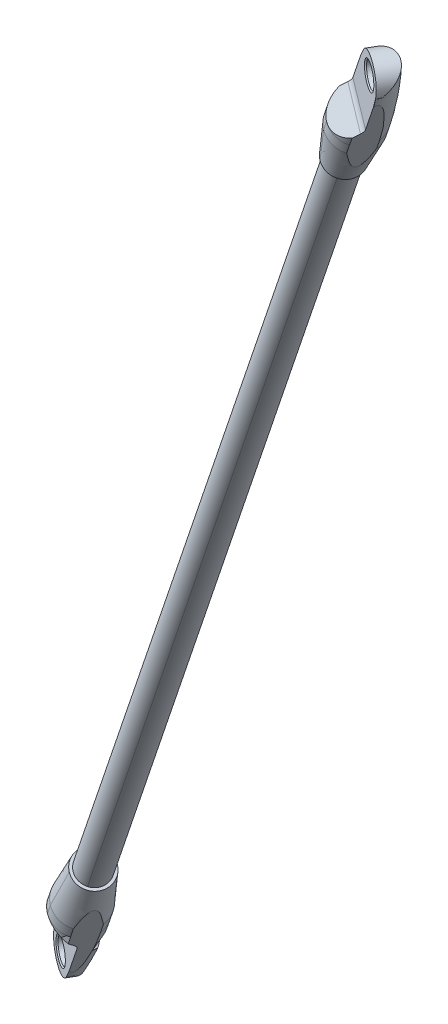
ISO-10303-21;
HEADER;
FILE_DESCRIPTION(('STEP AP214'),'2;1');
FILE_NAME('part.step','',(''),(''),'','','');
FILE_SCHEMA(('AUTOMOTIVE_DESIGN { 1 0 10303 214 1 1 1 1 }'));
ENDSEC;
DATA;
#1=APPLICATION_CONTEXT('core data for automotive mechanical design processes');
#2=APPLICATION_PROTOCOL_DEFINITION('international standard','automotive_design',2000,#1);
#3=PRODUCT_CONTEXT('',#1,'mechanical');
#4=PRODUCT('Part','Part','',(#3));
#5=PRODUCT_RELATED_PRODUCT_CATEGORY('part','',(#4));
#6=PRODUCT_DEFINITION_FORMATION('','',#4);
#7=PRODUCT_DEFINITION_CONTEXT('part definition',#1,'design');
#8=PRODUCT_DEFINITION('design','',#6,#7);
#9=PRODUCT_DEFINITION_SHAPE('','',#8);
#10=(LENGTH_UNIT() NAMED_UNIT(*) SI_UNIT(.MILLI.,.METRE.));
#11=(NAMED_UNIT(*) PLANE_ANGLE_UNIT() SI_UNIT($,.RADIAN.));
#12=(NAMED_UNIT(*) SI_UNIT($,.STERADIAN.) SOLID_ANGLE_UNIT());
#13=UNCERTAINTY_MEASURE_WITH_UNIT(LENGTH_MEASURE(1.E-05),#10,'distance_accuracy_value','');
#14=(GEOMETRIC_REPRESENTATION_CONTEXT(3) GLOBAL_UNCERTAINTY_ASSIGNED_CONTEXT((#13)) GLOBAL_UNIT_ASSIGNED_CONTEXT((#10,
#11,#12)) REPRESENTATION_CONTEXT('',''));
#15=CARTESIAN_POINT('',(0.,0.,0.));
#16=DIRECTION('',(0.,0.,1.));
#17=DIRECTION('',(1.,0.,0.));
#18=AXIS2_PLACEMENT_3D('',#15,#16,#17);
#19=CARTESIAN_POINT('',(120.706310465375,-741.350171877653,7.9120407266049));
#20=DIRECTION('',(0.462558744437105,0.8454115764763,0.267055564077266));
#21=DIRECTION('',(0.499998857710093,-2.08774867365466E-06,-0.866026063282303));
#22=AXIS2_PLACEMENT_3D('',#19,#20,#21);
#23=CYLINDRICAL_SURFACE('',#22,12.5);
#24=DIRECTION('',(0.462558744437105,0.8454115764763,0.267055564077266));
#25=VECTOR('',#24,1.);
#26=CARTESIAN_POINT('',(125.791358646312,-747.225428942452,17.7035492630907));
#27=LINE('',#26,#25);
#28=CARTESIAN_POINT('',(111.452037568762,-773.433187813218,9.42482677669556));
#29=VERTEX_POINT('',#28);
#30=CARTESIAN_POINT('',(107.751567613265,-780.196480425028,7.28838226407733));
#31=VERTEX_POINT('',#30);
#32=EDGE_CURVE('E651',#29,#31,#27,.F.);
#33=ORIENTED_EDGE('',*,*,#32,.F.);
#34=CARTESIAN_POINT('',(106.366989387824,-767.557930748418,-0.366681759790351));
#35=DIRECTION('',(0.462558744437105,0.8454115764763,0.267055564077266));
#36=DIRECTION('',(0.499998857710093,-2.08774867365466E-06,-0.866026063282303));
#37=AXIS2_PLACEMENT_3D('',#34,#35,#36);
#38=CIRCLE('',#37,12.5);
#39=CARTESIAN_POINT('',(100.117003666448,-767.55790465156,10.4586440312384));
#40=VERTEX_POINT('',#39);
#41=EDGE_CURVE('E648',#40,#29,#38,.T.);
#42=ORIENTED_EDGE('',*,*,#41,.F.);
#43=DIRECTION('',(0.462558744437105,0.8454115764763,0.267055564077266));
#44=VECTOR('',#43,1.);
#45=CARTESIAN_POINT('',(114.456324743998,-741.350145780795,18.7373665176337));
#46=LINE('',#45,#44);
#47=CARTESIAN_POINT('',(96.4165337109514,-774.321197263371,8.32219951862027));
#48=VERTEX_POINT('',#47);
#49=EDGE_CURVE('E449',#48,#40,#46,.T.);
#50=ORIENTED_EDGE('',*,*,#49,.F.);
#51=CARTESIAN_POINT('',(102.666519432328,-774.321223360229,-2.50312627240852));
#52=DIRECTION('',(0.462558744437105,0.8454115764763,0.267055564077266));
#53=DIRECTION('',(0.499998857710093,-2.08774867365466E-06,-0.866026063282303));
#54=AXIS2_PLACEMENT_3D('',#51,#52,#53);
#55=CIRCLE('',#54,12.5);
#56=EDGE_CURVE('E272',#48,#31,#55,.T.);
#57=ORIENTED_EDGE('',*,*,#56,.T.);
#58=EDGE_LOOP('',(#33,#42,#50,#57));
#59=FACE_BOUND('',#58,.T.);
#60=ADVANCED_FACE('F16',(#59),#23,.T.);
#61=CARTESIAN_POINT('',(458.329480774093,-124.281442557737,202.836787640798));
#62=DIRECTION('',(-0.462558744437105,-0.8454115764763,-0.267055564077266));
#63=DIRECTION('',(-0.499998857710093,2.08774867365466E-06,0.866026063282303));
#64=AXIS2_PLACEMENT_3D('',#61,#62,#63);
#65=DEGENERATE_TOROIDAL_SURFACE('',#64,422.5,435.,.F.);
#66=CARTESIAN_POINT('',(468.930722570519,-130.924290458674,202.104069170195));
#67=CARTESIAN_POINT('',(469.413730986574,-130.045631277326,202.377715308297));
#68=CARTESIAN_POINT('',(469.89288289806,-129.166940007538,202.658081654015));
#69=CARTESIAN_POINT('',(470.843237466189,-127.409666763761,203.232444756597));
#70=CARTESIAN_POINT('',(471.314439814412,-126.531084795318,203.526442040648));
#71=CARTESIAN_POINT('',(472.24927373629,-124.773045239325,204.128655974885));
#72=CARTESIAN_POINT('',(472.712893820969,-123.893588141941,204.436891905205));
#73=CARTESIAN_POINT('',(473.631405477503,-122.135279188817,205.067717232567));
#74=CARTESIAN_POINT('',(474.086297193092,-121.256427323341,205.390306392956));
#75=CARTESIAN_POINT('',(474.988752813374,-119.495521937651,206.052222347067));
#76=CARTESIAN_POINT('',(475.436272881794,-118.613472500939,206.391619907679));
#77=CARTESIAN_POINT('',(476.320737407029,-116.850663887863,207.087102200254));
#78=CARTESIAN_POINT('',(476.757682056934,-115.969904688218,207.443186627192));
#79=CARTESIAN_POINT('',(477.619207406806,-114.210655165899,208.173903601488));
#80=CARTESIAN_POINT('',(478.043794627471,-113.332163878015,208.54852607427));
#81=CARTESIAN_POINT('',(478.669637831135,-112.016497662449,209.12696103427));
#82=CARTESIAN_POINT('',(478.876404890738,-111.578304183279,209.322515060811));
#83=CARTESIAN_POINT('',(479.285789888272,-110.702758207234,209.719746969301));
#84=CARTESIAN_POINT('',(479.488407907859,-110.265405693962,209.921424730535));
#85=CARTESIAN_POINT('',(479.835823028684,-109.507506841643,210.277337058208));
#86=CARTESIAN_POINT('',(479.981715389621,-109.186716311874,210.429983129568));
#87=CARTESIAN_POINT('',(480.270605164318,-108.545818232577,210.739426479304));
#88=CARTESIAN_POINT('',(480.413602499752,-108.225710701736,210.896223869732));
#89=CARTESIAN_POINT('',(480.696234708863,-107.586454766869,211.214430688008));
#90=CARTESIAN_POINT('',(480.835870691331,-107.26730607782,211.375838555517));
#91=CARTESIAN_POINT('',(481.111270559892,-106.630096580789,211.703986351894));
#92=CARTESIAN_POINT('',(481.247034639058,-106.312035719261,211.87072601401));
#93=CARTESIAN_POINT('',(481.514115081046,-105.67688692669,212.210679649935));
#94=CARTESIAN_POINT('',(481.645425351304,-105.35980082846,212.383901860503));
#95=CARTESIAN_POINT('',(481.902353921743,-104.727434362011,212.737923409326));
#96=CARTESIAN_POINT('',(482.02797102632,-104.412154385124,212.918724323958));
#97=CARTESIAN_POINT('',(482.271991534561,-103.783827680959,213.289998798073));
#98=CARTESIAN_POINT('',(482.390384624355,-103.470784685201,213.480485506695));
#99=CARTESIAN_POINT('',(482.617079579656,-102.848852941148,213.873688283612));
#100=CARTESIAN_POINT('',(482.725386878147,-102.539962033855,214.076397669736));
#101=CARTESIAN_POINT('',(482.876734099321,-102.081170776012,214.393968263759));
#102=CARTESIAN_POINT('',(482.925429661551,-101.928653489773,214.502340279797));
#103=CARTESIAN_POINT('',(483.017899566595,-101.625978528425,214.724626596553));
#104=CARTESIAN_POINT('',(483.061670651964,-101.47582247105,214.838544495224));
#105=CARTESIAN_POINT('',(483.142475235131,-101.179412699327,215.073119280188));
#106=CARTESIAN_POINT('',(483.179520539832,-101.033152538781,215.193763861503));
#107=CARTESIAN_POINT('',(483.244115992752,-100.746490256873,215.444097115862));
#108=CARTESIAN_POINT('',(483.271680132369,-100.606079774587,215.573772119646));
#109=CARTESIAN_POINT('',(483.306714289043,-100.370738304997,215.810459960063));
#110=CARTESIAN_POINT('',(483.317543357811,-100.273464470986,215.914615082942));
#111=CARTESIAN_POINT('',(483.326901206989,-100.088761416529,216.131790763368));
#112=CARTESIAN_POINT('',(483.325480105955,-100.001293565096,216.244773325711));
#113=CARTESIAN_POINT('',(483.308773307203,-99.8857890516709,216.419657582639));
#114=CARTESIAN_POINT('',(483.301107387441,-99.8505529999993,216.477458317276));
#115=CARTESIAN_POINT('',(483.279975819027,-99.7861571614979,216.595427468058));
#116=CARTESIAN_POINT('',(483.266513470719,-99.7569939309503,216.655594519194));
#117=CARTESIAN_POINT('',(483.235038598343,-99.710866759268,216.768395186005));
#118=CARTESIAN_POINT('',(483.218007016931,-99.6927309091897,216.820810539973));
#119=CARTESIAN_POINT('',(483.178249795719,-99.6642956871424,216.925601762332));
#120=CARTESIAN_POINT('',(483.155533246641,-99.6539839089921,216.977977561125));
#121=CARTESIAN_POINT('',(483.104286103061,-99.642411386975,217.081362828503));
#122=CARTESIAN_POINT('',(483.075716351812,-99.6412137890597,217.132360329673));
#123=CARTESIAN_POINT('',(483.01383125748,-99.6482107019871,217.230707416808));
#124=CARTESIAN_POINT('',(482.980512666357,-99.6564116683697,217.278054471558));
#125=CARTESIAN_POINT('',(482.906243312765,-99.6826763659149,217.373505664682));
#126=CARTESIAN_POINT('',(482.864859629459,-99.7018501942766,217.420956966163));
#127=CARTESIAN_POINT('',(482.779871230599,-99.7483417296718,217.509416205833));
#128=CARTESIAN_POINT('',(482.736262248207,-99.775675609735,217.55041109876));
#129=CARTESIAN_POINT('',(482.618761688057,-99.8563954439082,217.651933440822));
#130=CARTESIAN_POINT('',(482.54405383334,-99.9150046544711,217.707274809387));
#131=CARTESIAN_POINT('',(482.394769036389,-100.041677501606,217.805784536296));
#132=CARTESIAN_POINT('',(482.32019311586,-100.109768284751,217.848916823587));
#133=CARTESIAN_POINT('',(482.1356884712,-100.286492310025,217.94518629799));
#134=CARTESIAN_POINT('',(482.026344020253,-100.398641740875,217.992868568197));
#135=CARTESIAN_POINT('',(481.810067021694,-100.629983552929,218.075156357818));
#136=CARTESIAN_POINT('',(481.703140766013,-100.749191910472,218.109730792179));
#137=CARTESIAN_POINT('',(481.490943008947,-100.992634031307,218.169663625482));
#138=CARTESIAN_POINT('',(481.385685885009,-101.116894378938,218.194963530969));
#139=CARTESIAN_POINT('',(481.17733299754,-101.368132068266,218.238386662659));
#140=CARTESIAN_POINT('',(481.07423482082,-101.495106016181,218.256518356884));
#141=CARTESIAN_POINT('',(480.750603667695,-101.900187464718,218.305218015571));
#142=CARTESIAN_POINT('',(480.533212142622,-102.182003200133,218.325659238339));
#143=CARTESIAN_POINT('',(480.104260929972,-102.750815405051,218.349894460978));
#144=CARTESIAN_POINT('',(479.892705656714,-103.037815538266,218.353676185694));
#145=CARTESIAN_POINT('',(479.473700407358,-103.6157802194,218.349119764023));
#146=CARTESIAN_POINT('',(479.266262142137,-103.906752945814,218.340750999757));
#147=CARTESIAN_POINT('',(478.855224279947,-104.490811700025,218.314694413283));
#148=CARTESIAN_POINT('',(478.651623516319,-104.783897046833,218.297009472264));
#149=CARTESIAN_POINT('',(478.247022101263,-105.372475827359,218.2540932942));
#150=CARTESIAN_POINT('',(478.04603005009,-105.667973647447,218.228841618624));
#151=CARTESIAN_POINT('',(477.646747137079,-106.260212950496,218.172088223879));
#152=CARTESIAN_POINT('',(477.448456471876,-106.556954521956,218.140586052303));
#153=CARTESIAN_POINT('',(477.054551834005,-107.150941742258,218.07230860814));
#154=CARTESIAN_POINT('',(476.858934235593,-107.448185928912,218.035541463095));
#155=CARTESIAN_POINT('',(476.469812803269,-108.043435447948,217.957384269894));
#156=CARTESIAN_POINT('',(476.276308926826,-108.341440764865,217.915994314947));
#157=CARTESIAN_POINT('',(475.781170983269,-109.108546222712,217.804312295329));
#158=CARTESIAN_POINT('',(475.480930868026,-109.578110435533,217.731019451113));
#159=CARTESIAN_POINT('',(474.884534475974,-110.518422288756,217.575865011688));
#160=CARTESIAN_POINT('',(474.588378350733,-110.989169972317,217.494003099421));
#161=CARTESIAN_POINT('',(473.705282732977,-112.402902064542,217.237229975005));
#162=CARTESIAN_POINT('',(473.123785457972,-113.347267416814,217.051147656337));
#163=CARTESIAN_POINT('',(471.972164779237,-115.239677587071,216.654633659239));
#164=CARTESIAN_POINT('',(471.402059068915,-116.187725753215,216.444167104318));
#165=CARTESIAN_POINT('',(470.272736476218,-118.085353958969,216.002438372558));
#166=CARTESIAN_POINT('',(469.713518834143,-119.034933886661,215.771177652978));
#167=CARTESIAN_POINT('',(468.62752460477,-120.896678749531,215.299742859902));
#168=CARTESIAN_POINT('',(468.100351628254,-121.808800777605,215.0603095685));
#169=CARTESIAN_POINT('',(467.054727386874,-123.63373383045,214.565465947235));
#170=CARTESIAN_POINT('',(466.53627632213,-124.546544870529,214.310055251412));
#171=CARTESIAN_POINT('',(465.50922709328,-126.370122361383,213.784751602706));
#172=CARTESIAN_POINT('',(465.000606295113,-127.280887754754,213.514899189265));
#173=CARTESIAN_POINT('',(463.991784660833,-129.102535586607,212.960462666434));
#174=CARTESIAN_POINT('',(463.491583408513,-130.013418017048,212.675879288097));
#175=CARTESIAN_POINT('',(462.995560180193,-130.924265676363,212.384103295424));
#176=B_SPLINE_CURVE_WITH_KNOTS('',3,(#66,#67,#68,#69,#70,#71,#72,#73,#74,#75,#76,#77,#78,#79,
#80,#81,#82,#83,#84,#85,#86,#87,#88,#89,#90,#91,#92,#93,#94,#95,#96,#97,#98,#99,#100,#101,#102,
#103,#104,#105,#106,#107,#108,#109,#110,#111,#112,#113,#114,#115,#116,#117,#118,#119,#120,#121,
#122,#123,#124,#125,#126,#127,#128,#129,#130,#131,#132,#133,#134,#135,#136,#137,#138,#139,#140,
#141,#142,#143,#144,#145,#146,#147,#148,#149,#150,#151,#152,#153,#154,#155,#156,#157,#158,#159,
#160,#161,#162,#163,#164,#165,#166,#167,#168,#169,#170,#171,#172,#173,#174,#175),.UNSPECIFIED.,
.F.,.F.,(4,2,2,2,2,2,2,2,2,2,2,2,2,2,2,2,2,2,2,2,2,2,2,2,2,2,2,2,2,2,2,2,2,2,2,2,2,2,2,2,2,2,2,
2,2,2,2,2,2,2,2,2,2,2,4),(0.,3.11798800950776,6.23609671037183,9.35855895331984,
12.4809697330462,15.6178797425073,18.7547324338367,21.8898987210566,23.4573613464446,
25.0247930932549,26.1769049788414,27.3290479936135,28.4808055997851,29.6325056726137,
30.7857224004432,31.9391802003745,33.0942480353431,34.2486900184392,34.8285759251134,
35.4088431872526,35.9880817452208,36.5664618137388,36.9946719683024,37.4211310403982,
37.6251109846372,37.8289749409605,38.0023658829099,38.1754813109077,38.3497950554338,
38.5242286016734,38.7205868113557,38.9173368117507,39.245185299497,39.573992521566,
40.0639280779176,40.5550183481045,41.0491546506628,41.5427054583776,42.6113457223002,
43.6807732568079,44.7529003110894,45.8246959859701,46.8994131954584,47.9742082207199,
49.0473616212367,50.1204933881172,51.8068214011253,53.4932118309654,56.8663810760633,
60.2444359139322,63.6222542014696,66.8632139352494,70.1042479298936,73.3366179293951,
76.5688276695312),.UNSPECIFIED.);
#177=CARTESIAN_POINT('',(469.351686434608,-130.156724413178,202.34480644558));
#178=VERTEX_POINT('',#177);
#179=CARTESIAN_POINT('',(481.752981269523,-100.69466445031,218.092303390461));
#180=VERTEX_POINT('',#179);
#181=EDGE_CURVE('E1540',#178,#180,#176,.T.);
#182=ORIENTED_EDGE('',*,*,#181,.F.);
#183=CARTESIAN_POINT('',(458.329480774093,-124.281442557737,202.836787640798));
#184=DIRECTION('',(-0.462558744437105,-0.8454115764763,-0.267055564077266));
#185=DIRECTION('',(0.499998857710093,-2.08774867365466E-06,-0.866026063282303));
#186=AXIS2_PLACEMENT_3D('',#183,#184,#185);
#187=CIRCLE('',#186,12.5);
#188=CARTESIAN_POINT('',(464.579466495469,-124.281468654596,192.011461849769));
#189=VERTEX_POINT('',#188);
#190=EDGE_CURVE('E956',#189,#178,#187,.T.);
#191=ORIENTED_EDGE('',*,*,#190,.F.);
#192=CARTESIAN_POINT('',(247.079963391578,-124.280560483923,568.732799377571));
#193=DIRECTION('',(-0.732147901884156,0.534115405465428,-0.422705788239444));
#194=DIRECTION('',(-0.499998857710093,2.08774867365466E-06,0.866026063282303));
#195=AXIS2_PLACEMENT_3D('',#192,#193,#194);
#196=CIRCLE('',#195,435.);
#197=CARTESIAN_POINT('',(486.669965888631,-81.1654719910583,208.229373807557));
#198=VERTEX_POINT('',#197);
#199=EDGE_CURVE('E431',#198,#189,#196,.T.);
#200=ORIENTED_EDGE('',*,*,#199,.F.);
#201=CARTESIAN_POINT('',(485.918294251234,-94.7049800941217,217.033494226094));
#202=CARTESIAN_POINT('',(485.928886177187,-94.6807093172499,217.039611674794));
#203=CARTESIAN_POINT('',(485.9397744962,-94.6563941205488,217.045021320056));
#204=CARTESIAN_POINT('',(485.96225883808,-94.6073515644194,217.054551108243));
#205=CARTESIAN_POINT('',(485.973863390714,-94.5826238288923,217.058649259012));
#206=CARTESIAN_POINT('',(485.997772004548,-94.5327552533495,217.065552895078));
#207=CARTESIAN_POINT('',(486.010085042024,-94.5076152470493,217.068333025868));
#208=CARTESIAN_POINT('',(486.035403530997,-94.4569174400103,217.072600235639));
#209=CARTESIAN_POINT('',(486.048418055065,-94.4313618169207,217.074059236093));
#210=CARTESIAN_POINT('',(486.070028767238,-94.3896738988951,217.075372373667));
#211=CARTESIAN_POINT('',(486.078511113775,-94.3734934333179,217.075617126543));
#212=CARTESIAN_POINT('',(486.095742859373,-94.3409680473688,217.075595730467));
#213=CARTESIAN_POINT('',(486.104494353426,-94.3246242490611,217.075321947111));
#214=CARTESIAN_POINT('',(486.131357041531,-94.274954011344,217.073722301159));
#215=CARTESIAN_POINT('',(486.149675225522,-94.241761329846,217.071595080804));
#216=CARTESIAN_POINT('',(486.177644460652,-94.1919899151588,217.066926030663));
#217=CARTESIAN_POINT('',(486.18713837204,-94.1752499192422,217.065099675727));
#218=CARTESIAN_POINT('',(486.206484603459,-94.1414240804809,217.060919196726));
#219=CARTESIAN_POINT('',(486.216339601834,-94.1243413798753,217.058551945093));
#220=CARTESIAN_POINT('',(486.243333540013,-94.0779053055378,217.051471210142));
#221=CARTESIAN_POINT('',(486.260554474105,-94.0486683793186,217.046303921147));
#222=CARTESIAN_POINT('',(486.295954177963,-93.9892165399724,217.034508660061));
#223=CARTESIAN_POINT('',(486.314140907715,-93.9590175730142,217.027824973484));
#224=CARTESIAN_POINT('',(486.351452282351,-93.8976308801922,217.012985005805));
#225=CARTESIAN_POINT('',(486.370582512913,-93.8664592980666,217.00477625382));
#226=CARTESIAN_POINT('',(486.409765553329,-93.8031280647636,216.986855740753));
#227=CARTESIAN_POINT('',(486.429822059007,-93.7709849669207,216.977093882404));
#228=CARTESIAN_POINT('',(486.470406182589,-93.7063275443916,216.956318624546));
#229=CARTESIAN_POINT('',(486.490934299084,-93.6738210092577,216.945282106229));
#230=CARTESIAN_POINT('',(486.53278691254,-93.6078084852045,216.921843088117));
#231=CARTESIAN_POINT('',(486.55411018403,-93.5743149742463,216.909403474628));
#232=CARTESIAN_POINT('',(486.628351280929,-93.4580732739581,216.864491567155));
#233=CARTESIAN_POINT('',(486.681121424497,-93.3761106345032,216.829725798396));
#234=CARTESIAN_POINT('',(486.795548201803,-93.1989780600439,216.749166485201));
#235=CARTESIAN_POINT('',(486.857074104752,-93.1041195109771,216.702517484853));
#236=CARTESIAN_POINT('',(486.949221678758,-92.9608726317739,216.629012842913));
#237=CARTESIAN_POINT('',(486.980419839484,-92.9121637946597,216.603476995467));
#238=CARTESIAN_POINT('',(487.034157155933,-92.8278743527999,216.55840109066));
#239=CARTESIAN_POINT('',(487.056794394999,-92.7922444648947,216.539070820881));
#240=CARTESIAN_POINT('',(487.12983283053,-92.6768398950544,216.475641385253));
#241=CARTESIAN_POINT('',(487.179756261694,-92.5972629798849,216.4306310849));
#242=CARTESIAN_POINT('',(487.285407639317,-92.4267864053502,216.332213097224));
#243=CARTESIAN_POINT('',(487.340928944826,-92.3359162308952,216.278533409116));
#244=CARTESIAN_POINT('',(487.441020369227,-92.1693898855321,216.178371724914));
#245=CARTESIAN_POINT('',(487.485871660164,-92.0937257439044,216.132183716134));
#246=CARTESIAN_POINT('',(487.536165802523,-92.0076945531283,216.078907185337));
#247=CARTESIAN_POINT('',(487.542233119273,-91.997296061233,216.072455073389));
#248=CARTESIAN_POINT('',(487.583289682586,-91.9267973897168,216.028624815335));
#249=CARTESIAN_POINT('',(487.617892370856,-91.8667204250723,215.990845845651));
#250=CARTESIAN_POINT('',(487.703034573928,-91.7167822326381,215.895956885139));
#251=CARTESIAN_POINT('',(487.753025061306,-91.6268320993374,215.838494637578));
#252=CARTESIAN_POINT('',(487.867175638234,-91.4169182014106,215.703128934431));
#253=CARTESIAN_POINT('',(487.930565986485,-91.2968482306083,215.624739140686));
#254=CARTESIAN_POINT('',(488.041972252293,-91.0790531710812,215.481063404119));
#255=CARTESIAN_POINT('',(488.090618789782,-90.9814227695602,215.416121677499));
#256=CARTESIAN_POINT('',(488.18073667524,-90.7953472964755,215.29155467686));
#257=CARTESIAN_POINT('',(488.222442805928,-90.7069446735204,215.232035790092));
#258=CARTESIAN_POINT('',(488.307701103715,-90.5212569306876,215.106324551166));
#259=CARTESIAN_POINT('',(488.351043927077,-90.4239367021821,215.040041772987));
#260=CARTESIAN_POINT('',(488.423407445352,-90.2559981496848,214.925151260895));
#261=CARTESIAN_POINT('',(488.453053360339,-90.1854965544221,214.876765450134));
#262=CARTESIAN_POINT('',(488.518952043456,-90.024783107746,214.766114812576));
#263=CARTESIAN_POINT('',(488.5547729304,-89.9344959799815,214.703701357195));
#264=CARTESIAN_POINT('',(488.622317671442,-89.7582004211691,214.5813991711));
#265=CARTESIAN_POINT('',(488.654157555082,-89.6722115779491,214.521546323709));
#266=CARTESIAN_POINT('',(488.699678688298,-89.5447149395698,214.432558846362));
#267=CARTESIAN_POINT('',(488.714187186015,-89.5033456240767,214.403647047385));
#268=CARTESIAN_POINT('',(488.745085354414,-89.4135979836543,214.340852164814));
#269=CARTESIAN_POINT('',(488.761383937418,-89.3652043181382,214.306946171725));
#270=CARTESIAN_POINT('',(488.808664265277,-89.2216117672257,214.206200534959));
#271=CARTESIAN_POINT('',(488.838657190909,-89.1262568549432,214.139116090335));
#272=CARTESIAN_POINT('',(488.895197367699,-88.9375049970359,214.005971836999));
#273=CARTESIAN_POINT('',(488.921810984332,-88.844117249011,213.939927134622));
#274=CARTESIAN_POINT('',(488.971720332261,-88.6593529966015,213.808935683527));
#275=CARTESIAN_POINT('',(488.995082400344,-88.5679846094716,213.744002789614));
#276=CARTESIAN_POINT('',(489.038613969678,-88.3873058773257,213.615309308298));
#277=CARTESIAN_POINT('',(489.058849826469,-88.2980026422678,213.551561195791));
#278=CARTESIAN_POINT('',(489.096253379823,-88.121494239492,213.425309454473));
#279=CARTESIAN_POINT('',(489.113487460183,-88.0342952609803,213.36281686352));
#280=CARTESIAN_POINT('',(489.145007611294,-87.862026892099,213.239150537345));
#281=CARTESIAN_POINT('',(489.159360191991,-87.7769629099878,213.177986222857));
#282=CARTESIAN_POINT('',(489.187282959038,-87.5957605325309,213.047507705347));
#283=CARTESIAN_POINT('',(489.200517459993,-87.4995992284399,212.978153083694));
#284=CARTESIAN_POINT('',(489.223550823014,-87.3089168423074,212.840386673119));
#285=CARTESIAN_POINT('',(489.233408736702,-87.2143983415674,212.771981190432));
#286=CARTESIAN_POINT('',(489.249773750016,-87.0270534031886,212.636166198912));
#287=CARTESIAN_POINT('',(489.256339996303,-86.9342283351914,212.568761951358));
#288=CARTESIAN_POINT('',(489.266208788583,-86.7503202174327,212.434999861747));
#289=CARTESIAN_POINT('',(489.26957049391,-86.6592372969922,212.368646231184));
#290=CARTESIAN_POINT('',(489.273116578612,-86.4788585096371,212.237036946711));
#291=CARTESIAN_POINT('',(489.273360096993,-86.3895615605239,212.171784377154));
#292=CARTESIAN_POINT('',(489.270756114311,-86.2127932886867,212.042426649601));
#293=CARTESIAN_POINT('',(489.267967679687,-86.1253197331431,211.978323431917));
#294=CARTESIAN_POINT('',(489.261499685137,-85.9948787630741,211.882607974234));
#295=CARTESIAN_POINT('',(489.2589895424,-85.9518418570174,211.85100793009));
#296=CARTESIAN_POINT('',(489.252869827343,-85.8607824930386,211.784105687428));
#297=CARTESIAN_POINT('',(489.249165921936,-85.8127664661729,211.748803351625));
#298=CARTESIAN_POINT('',(489.236712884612,-85.6700056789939,211.643766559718));
#299=CARTESIAN_POINT('',(489.226566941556,-85.5753727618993,211.574039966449));
#300=CARTESIAN_POINT('',(489.202611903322,-85.388050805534,211.43581338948));
#301=CARTESIAN_POINT('',(489.18886458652,-85.2953550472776,211.367311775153));
#302=CARTESIAN_POINT('',(489.157788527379,-85.1119623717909,211.231581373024));
#303=CARTESIAN_POINT('',(489.14052073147,-85.0212572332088,211.164349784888));
#304=CARTESIAN_POINT('',(489.102486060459,-84.8418992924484,211.031208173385));
#305=CARTESIAN_POINT('',(489.08177914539,-84.7532367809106,210.965294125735));
#306=CARTESIAN_POINT('',(489.036948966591,-84.5780125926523,210.834835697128));
#307=CARTESIAN_POINT('',(489.012884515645,-84.4914397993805,210.770286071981));
#308=CARTESIAN_POINT('',(488.961422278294,-84.3204401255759,210.642605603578));
#309=CARTESIAN_POINT('',(488.934081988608,-84.2360007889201,210.579468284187));
#310=CARTESIAN_POINT('',(488.873340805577,-84.0612202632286,210.448603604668));
#311=CARTESIAN_POINT('',(488.839628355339,-83.970955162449,210.38091879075));
#312=CARTESIAN_POINT('',(488.768277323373,-83.7928000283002,210.247117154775));
#313=CARTESIAN_POINT('',(488.73069459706,-83.7048943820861,210.180991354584));
#314=CARTESIAN_POINT('',(488.651688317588,-83.5315228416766,210.050356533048));
#315=CARTESIAN_POINT('',(488.610317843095,-83.4460402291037,209.985837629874));
#316=CARTESIAN_POINT('',(488.523822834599,-83.2775759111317,209.858465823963));
#317=CARTESIAN_POINT('',(488.478748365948,-83.1945765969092,209.79560224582));
#318=CARTESIAN_POINT('',(488.384933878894,-83.0311367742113,209.671591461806));
#319=CARTESIAN_POINT('',(488.336240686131,-82.9506780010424,209.610432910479));
#320=CARTESIAN_POINT('',(488.235275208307,-82.7923691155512,209.48987971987));
#321=CARTESIAN_POINT('',(488.183046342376,-82.7145003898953,209.430473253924));
#322=CARTESIAN_POINT('',(488.101891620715,-82.5994143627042,209.342513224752));
#323=CARTESIAN_POINT('',(488.074480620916,-82.5614791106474,209.313492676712));
#324=CARTESIAN_POINT('',(488.017390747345,-82.4843688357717,209.254449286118));
#325=CARTESIAN_POINT('',(487.987665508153,-82.4452166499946,209.224441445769));
#326=CARTESIAN_POINT('',(487.897182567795,-82.3289913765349,209.135271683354));
#327=CARTESIAN_POINT('',(487.834828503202,-82.2527383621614,209.076649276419));
#328=CARTESIAN_POINT('',(487.706305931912,-82.1030785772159,208.961339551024));
#329=CARTESIAN_POINT('',(487.640162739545,-82.0296573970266,208.904642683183));
#330=CARTESIAN_POINT('',(487.50414914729,-81.8857233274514,208.793229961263));
#331=CARTESIAN_POINT('',(487.434299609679,-81.8151974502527,208.738505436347));
#332=CARTESIAN_POINT('',(487.290965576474,-81.6771163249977,208.63108720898));
#333=CARTESIAN_POINT('',(487.217497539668,-81.6095498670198,208.578385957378));
#334=CARTESIAN_POINT('',(487.067017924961,-81.4774458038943,208.475064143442));
#335=CARTESIAN_POINT('',(486.990018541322,-81.4128991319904,208.424437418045));
#336=CARTESIAN_POINT('',(486.832573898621,-81.2868857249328,208.325313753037));
#337=CARTESIAN_POINT('',(486.752136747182,-81.2254124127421,208.276812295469));
#338=CARTESIAN_POINT('',(486.669965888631,-81.1654719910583,208.229373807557));
#339=B_SPLINE_CURVE_WITH_KNOTS('',3,(#201,#202,#203,#204,#205,#206,#207,#208,#209,#210,#211,
#212,#213,#214,#215,#216,#217,#218,#219,#220,#221,#222,#223,#224,#225,#226,#227,#228,#229,#230,
#231,#232,#233,#234,#235,#236,#237,#238,#239,#240,#241,#242,#243,#244,#245,#246,#247,#248,#249,
#250,#251,#252,#253,#254,#255,#256,#257,#258,#259,#260,#261,#262,#263,#264,#265,#266,#267,#268,
#269,#270,#271,#272,#273,#274,#275,#276,#277,#278,#279,#280,#281,#282,#283,#284,#285,#286,#287,
#288,#289,#290,#291,#292,#293,#294,#295,#296,#297,#298,#299,#300,#301,#302,#303,#304,#305,#306,
#307,#308,#309,#310,#311,#312,#313,#314,#315,#316,#317,#318,#319,#320,#321,#322,#323,#324,#325,
#326,#327,#328,#329,#330,#331,#332,#333,#334,#335,#336,#337,#338),.UNSPECIFIED.,.F.,.F.,(4,2,2,
2,2,2,2,2,2,2,2,2,2,2,2,2,2,2,2,2,2,2,2,2,2,2,2,2,2,2,2,2,2,2,2,2,2,2,2,2,2,2,2,2,2,2,2,2,2,2,2,
2,2,2,2,2,2,2,2,2,2,2,2,2,2,2,2,2,4),(0.,0.0815194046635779,0.164341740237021,0.248698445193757,
0.334808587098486,0.389613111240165,0.445230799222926,0.559074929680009,0.617063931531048,
0.676646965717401,0.779587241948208,0.887206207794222,0.999635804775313,1.11699174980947,
1.23697393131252,1.36178861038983,1.67212198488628,2.0389394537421,2.22862346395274,
2.36790523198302,2.68037635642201,3.03810731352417,3.33613291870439,3.3771101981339,
3.6139657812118,3.96753556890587,4.43781617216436,4.81862869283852,5.16193235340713,
5.53831542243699,5.80980971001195,6.15615469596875,6.48463008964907,6.64217237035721,
6.82605691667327,7.1871751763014,7.53945522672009,7.88292416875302,8.21761124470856,
8.54354806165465,8.86076884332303,9.21862136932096,9.56985097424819,9.91452039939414,
10.2526960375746,10.5844481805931,10.9098512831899,11.0702004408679,11.2493296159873,
11.603213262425,11.9513841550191,12.293973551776,12.6311192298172,12.9629657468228,
13.2896646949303,13.6428317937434,13.9914726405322,14.3358141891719,14.6760919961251,
15.0125501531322,15.3454411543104,15.5106390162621,15.6834061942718,16.0271636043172,
16.3688446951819,16.7087728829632,17.047276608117,17.3846884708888,17.7213443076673),.UNSPECIFIED.);
#340=CARTESIAN_POINT('',(485.918294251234,-94.7049800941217,217.033494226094));
#341=VERTEX_POINT('',#340);
#342=EDGE_CURVE('E323',#341,#198,#339,.T.);
#343=ORIENTED_EDGE('',*,*,#342,.F.);
#344=CARTESIAN_POINT('',(477.552053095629,-89.1486397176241,213.934826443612));
#345=DIRECTION('',(0.462558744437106,0.845411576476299,0.267055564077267));
#346=DIRECTION('',(0.732147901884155,-0.534115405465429,0.422705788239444));
#347=AXIS2_PLACEMENT_3D('',#344,#345,#346);
#348=CIRCLE('',#347,10.5104068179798);
#349=CARTESIAN_POINT('',(484.41870211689,-94.7049738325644,219.63087190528));
#350=VERTEX_POINT('',#349);
#351=EDGE_CURVE('E733',#350,#341,#348,.T.);
#352=ORIENTED_EDGE('',*,*,#351,.F.);
#353=CARTESIAN_POINT('',(484.432200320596,-94.6734496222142,219.639132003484));
#354=CARTESIAN_POINT('',(484.427774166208,-94.6839891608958,219.636264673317));
#355=CARTESIAN_POINT('',(484.423274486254,-94.6944971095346,219.63351172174));
#356=CARTESIAN_POINT('',(484.41870211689,-94.7049738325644,219.63087190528));
#357=(BOUNDED_CURVE() B_SPLINE_CURVE(3,(#353,#354,#355,#356),.UNSPECIFIED.,.F.,
.F.) B_SPLINE_CURVE_WITH_KNOTS((4,4),(7.68404953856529E-06,4.22971954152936E-05),
.UNSPECIFIED.) CURVE() GEOMETRIC_REPRESENTATION_ITEM() RATIONAL_B_SPLINE_CURVE((1.,1.,1.,1.)) REPRESENTATION_ITEM(''));
#358=CARTESIAN_POINT('',(484.432200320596,-94.6734496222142,219.639132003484));
#359=VERTEX_POINT('',#358);
#360=EDGE_CURVE('E306',#359,#350,#357,.T.);
#361=ORIENTED_EDGE('',*,*,#360,.F.);
#362=CARTESIAN_POINT('',(472.566458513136,-119.753514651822,212.788524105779));
#363=CARTESIAN_POINT('',(474.662837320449,-115.652051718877,213.998855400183));
#364=CARTESIAN_POINT('',(476.700279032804,-111.510866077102,215.175159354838));
#365=CARTESIAN_POINT('',(480.656822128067,-103.148735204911,217.45944345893));
#366=CARTESIAN_POINT('',(482.575673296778,-98.928215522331,218.567279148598));
#367=CARTESIAN_POINT('',(484.432200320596,-94.6734496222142,219.639132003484));
#368=(BOUNDED_CURVE() B_SPLINE_CURVE(3,(#362,#363,#364,#365,#366,#367),.UNSPECIFIED.,.F.,
.F.) B_SPLINE_CURVE_WITH_KNOTS((4,2,4),(0.313716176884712,0.328296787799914,0.342877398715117),
.UNSPECIFIED.) CURVE() GEOMETRIC_REPRESENTATION_ITEM() RATIONAL_B_SPLINE_CURVE((1.,1.,1.,1.,1.,1.)) REPRESENTATION_ITEM(''));
#369=EDGE_CURVE('E302',#180,#359,#368,.T.);
#370=ORIENTED_EDGE('',*,*,#369,.F.);
#371=EDGE_LOOP('',(#182,#191,#200,#343,#352,#361,#370));
#372=FACE_BOUND('',#371,.T.);
#373=ADVANCED_FACE('F712',(#372),#65,.F.);
#374=CARTESIAN_POINT('',(440.289689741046,-157.252494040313,192.421620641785));
#375=DIRECTION('',(-0.462558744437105,-0.8454115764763,-0.267055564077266));
#376=DIRECTION('',(0.499998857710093,-2.08774867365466E-06,-0.866026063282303));
#377=AXIS2_PLACEMENT_3D('',#374,#375,#376);
#378=CYLINDRICAL_SURFACE('',#377,12.5);
#379=DIRECTION('',(-0.462558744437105,-0.8454115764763,-0.267055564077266));
#380=VECTOR('',#379,1.);
#381=CARTESIAN_POINT('',(451.311895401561,-163.127775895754,191.929639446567));
#382=LINE('',#381,#380);
#383=CARTESIAN_POINT('',(465.65121647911,-136.920017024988,200.208361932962));
#384=VERTEX_POINT('',#383);
#385=EDGE_CURVE('E1543',#384,#178,#382,.F.);
#386=ORIENTED_EDGE('',*,*,#385,.F.);
#387=CARTESIAN_POINT('',(454.629010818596,-131.044735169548,200.70034312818));
#388=DIRECTION('',(-0.462558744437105,-0.8454115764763,-0.267055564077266));
#389=DIRECTION('',(0.499998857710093,-2.08774867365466E-06,-0.866026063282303));
#390=AXIS2_PLACEMENT_3D('',#387,#388,#389);
#391=CIRCLE('',#390,12.5);
#392=CARTESIAN_POINT('',(460.878996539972,-131.044761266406,189.875017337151));
#393=VERTEX_POINT('',#392);
#394=EDGE_CURVE('E899',#393,#384,#391,.T.);
#395=ORIENTED_EDGE('',*,*,#394,.F.);
#396=DIRECTION('',(-0.462558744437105,-0.8454115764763,-0.267055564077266));
#397=VECTOR('',#396,1.);
#398=CARTESIAN_POINT('',(446.539675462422,-157.252520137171,181.596294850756));
#399=LINE('',#398,#397);
#400=EDGE_CURVE('E818',#189,#393,#399,.T.);
#401=ORIENTED_EDGE('',*,*,#400,.F.);
#402=ORIENTED_EDGE('',*,*,#190,.T.);
#403=EDGE_LOOP('',(#386,#395,#401,#402));
#404=FACE_BOUND('',#403,.T.);
#405=ADVANCED_FACE('F867',(#404),#378,.T.);
#406=CARTESIAN_POINT('',(102.666519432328,-774.321223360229,-2.50312627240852));
#407=DIRECTION('',(0.462558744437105,0.8454115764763,0.267055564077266));
#408=DIRECTION('',(-0.499998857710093,2.08774867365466E-06,0.866026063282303));
#409=AXIS2_PLACEMENT_3D('',#406,#407,#408);
#410=DEGENERATE_TOROIDAL_SURFACE('',#409,422.5,435.,.F.);
#411=CARTESIAN_POINT('',(108.905855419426,-778.100413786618,7.93760944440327));
#412=CARTESIAN_POINT('',(108.435420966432,-778.949227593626,7.67989607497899));
#413=CARTESIAN_POINT('',(107.96858315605,-779.798116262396,7.41585854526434));
#414=CARTESIAN_POINT('',(107.042245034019,-781.495882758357,6.87508826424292));
#415=CARTESIAN_POINT('',(106.582744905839,-782.344760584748,6.59835519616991));
#416=CARTESIAN_POINT('',(105.669765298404,-784.045067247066,6.03123762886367));
#417=CARTESIAN_POINT('',(105.21631030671,-784.8964953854,5.74081159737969));
#418=CARTESIAN_POINT('',(104.317290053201,-786.598927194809,5.14683046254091));
#419=CARTESIAN_POINT('',(103.871724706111,-787.449930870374,4.84327550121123));
#420=CARTESIAN_POINT('',(102.960626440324,-789.205924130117,4.20253582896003));
#421=CARTESIAN_POINT('',(102.495648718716,-790.110871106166,3.86444332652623));
#422=CARTESIAN_POINT('',(101.576074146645,-791.919679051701,3.17165036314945));
#423=CARTESIAN_POINT('',(101.121477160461,-792.823540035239,2.81695011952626));
#424=CARTESIAN_POINT('',(100.225133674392,-794.627437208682,2.09012480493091));
#425=CARTESIAN_POINT('',(99.783357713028,-795.527477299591,1.71804583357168));
#426=CARTESIAN_POINT('',(98.9135297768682,-797.325250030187,0.953032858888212));
#427=CARTESIAN_POINT('',(98.4854762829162,-798.222982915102,0.560101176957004));
#428=CARTESIAN_POINT('',(97.8603524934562,-799.558221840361,-0.0443111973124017));
#429=CARTESIAN_POINT('',(97.6567730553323,-799.997041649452,-0.246177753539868));
#430=CARTESIAN_POINT('',(97.2543332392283,-800.873694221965,-0.656837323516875));
#431=CARTESIAN_POINT('',(97.0554734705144,-801.311526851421,-0.865631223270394));
#432=CARTESIAN_POINT('',(96.6622932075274,-802.188151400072,-1.2922933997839));
#433=CARTESIAN_POINT('',(96.4680023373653,-802.626936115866,-1.51020388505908));
#434=CARTESIAN_POINT('',(96.0863511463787,-803.50247918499,-1.9554684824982));
#435=CARTESIAN_POINT('',(95.898987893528,-803.939238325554,-2.18281851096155));
#436=CARTESIAN_POINT('',(95.5348998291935,-804.805533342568,-2.64681783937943));
#437=CARTESIAN_POINT('',(95.358083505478,-805.235096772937,-2.88334345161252));
#438=CARTESIAN_POINT('',(95.0155264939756,-806.091120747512,-3.37165754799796));
#439=CARTESIAN_POINT('',(94.8498040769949,-806.517575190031,-3.62346996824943));
#440=CARTESIAN_POINT('',(94.6145922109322,-807.150442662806,-4.01573900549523));
#441=CARTESIAN_POINT('',(94.5387194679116,-807.359365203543,-4.14831035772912));
#442=CARTESIAN_POINT('',(94.3923256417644,-807.774915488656,-4.41982278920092));
#443=CARTESIAN_POINT('',(94.3218035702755,-807.981543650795,-4.5587626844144));
#444=CARTESIAN_POINT('',(94.1880454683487,-808.390945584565,-4.84439200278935));
#445=CARTESIAN_POINT('',(94.1247908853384,-808.593728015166,-4.99106023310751));
#446=CARTESIAN_POINT('',(94.0082885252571,-808.994030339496,-5.2950794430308));
#447=CARTESIAN_POINT('',(93.9550308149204,-809.191555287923,-5.45241960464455));
#448=CARTESIAN_POINT('',(93.8979624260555,-809.433995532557,-5.65991278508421));
#449=CARTESIAN_POINT('',(93.8868004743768,-809.483318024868,-5.70290179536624));
#450=CARTESIAN_POINT('',(93.865701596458,-809.5812024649,-5.7900406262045));
#451=CARTESIAN_POINT('',(93.8557648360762,-809.629764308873,-5.83419060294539));
#452=CARTESIAN_POINT('',(93.8280186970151,-809.774307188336,-5.96877191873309));
#453=CARTESIAN_POINT('',(93.8123251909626,-809.868931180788,-6.06115334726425));
#454=CARTESIAN_POINT('',(93.7890237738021,-810.050912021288,-6.2507383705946));
#455=CARTESIAN_POINT('',(93.781279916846,-810.138366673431,-6.34783008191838));
#456=CARTESIAN_POINT('',(93.7770093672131,-810.303994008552,-6.54971384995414));
#457=CARTESIAN_POINT('',(93.7804332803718,-810.382205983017,-6.65447000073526));
#458=CARTESIAN_POINT('',(93.7988593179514,-810.488302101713,-6.82044396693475));
#459=CARTESIAN_POINT('',(93.8075065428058,-810.522309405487,-6.87839177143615));
#460=CARTESIAN_POINT('',(93.8307964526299,-810.583935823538,-6.99659994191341));
#461=CARTESIAN_POINT('',(93.8454405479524,-810.611553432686,-7.05686084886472));
#462=CARTESIAN_POINT('',(93.8789359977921,-810.654040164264,-7.16856133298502));
#463=CARTESIAN_POINT('',(93.8966840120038,-810.670265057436,-7.21980297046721));
#464=CARTESIAN_POINT('',(93.9376429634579,-810.694967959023,-7.3219596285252));
#465=CARTESIAN_POINT('',(93.9608456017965,-810.70345764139,-7.37287502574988));
#466=CARTESIAN_POINT('',(94.012651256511,-810.711692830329,-7.47301073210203));
#467=CARTESIAN_POINT('',(94.0412826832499,-810.71139099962,-7.52222043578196));
#468=CARTESIAN_POINT('',(94.1028566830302,-810.701968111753,-7.61696331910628));
#469=CARTESIAN_POINT('',(94.1358025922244,-810.692840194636,-7.66249360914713));
#470=CARTESIAN_POINT('',(94.2108478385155,-810.66451946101,-7.75669075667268));
#471=CARTESIAN_POINT('',(94.2535231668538,-810.643800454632,-7.80442682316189));
#472=CARTESIAN_POINT('',(94.3409875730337,-810.594169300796,-7.89320752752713));
#473=CARTESIAN_POINT('',(94.3857810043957,-810.565239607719,-7.93423753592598));
#474=CARTESIAN_POINT('',(94.5077787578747,-810.479275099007,-8.03692226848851));
#475=CARTESIAN_POINT('',(94.5857542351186,-810.416729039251,-8.0929488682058));
#476=CARTESIAN_POINT('',(94.7413667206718,-810.282059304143,-8.1923139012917));
#477=CARTESIAN_POINT('',(94.819002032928,-810.209907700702,-8.23561410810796));
#478=CARTESIAN_POINT('',(95.013742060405,-810.020325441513,-8.33336459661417));
#479=CARTESIAN_POINT('',(95.1301128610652,-809.899051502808,-8.38168747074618));
#480=CARTESIAN_POINT('',(95.3601254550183,-809.649242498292,-8.46443154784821));
#481=CARTESIAN_POINT('',(95.4737600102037,-809.520690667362,-8.49881903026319));
#482=CARTESIAN_POINT('',(95.6991755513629,-809.258421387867,-8.55785643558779));
#483=CARTESIAN_POINT('',(95.8109408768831,-809.124677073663,-8.5824452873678));
#484=CARTESIAN_POINT('',(96.0321320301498,-808.854454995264,-8.62411697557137));
#485=CARTESIAN_POINT('',(96.1415605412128,-808.717980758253,-8.64120891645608));
#486=CARTESIAN_POINT('',(96.37086792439,-808.427382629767,-8.67119190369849));
#487=CARTESIAN_POINT('',(96.4905238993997,-808.273012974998,-8.68338634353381));
#488=CARTESIAN_POINT('',(96.7278939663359,-807.962435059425,-8.70208858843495));
#489=CARTESIAN_POINT('',(96.8456077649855,-807.806226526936,-8.70859554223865));
#490=CARTESIAN_POINT('',(97.1963828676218,-807.33539267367,-8.7212275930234));
#491=CARTESIAN_POINT('',(97.4269484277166,-807.018725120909,-8.72044944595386));
#492=CARTESIAN_POINT('',(97.8835103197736,-806.381298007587,-8.70580850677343));
#493=CARTESIAN_POINT('',(98.1094935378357,-806.060530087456,-8.69191243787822));
#494=CARTESIAN_POINT('',(98.5572280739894,-805.416813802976,-8.65403530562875));
#495=CARTESIAN_POINT('',(98.7789807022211,-805.093866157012,-8.63005741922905));
#496=CARTESIAN_POINT('',(99.2195497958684,-804.445545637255,-8.57395163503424));
#497=CARTESIAN_POINT('',(99.4383578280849,-804.120168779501,-8.54180409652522));
#498=CARTESIAN_POINT('',(99.8730032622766,-803.468144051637,-8.47075773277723));
#499=CARTESIAN_POINT('',(100.088840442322,-803.141496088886,-8.43185840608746));
#500=CARTESIAN_POINT('',(100.517572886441,-802.487725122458,-8.3483639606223));
#501=CARTESIAN_POINT('',(100.730472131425,-802.16060360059,-8.3037776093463));
#502=CARTESIAN_POINT('',(101.15394101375,-801.505589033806,-8.20959503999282));
#503=CARTESIAN_POINT('',(101.364510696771,-801.177696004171,-8.15999892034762));
#504=CARTESIAN_POINT('',(101.879270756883,-800.371329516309,-8.03269461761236));
#505=CARTESIAN_POINT('',(102.182284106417,-799.892497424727,-7.95249460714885));
#506=CARTESIAN_POINT('',(102.784380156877,-798.933787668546,-7.78396535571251));
#507=CARTESIAN_POINT('',(103.08346273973,-798.453909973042,-7.69563587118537));
#508=CARTESIAN_POINT('',(103.975472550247,-797.012951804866,-7.41990071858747));
#509=CARTESIAN_POINT('',(104.563104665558,-796.050636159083,-7.22176292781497));
#510=CARTESIAN_POINT('',(105.727059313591,-794.122643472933,-6.80165124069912));
#511=CARTESIAN_POINT('',(106.303365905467,-793.156963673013,-6.57964624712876));
#512=CARTESIAN_POINT('',(107.445079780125,-791.22421512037,-6.11500307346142));
#513=CARTESIAN_POINT('',(108.010487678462,-790.257146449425,-5.87236606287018));
#514=CARTESIAN_POINT('',(109.110918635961,-788.357059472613,-5.37748873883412));
#515=CARTESIAN_POINT('',(109.646300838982,-787.424075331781,-5.12591365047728));
#516=CARTESIAN_POINT('',(110.708075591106,-785.557515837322,-4.60644590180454));
#517=CARTESIAN_POINT('',(111.234467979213,-784.623940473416,-4.33855294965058));
#518=CARTESIAN_POINT('',(112.277202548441,-782.758706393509,-3.78778138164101));
#519=CARTESIAN_POINT('',(112.793565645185,-781.827048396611,-3.50493990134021));
#520=CARTESIAN_POINT('',(113.817466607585,-779.963709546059,-2.92394231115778));
#521=CARTESIAN_POINT('',(114.325004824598,-779.0320286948,-2.62578681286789));
#522=CARTESIAN_POINT('',(114.828122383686,-778.100438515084,-2.32008907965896));
#523=B_SPLINE_CURVE_WITH_KNOTS('',3,(#411,#412,#413,#414,#415,#416,#417,#418,#419,#420,#421,
#422,#423,#424,#425,#426,#427,#428,#429,#430,#431,#432,#433,#434,#435,#436,#437,#438,#439,#440,
#441,#442,#443,#444,#445,#446,#447,#448,#449,#450,#451,#452,#453,#454,#455,#456,#457,#458,#459,
#460,#461,#462,#463,#464,#465,#466,#467,#468,#469,#470,#471,#472,#473,#474,#475,#476,#477,#478,
#479,#480,#481,#482,#483,#484,#485,#486,#487,#488,#489,#490,#491,#492,#493,#494,#495,#496,#497,
#498,#499,#500,#501,#502,#503,#504,#505,#506,#507,#508,#509,#510,#511,#512,#513,#514,#515,#516,
#517,#518,#519,#520,#521,#522),.UNSPECIFIED.,.F.,.F.,(4,2,2,2,2,2,2,2,2,2,2,2,2,2,2,2,2,2,2,2,2,
2,2,2,2,2,2,2,2,2,2,2,2,2,2,2,2,2,2,2,2,2,2,2,2,2,2,2,2,2,2,2,2,2,2,4),(0.,3.01226472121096,
6.02460464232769,9.04675706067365,12.0688767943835,15.2850697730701,18.5012206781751,
21.7092775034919,24.9169779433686,26.4894444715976,28.0621128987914,29.643111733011,
31.2234335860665,32.7870521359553,34.3531855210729,35.1295020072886,35.9056747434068,
36.6798198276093,37.4531915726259,37.6522868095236,37.8514089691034,38.2505085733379,
38.6426634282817,39.0330861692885,39.2358830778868,39.438727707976,39.6078687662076,
39.7767541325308,39.9465490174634,40.1164759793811,40.3172473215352,40.5184509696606,
40.8602822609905,41.2031300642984,41.7264375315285,42.2510038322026,42.7787902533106,
43.3059339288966,43.892883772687,44.4799214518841,45.6546289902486,46.8323244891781,
48.0096491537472,49.1898314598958,50.3701014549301,51.5485733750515,52.7270221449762,
54.4438361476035,56.1607016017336,59.5947550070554,63.0333382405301,66.47172669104,
69.7856930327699,73.0997186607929,76.4058666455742,79.7118826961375),.UNSPECIFIED.);
#524=CARTESIAN_POINT('',(104.719813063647,-785.836631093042,5.41284943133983));
#525=VERTEX_POINT('',#524);
#526=EDGE_CURVE('E10',#31,#525,#523,.T.);
#527=ORIENTED_EDGE('',*,*,#526,.F.);
#528=ORIENTED_EDGE('',*,*,#56,.F.);
#529=CARTESIAN_POINT('',(105.585507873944,-788.811157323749,2.60525027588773));
#530=CARTESIAN_POINT('',(105.231604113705,-787.114244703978,4.43160612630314));
#531=CARTESIAN_POINT('',(104.518454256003,-785.308935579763,5.83364119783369));
#532=CARTESIAN_POINT('',(103.750697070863,-783.36539028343,7.34303293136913));
#533=CARTESIAN_POINT('',(102.640836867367,-781.482106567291,8.21760279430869));
#534=CARTESIAN_POINT('',(101.401820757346,-779.379662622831,9.19394751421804));
#535=CARTESIAN_POINT('',(99.8831415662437,-777.597470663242,9.26885235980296));
#536=CARTESIAN_POINT('',(99.0642623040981,-776.636504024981,9.30924141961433));
#537=CARTESIAN_POINT('',(98.2043883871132,-775.82057489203,9.07903985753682));
#538=CARTESIAN_POINT('',(97.3150243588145,-774.976662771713,8.84094333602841));
#539=CARTESIAN_POINT('',(96.4165337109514,-774.32119726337,8.32219951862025));
#540=B_SPLINE_CURVE_WITH_KNOTS('',2,(#529,#530,#531,#532,#533,#534,#535,#536,#537,#538,#539),
.UNSPECIFIED.,.F.,.F.,(3,2,2,2,2,3),(0.,0.25,0.5,0.75,0.875,1.),.UNSPECIFIED.);
#541=EDGE_CURVE('E276',#525,#48,#540,.T.);
#542=ORIENTED_EDGE('',*,*,#541,.F.);
#543=EDGE_LOOP('',(#527,#528,#542));
#544=FACE_BOUND('',#543,.T.);
#545=ADVANCED_FACE('F566',(#544),#410,.F.);
#546=CARTESIAN_POINT('',(102.666519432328,-774.321223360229,-2.50312627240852));
#547=DIRECTION('',(0.462558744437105,0.8454115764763,0.267055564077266));
#548=DIRECTION('',(-0.499998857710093,2.08774867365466E-06,0.866026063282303));
#549=AXIS2_PLACEMENT_3D('',#546,#547,#548);
#550=DEGENERATE_TOROIDAL_SURFACE('',#549,422.5,435.,.F.);
#551=CARTESIAN_POINT('',(98.0004400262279,-767.678400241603,-12.050441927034));
#552=CARTESIAN_POINT('',(97.5219487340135,-768.557059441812,-12.331911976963));
#553=CARTESIAN_POINT('',(97.0395658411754,-769.435750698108,-12.6066820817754));
#554=CARTESIAN_POINT('',(96.0669704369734,-771.193023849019,-13.1425228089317));
#555=CARTESIAN_POINT('',(95.5767576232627,-772.071605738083,-13.4035929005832));
#556=CARTESIAN_POINT('',(94.5878030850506,-773.829645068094,-13.9120668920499));
#557=CARTESIAN_POINT('',(94.0890504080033,-774.709102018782,-14.1594512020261));
#558=CARTESIAN_POINT('',(93.0834788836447,-776.467410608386,-14.639483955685));
#559=CARTESIAN_POINT('',(92.5766601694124,-777.34626225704,-14.8721326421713));
#560=CARTESIAN_POINT('',(91.5521914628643,-779.107167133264,-15.3227150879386));
#561=CARTESIAN_POINT('',(91.034502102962,-779.989216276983,-15.5405755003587));
#562=CARTESIAN_POINT('',(89.9899597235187,-781.752024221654,-15.9587939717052));
#563=CARTESIAN_POINT('',(89.4631068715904,-782.632783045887,-16.1591523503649));
#564=CARTESIAN_POINT('',(88.3995200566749,-784.392031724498,-16.5398875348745));
#565=CARTESIAN_POINT('',(87.8627915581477,-785.270522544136,-16.7202750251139));
#566=CARTESIAN_POINT('',(87.0489271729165,-786.586187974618,-16.9730467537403));
#567=CARTESIAN_POINT('',(86.7761877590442,-787.02438117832,-17.0543329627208));
#568=CARTESIAN_POINT('',(86.2274800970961,-787.899926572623,-17.2102502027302));
#569=CARTESIAN_POINT('',(85.9515119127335,-788.337278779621,-17.2848813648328));
#570=CARTESIAN_POINT('',(85.4695733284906,-789.095177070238,-17.4077915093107));
#571=CARTESIAN_POINT('',(85.264430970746,-789.41596735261,-17.4578132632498));
#572=CARTESIAN_POINT('',(84.8519986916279,-790.056864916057,-17.5532740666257));
#573=CARTESIAN_POINT('',(84.6447087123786,-790.376972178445,-17.5987129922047));
#574=CARTESIAN_POINT('',(84.2278158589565,-791.016227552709,-17.6843728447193));
#575=CARTESIAN_POINT('',(84.0182137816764,-791.335375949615,-17.7245955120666));
#576=CARTESIAN_POINT('',(83.5963279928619,-791.972584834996,-17.7990214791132));
#577=CARTESIAN_POINT('',(83.3840444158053,-792.290645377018,-17.8332250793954));
#578=CARTESIAN_POINT('',(82.9560942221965,-792.925793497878,-17.8945432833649));
#579=CARTESIAN_POINT('',(82.7404235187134,-793.242879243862,-17.9216484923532));
#580=CARTESIAN_POINT('',(82.3053661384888,-793.875244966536,-17.9671409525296));
#581=CARTESIAN_POINT('',(82.085978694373,-794.190524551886,-17.9855263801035));
#582=CARTESIAN_POINT('',(81.6424339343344,-794.818850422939,-18.0112136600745));
#583=CARTESIAN_POINT('',(81.4182703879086,-795.131892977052,-18.0185000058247));
#584=CARTESIAN_POINT('',(80.9643980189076,-795.753823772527,-18.0182187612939));
#585=CARTESIAN_POINT('',(80.7346922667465,-796.062714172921,-18.0106592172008));
#586=CARTESIAN_POINT('',(80.3839935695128,-796.521504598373,-17.9829418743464));
#587=CARTESIAN_POINT('',(80.265792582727,-796.674021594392,-17.9709265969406));
#588=CARTESIAN_POINT('',(80.0270514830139,-796.976695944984,-17.9398630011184));
#589=CARTESIAN_POINT('',(79.9065098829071,-797.126851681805,-17.9208100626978));
#590=CARTESIAN_POINT('',(79.6629593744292,-797.423260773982,-17.8734997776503));
#591=CARTESIAN_POINT('',(79.5399552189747,-797.569520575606,-17.8452588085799));
#592=CARTESIAN_POINT('',(79.2908621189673,-797.856182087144,-17.7760317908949));
#593=CARTESIAN_POINT('',(79.1647780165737,-797.996592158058,-17.7350646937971));
#594=CARTESIAN_POINT('',(78.9422829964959,-798.231932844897,-17.6470598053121));
#595=CARTESIAN_POINT('',(78.8466673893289,-798.329206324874,-17.6043598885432));
#596=CARTESIAN_POINT('',(78.6539086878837,-798.513908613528,-17.5038750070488));
#597=CARTESIAN_POINT('',(78.5567734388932,-798.601376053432,-17.4461524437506));
#598=CARTESIAN_POINT('',(78.4136726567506,-798.716879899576,-17.3442410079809));
#599=CARTESIAN_POINT('',(78.3674487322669,-798.752115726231,-17.3087015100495));
#600=CARTESIAN_POINT('',(78.2758503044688,-798.816511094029,-17.2314159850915));
#601=CARTESIAN_POINT('',(78.2304753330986,-798.845674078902,-17.1896734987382));
#602=CARTESIAN_POINT('',(78.1485246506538,-798.891800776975,-17.1060147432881));
#603=CARTESIAN_POINT('',(78.1116474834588,-798.909936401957,-17.0650571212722));
#604=CARTESIAN_POINT('',(78.0407744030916,-798.938371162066,-16.9782304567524));
#605=CARTESIAN_POINT('',(78.0067740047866,-798.948682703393,-16.9323693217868));
#606=CARTESIAN_POINT('',(77.9428635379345,-798.960254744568,-16.8362951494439));
#607=CARTESIAN_POINT('',(77.912983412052,-798.961452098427,-16.7860541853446));
#608=CARTESIAN_POINT('',(77.8587551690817,-798.954454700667,-16.6832864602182));
#609=CARTESIAN_POINT('',(77.8344108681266,-798.946253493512,-16.6307581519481));
#610=CARTESIAN_POINT('',(77.7888827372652,-798.919988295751,-16.5187133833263));
#611=CARTESIAN_POINT('',(77.7684807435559,-798.900814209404,-16.4591484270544));
#612=CARTESIAN_POINT('',(77.7343674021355,-798.854322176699,-16.3413167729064));
#613=CARTESIAN_POINT('',(77.7206694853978,-798.826988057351,-16.2830529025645));
#614=CARTESIAN_POINT('',(77.6914994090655,-798.746267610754,-16.1305334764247));
#615=CARTESIAN_POINT('',(77.6809266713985,-798.687658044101,-16.0381640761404));
#616=CARTESIAN_POINT('',(77.6702578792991,-798.560984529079,-15.8596252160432));
#617=CARTESIAN_POINT('',(77.6701925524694,-798.492893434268,-15.7734746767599));
#618=CARTESIAN_POINT('',(77.6790739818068,-798.316168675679,-15.5655548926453));
#619=CARTESIAN_POINT('',(77.6924526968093,-798.204018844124,-15.4470191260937));
#620=CARTESIAN_POINT('',(77.7293289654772,-797.972676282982,-15.2185747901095));
#621=CARTESIAN_POINT('',(77.7528502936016,-797.853467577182,-15.1086872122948));
#622=CARTESIAN_POINT('',(77.8070468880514,-797.610024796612,-14.8949531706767));
#623=CARTESIAN_POINT('',(77.8377656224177,-797.485764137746,-14.7911484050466));
#624=CARTESIAN_POINT('',(77.9043375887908,-797.234525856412,-14.5889990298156));
#625=CARTESIAN_POINT('',(77.940184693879,-797.10755162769,-14.4906480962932));
#626=CARTESIAN_POINT('',(78.0598267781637,-796.702469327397,-14.1860272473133));
#627=CARTESIAN_POINT('',(78.1508210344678,-796.42065306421,-13.9875413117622));
#628=CARTESIAN_POINT('',(78.3443105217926,-795.851839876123,-13.6039436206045));
#629=CARTESIAN_POINT('',(78.4468141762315,-795.564839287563,-13.418841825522));
#630=CARTESIAN_POINT('',(78.6602649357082,-794.986873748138,-13.0582534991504));
#631=CARTESIAN_POINT('',(78.7712327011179,-794.695900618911,-12.8827924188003));
#632=CARTESIAN_POINT('',(78.9993194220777,-794.111841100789,-12.5398541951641));
#633=CARTESIAN_POINT('',(79.1164364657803,-793.818755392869,-12.3723746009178));
#634=CARTESIAN_POINT('',(79.3559057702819,-793.230175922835,-12.0434403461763));
#635=CARTESIAN_POINT('',(79.4782714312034,-792.934677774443,-11.8820033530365));
#636=CARTESIAN_POINT('',(79.7270648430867,-792.342437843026,-11.5645937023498));
#637=CARTESIAN_POINT('',(79.8534928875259,-792.045695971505,-11.408621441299));
#638=CARTESIAN_POINT('',(80.1095772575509,-791.451708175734,-11.1016315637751));
#639=CARTESIAN_POINT('',(80.2392283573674,-791.154463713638,-10.9506067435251));
#640=CARTESIAN_POINT('',(80.5014772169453,-790.559213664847,-10.6526991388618));
#641=CARTESIAN_POINT('',(80.6340749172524,-790.261208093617,-10.5058162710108));
#642=CARTESIAN_POINT('',(80.978365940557,-789.494102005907,-10.1328589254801));
#643=CARTESIAN_POINT('',(81.1919610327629,-789.024537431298,-9.90949204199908));
#644=CARTESIAN_POINT('',(81.6245300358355,-788.08422489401,-9.4705793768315));
#645=CARTESIAN_POINT('',(81.8435041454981,-787.613476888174,-9.25503388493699));
#646=CARTESIAN_POINT('',(82.5074286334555,-786.199743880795,-8.61864407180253));
#647=CARTESIAN_POINT('',(82.9593323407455,-785.255377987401,-8.20809842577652));
#648=CARTESIAN_POINT('',(83.878539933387,-783.362966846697,-7.4090319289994));
#649=CARTESIAN_POINT('',(84.3458651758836,-782.41491825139,-7.02054383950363));
#650=CARTESIAN_POINT('',(85.293080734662,-780.517289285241,-6.26339551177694));
#651=CARTESIAN_POINT('',(85.7729701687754,-779.567709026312,-5.89473388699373));
#652=CARTESIAN_POINT('',(86.7242475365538,-777.705963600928,-5.18996193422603));
#653=CARTESIAN_POINT('',(87.1951921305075,-776.793841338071,-4.85313793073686));
#654=CARTESIAN_POINT('',(88.1465569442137,-774.968907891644,-4.19503169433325));
#655=CARTESIAN_POINT('',(88.626977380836,-774.056096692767,-3.87374981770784));
#656=CARTESIAN_POINT('',(89.5954337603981,-772.232518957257,-3.24696006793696));
#657=CARTESIAN_POINT('',(90.0834459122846,-771.321753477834,-2.94141232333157));
#658=CARTESIAN_POINT('',(91.0680182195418,-769.500105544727,-2.34497460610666));
#659=CARTESIAN_POINT('',(91.564577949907,-768.58922309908,-2.05408390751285));
#660=CARTESIAN_POINT('',(92.0652776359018,-767.678375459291,-1.77040780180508));
#661=B_SPLINE_CURVE_WITH_KNOTS('',3,(#551,#552,#553,#554,#555,#556,#557,#558,#559,#560,#561,
#562,#563,#564,#565,#566,#567,#568,#569,#570,#571,#572,#573,#574,#575,#576,#577,#578,#579,#580,
#581,#582,#583,#584,#585,#586,#587,#588,#589,#590,#591,#592,#593,#594,#595,#596,#597,#598,#599,
#600,#601,#602,#603,#604,#605,#606,#607,#608,#609,#610,#611,#612,#613,#614,#615,#616,#617,#618,
#619,#620,#621,#622,#623,#624,#625,#626,#627,#628,#629,#630,#631,#632,#633,#634,#635,#636,#637,
#638,#639,#640,#641,#642,#643,#644,#645,#646,#647,#648,#649,#650,#651,#652,#653,#654,#655,#656,
#657,#658,#659,#660),.UNSPECIFIED.,.F.,.F.,(4,2,2,2,2,2,2,2,2,2,2,2,2,2,2,2,2,2,2,2,2,2,2,2,2,2,
2,2,2,2,2,2,2,2,2,2,2,2,2,2,2,2,2,2,2,2,2,2,2,2,2,2,2,2,4),(0.,3.11798800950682,
6.23609671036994,9.35855895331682,12.4809697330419,15.6178797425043,18.754732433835,
21.889898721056,23.4573613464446,25.0247930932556,26.1769049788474,27.3290479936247,
28.4808055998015,29.6325056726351,30.7857224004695,31.9391802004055,33.0942480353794,
34.2486900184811,34.8285759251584,35.4088431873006,35.9880817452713,36.5664618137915,
36.9946719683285,37.4211310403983,37.6251109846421,37.82897494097,38.0023658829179,
38.1754813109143,38.349795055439,38.5242286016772,38.7205868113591,38.9173368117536,
39.2451852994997,39.5739925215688,40.0639280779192,40.5550183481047,41.0491546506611,
41.5427054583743,42.6113457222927,43.6807732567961,44.7529003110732,45.8246959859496,
46.8994131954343,47.9742082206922,49.0473616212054,50.1204933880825,51.8068214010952,
53.4932118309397,56.8663810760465,60.2444359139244,63.6222542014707,66.8632139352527,
70.1042479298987,73.3366179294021,76.5688276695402),.UNSPECIFIED.);
#662=CARTESIAN_POINT('',(97.5814712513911,-768.44596629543,-12.294634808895));
#663=VERTEX_POINT('',#662);
#664=CARTESIAN_POINT('',(77.7430223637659,-797.907995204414,-15.1605638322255));
#665=VERTEX_POINT('',#664);
#666=EDGE_CURVE('E1020',#663,#665,#661,.T.);
#667=ORIENTED_EDGE('',*,*,#666,.F.);
#668=CARTESIAN_POINT('',(102.666519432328,-774.321223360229,-2.50312627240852));
#669=DIRECTION('',(0.462558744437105,0.8454115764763,0.267055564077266));
#670=DIRECTION('',(0.499998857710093,-2.08774867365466E-06,-0.866026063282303));
#671=AXIS2_PLACEMENT_3D('',#668,#669,#670);
#672=CIRCLE('',#671,12.5);
#673=CARTESIAN_POINT('',(108.916505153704,-774.321249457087,-13.3284520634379));
#674=VERTEX_POINT('',#673);
#675=EDGE_CURVE('E439',#674,#663,#672,.T.);
#676=ORIENTED_EDGE('',*,*,#675,.F.);
#677=CARTESIAN_POINT('',(-108.582997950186,-774.320341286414,363.392885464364));
#678=DIRECTION('',(0.732147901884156,-0.534115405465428,0.422705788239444));
#679=DIRECTION('',(0.499998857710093,-2.08774867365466E-06,-0.866026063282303));
#680=AXIS2_PLACEMENT_3D('',#677,#678,#679);
#681=CIRCLE('',#680,435.);
#682=CARTESIAN_POINT('',(83.8260126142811,-817.437233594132,-24.3502076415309));
#683=VERTEX_POINT('',#682);
#684=EDGE_CURVE('E270',#683,#674,#681,.T.);
#685=ORIENTED_EDGE('',*,*,#684,.F.);
#686=CARTESIAN_POINT('',(76.5772980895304,-803.897692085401,-19.2972105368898));
#687=CARTESIAN_POINT('',(76.5667041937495,-803.921962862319,-19.3033245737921));
#688=CARTESIAN_POINT('',(76.556575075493,-803.946278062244,-19.3100491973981));
#689=CARTESIAN_POINT('',(76.5370797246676,-803.995320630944,-19.32475608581));
#690=CARTESIAN_POINT('',(76.52772827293,-804.020048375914,-19.3327567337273));
#691=CARTESIAN_POINT('',(76.5097950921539,-804.069916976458,-19.3500101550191));
#692=CARTESIAN_POINT('',(76.5012308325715,-804.095056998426,-19.3592833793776));
#693=CARTESIAN_POINT('',(76.4848759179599,-804.145754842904,-19.3790760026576));
#694=CARTESIAN_POINT('',(76.4771050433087,-804.171310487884,-19.3896172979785));
#695=CARTESIAN_POINT('',(76.4651623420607,-804.21299844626,-19.4076759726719));
#696=CARTESIAN_POINT('',(76.460709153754,-804.229178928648,-19.4148994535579));
#697=CARTESIAN_POINT('',(76.4521117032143,-804.261704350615,-19.4298331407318));
#698=CARTESIAN_POINT('',(76.4479730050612,-804.278048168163,-19.4375489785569));
#699=CARTESIAN_POINT('',(76.435926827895,-804.327718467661,-19.4616123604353));
#700=CARTESIAN_POINT('',(76.4286098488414,-804.360911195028,-19.4785398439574));
#701=CARTESIAN_POINT('',(76.4186685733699,-804.410682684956,-19.5050962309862));
#702=CARTESIAN_POINT('',(76.4155032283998,-804.42742270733,-19.5142313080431));
#703=CARTESIAN_POINT('',(76.4094503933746,-804.461248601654,-19.5330757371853));
#704=CARTESIAN_POINT('',(76.4065729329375,-804.478331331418,-19.5427939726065));
#705=CARTESIAN_POINT('',(76.3992078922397,-804.524767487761,-19.5697115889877));
#706=CARTESIAN_POINT('',(76.3950723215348,-804.55400446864,-19.5872088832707));
#707=CARTESIAN_POINT('',(76.3875872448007,-804.613456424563,-19.6237633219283));
#708=CARTESIAN_POINT('',(76.3842820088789,-804.643655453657,-19.6428552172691));
#709=CARTESIAN_POINT('',(76.3784778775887,-804.70504227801,-19.6825875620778));
#710=CARTESIAN_POINT('',(76.3760216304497,-804.736213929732,-19.7032590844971));
#711=CARTESIAN_POINT('',(76.3719494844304,-804.799545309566,-19.7461526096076));
#712=CARTESIAN_POINT('',(76.3703751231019,-804.831688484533,-19.7684028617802));
#713=CARTESIAN_POINT('',(76.3680747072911,-804.896346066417,-19.8139371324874));
#714=CARTESIAN_POINT('',(76.367368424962,-804.92885268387,-19.8372331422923));
#715=CARTESIAN_POINT('',(76.3667406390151,-804.994865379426,-19.8851978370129));
#716=CARTESIAN_POINT('',(76.3668518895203,-805.028358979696,-19.9098840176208));
#717=CARTESIAN_POINT('',(76.3686257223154,-805.144600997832,-19.9966342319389));
#718=CARTESIAN_POINT('',(76.3723483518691,-805.226563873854,-20.0597171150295));
#719=CARTESIAN_POINT('',(76.3849006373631,-805.403696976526,-20.199092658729));
#720=CARTESIAN_POINT('',(76.3945365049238,-805.498555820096,-20.2756998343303));
#721=CARTESIAN_POINT('',(76.412118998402,-805.641803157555,-20.3922538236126));
#722=CARTESIAN_POINT('',(76.4186344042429,-805.690512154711,-20.4320399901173));
#723=CARTESIAN_POINT('',(76.430802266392,-805.774801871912,-20.5011155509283));
#724=CARTESIAN_POINT('',(76.4362239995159,-805.81043187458,-20.53038499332));
#725=CARTESIAN_POINT('',(76.454635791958,-805.925836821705,-20.6253524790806));
#726=CARTESIAN_POINT('',(76.4686537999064,-806.005414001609,-20.6910923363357));
#727=CARTESIAN_POINT('',(76.5010598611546,-806.175891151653,-20.8317975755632));
#728=CARTESIAN_POINT('',(76.519786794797,-806.266761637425,-20.9067200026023));
#729=CARTESIAN_POINT('',(76.5564829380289,-806.433288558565,-21.0434820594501));
#730=CARTESIAN_POINT('',(76.5740569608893,-806.508952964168,-21.1054181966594));
#731=CARTESIAN_POINT('',(76.5950483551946,-806.594984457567,-21.1756122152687));
#732=CARTESIAN_POINT('',(76.5976023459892,-806.605382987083,-21.1840926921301));
#733=CARTESIAN_POINT('',(76.6150318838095,-806.675881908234,-21.2415636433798));
#734=CARTESIAN_POINT('',(76.6304478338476,-806.735959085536,-21.2904197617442));
#735=CARTESIAN_POINT('',(76.6700523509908,-806.885897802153,-21.4115991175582));
#736=CARTESIAN_POINT('',(76.6948204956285,-806.975848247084,-21.4836230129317));
#737=CARTESIAN_POINT('',(76.7549744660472,-807.185762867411,-21.6501625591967));
#738=CARTESIAN_POINT('',(76.7911663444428,-807.305833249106,-21.7442547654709));
#739=CARTESIAN_POINT('',(76.8598891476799,-807.523629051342,-21.9125726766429));
#740=CARTESIAN_POINT('',(76.8918066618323,-807.621259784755,-21.9871724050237));
#741=CARTESIAN_POINT('',(76.9546251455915,-807.807335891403,-22.1274997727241));
#742=CARTESIAN_POINT('',(76.9853165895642,-807.895738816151,-22.1933775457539));
#743=CARTESIAN_POINT('',(77.0515558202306,-808.081427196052,-22.3300685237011));
#744=CARTESIAN_POINT('',(77.0872865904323,-808.178747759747,-22.4007456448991));
#745=CARTESIAN_POINT('',(77.1506022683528,-808.346686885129,-22.52085911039));
#746=CARTESIAN_POINT('',(77.1776823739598,-808.417188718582,-22.5707259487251));
#747=CARTESIAN_POINT('',(77.2405586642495,-808.577902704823,-22.6831207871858));
#748=CARTESIAN_POINT('',(77.2766995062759,-808.668190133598,-22.7453490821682));
#749=CARTESIAN_POINT('',(77.3488432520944,-808.844486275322,-22.8649951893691));
#750=CARTESIAN_POINT('',(77.3847570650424,-808.93047540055,-22.9224955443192));
#751=CARTESIAN_POINT('',(77.439061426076,-809.057972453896,-23.0064114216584));
#752=CARTESIAN_POINT('',(77.4568453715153,-809.09934190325,-23.0334319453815));
#753=CARTESIAN_POINT('',(77.4957779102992,-809.189089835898,-23.0915877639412));
#754=CARTESIAN_POINT('',(77.5169918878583,-809.237483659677,-23.1226556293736));
#755=CARTESIAN_POINT('',(77.5805994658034,-809.381076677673,-23.2139740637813));
#756=CARTESIAN_POINT('',(77.6236994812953,-809.476431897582,-23.2734906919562));
#757=CARTESIAN_POINT('',(77.710735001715,-809.665184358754,-23.3890275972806));
#758=CARTESIAN_POINT('',(77.7546242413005,-809.758572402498,-23.4450977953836));
#759=CARTESIAN_POINT('',(77.8431108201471,-809.943337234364,-23.553815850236));
#760=CARTESIAN_POINT('',(77.8876629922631,-810.034705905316,-23.6065142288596));
#761=CARTESIAN_POINT('',(77.9773483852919,-810.21538519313,-23.7085599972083));
#762=CARTESIAN_POINT('',(78.0224376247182,-810.304688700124,-23.7579586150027));
#763=CARTESIAN_POINT('',(78.1130724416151,-810.481197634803,-23.8534765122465));
#764=CARTESIAN_POINT('',(78.1585752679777,-810.568396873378,-23.8996477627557));
#765=CARTESIAN_POINT('',(78.2499127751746,-810.74066575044,-23.9887777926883));
#766=CARTESIAN_POINT('',(78.2957060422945,-810.825729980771,-24.0317894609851));
#767=CARTESIAN_POINT('',(78.3947417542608,-811.006932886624,-24.1212101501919));
#768=CARTESIAN_POINT('',(78.4481870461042,-811.103094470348,-24.1673486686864));
#769=CARTESIAN_POINT('',(78.5559789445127,-811.293777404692,-24.256178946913));
#770=CARTESIAN_POINT('',(78.6102905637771,-811.388296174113,-24.2989186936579));
#771=CARTESIAN_POINT('',(78.7197266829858,-811.575641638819,-24.3809983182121));
#772=CARTESIAN_POINT('',(78.7748170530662,-811.668466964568,-24.4203867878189));
#773=CARTESIAN_POINT('',(78.8857234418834,-811.852375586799,-24.4958140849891));
#774=CARTESIAN_POINT('',(78.9415062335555,-811.943458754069,-24.5319020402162));
#775=CARTESIAN_POINT('',(79.0537096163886,-812.12383802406,-24.6007773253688));
#776=CARTESIAN_POINT('',(79.1100979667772,-812.213135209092,-24.6336143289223));
#777=CARTESIAN_POINT('',(79.2234265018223,-812.389903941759,-24.6960377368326));
#778=CARTESIAN_POINT('',(79.2803354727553,-812.47737772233,-24.7256743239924));
#779=CARTESIAN_POINT('',(79.3664611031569,-812.607819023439,-24.7679303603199));
#780=CARTESIAN_POINT('',(79.3950824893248,-812.6508560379,-24.7815564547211));
#781=CARTESIAN_POINT('',(79.456081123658,-812.741915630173,-24.8097075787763));
#782=CARTESIAN_POINT('',(79.4885056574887,-812.789931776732,-24.8241509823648));
#783=CARTESIAN_POINT('',(79.585696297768,-812.932692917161,-24.8658844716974));
#784=CARTESIAN_POINT('',(79.6511540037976,-813.027326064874,-24.8919609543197));
#785=CARTESIAN_POINT('',(79.7828387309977,-813.214648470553,-24.9403282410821));
#786=CARTESIAN_POINT('',(79.84903627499,-813.307344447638,-24.962673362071));
#787=CARTESIAN_POINT('',(79.9821197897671,-813.490737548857,-25.0036255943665));
#788=CARTESIAN_POINT('',(80.0489777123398,-813.581442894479,-25.0222868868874));
#789=CARTESIAN_POINT('',(80.1832986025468,-813.760801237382,-25.0559184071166));
#790=CARTESIAN_POINT('',(80.2507350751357,-813.849463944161,-25.0709425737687));
#791=CARTESIAN_POINT('',(80.3861300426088,-814.024688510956,-25.0973474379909));
#792=CARTESIAN_POINT('',(80.4540636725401,-814.111261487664,-25.1087816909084));
#793=CARTESIAN_POINT('',(80.590368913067,-814.282261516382,-25.1280540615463));
#794=CARTESIAN_POINT('',(80.658717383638,-814.366701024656,-25.1359452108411));
#795=CARTESIAN_POINT('',(80.8024197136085,-814.541481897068,-25.1487738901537));
#796=CARTESIAN_POINT('',(80.877892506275,-814.63174717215,-25.1534203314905));
#797=CARTESIAN_POINT('',(81.0294432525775,-814.809902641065,-25.1585290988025));
#798=CARTESIAN_POINT('',(81.1055010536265,-814.897808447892,-25.1590442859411));
#799=CARTESIAN_POINT('',(81.2581369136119,-815.071180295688,-25.1559400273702));
#800=CARTESIAN_POINT('',(81.3346969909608,-815.156663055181,-25.1523714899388));
#801=CARTESIAN_POINT('',(81.4882513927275,-815.325127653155,-25.1411503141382));
#802=CARTESIAN_POINT('',(81.5652299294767,-815.408127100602,-25.1335463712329));
#803=CARTESIAN_POINT('',(81.7195333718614,-815.571567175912,-25.1143058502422));
#804=CARTESIAN_POINT('',(81.7968446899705,-815.652026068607,-25.1027154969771));
#805=CARTESIAN_POINT('',(81.951729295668,-815.81033517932,-25.0755532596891));
#806=CARTESIAN_POINT('',(82.0292911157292,-815.888204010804,-25.06002489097));
#807=CARTESIAN_POINT('',(82.1460439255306,-816.003290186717,-25.0337227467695));
#808=CARTESIAN_POINT('',(82.1848819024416,-816.04122548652,-25.0244943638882));
#809=CARTESIAN_POINT('',(82.264559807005,-816.11833585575,-25.0045747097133));
#810=CARTESIAN_POINT('',(82.305409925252,-816.157488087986,-24.9938357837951));
#811=CARTESIAN_POINT('',(82.4278745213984,-816.273713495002,-24.9600600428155));
#812=CARTESIAN_POINT('',(82.5098199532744,-816.34996659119,-24.9353709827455));
#813=CARTESIAN_POINT('',(82.6739422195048,-816.499626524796,-24.881721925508));
#814=CARTESIAN_POINT('',(82.7561146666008,-816.57304777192,-24.8527886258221));
#815=CARTESIAN_POINT('',(82.9206075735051,-816.716981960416,-24.7907036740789));
#816=CARTESIAN_POINT('',(83.0029251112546,-816.787507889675,-24.7575744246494));
#817=CARTESIAN_POINT('',(83.1676189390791,-816.925589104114,-24.6871525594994));
#818=CARTESIAN_POINT('',(83.2499935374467,-816.993155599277,-24.6498779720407));
#819=CARTESIAN_POINT('',(83.4147125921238,-817.125259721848,-24.571219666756));
#820=CARTESIAN_POINT('',(83.497056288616,-817.18980641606,-24.5298495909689));
#821=CARTESIAN_POINT('',(83.6616221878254,-817.315819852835,-24.4430603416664));
#822=CARTESIAN_POINT('',(83.743844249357,-817.377293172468,-24.3976504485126));
#823=CARTESIAN_POINT('',(83.8260126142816,-817.437233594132,-24.3502076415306));
#824=B_SPLINE_CURVE_WITH_KNOTS('',3,(#686,#687,#688,#689,#690,#691,#692,#693,#694,#695,#696,
#697,#698,#699,#700,#701,#702,#703,#704,#705,#706,#707,#708,#709,#710,#711,#712,#713,#714,#715,
#716,#717,#718,#719,#720,#721,#722,#723,#724,#725,#726,#727,#728,#729,#730,#731,#732,#733,#734,
#735,#736,#737,#738,#739,#740,#741,#742,#743,#744,#745,#746,#747,#748,#749,#750,#751,#752,#753,
#754,#755,#756,#757,#758,#759,#760,#761,#762,#763,#764,#765,#766,#767,#768,#769,#770,#771,#772,
#773,#774,#775,#776,#777,#778,#779,#780,#781,#782,#783,#784,#785,#786,#787,#788,#789,#790,#791,
#792,#793,#794,#795,#796,#797,#798,#799,#800,#801,#802,#803,#804,#805,#806,#807,#808,#809,#810,
#811,#812,#813,#814,#815,#816,#817,#818,#819,#820,#821,#822,#823),.UNSPECIFIED.,.F.,.F.,(4,2,2,
2,2,2,2,2,2,2,2,2,2,2,2,2,2,2,2,2,2,2,2,2,2,2,2,2,2,2,2,2,2,2,2,2,2,2,2,2,2,2,2,2,2,2,2,2,2,2,2,
2,2,2,2,2,2,2,2,2,2,2,2,2,2,2,2,2,4),(0.,0.0815194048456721,0.164341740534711,0.248698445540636,
0.334808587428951,0.389613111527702,0.445230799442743,0.559074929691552,0.617063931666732,
0.676646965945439,0.779587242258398,0.887206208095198,0.999635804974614,1.11699174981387,
1.23697392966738,1.36178860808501,1.67212198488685,2.0389394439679,2.22862346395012,
2.36790522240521,2.68037633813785,3.0381073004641,3.33613291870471,3.3771102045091,
3.61396580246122,3.9675355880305,4.43781617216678,4.81862867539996,5.16193233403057,
5.53831542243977,5.80980971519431,6.15615470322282,6.48463009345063,6.64217237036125,
6.82605692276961,7.1871751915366,7.5394552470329,7.88292419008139,8.21761126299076,
8.54354807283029,8.86076884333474,9.21862137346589,9.56985098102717,9.91452040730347,
10.2526960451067,10.5844481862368,10.9098512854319,11.0702004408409,11.2493296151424,
11.6032132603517,11.9513841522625,12.2939735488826,12.6311192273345,12.9629657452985,
13.2896646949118,13.6428317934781,13.991472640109,14.3358141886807,14.6760919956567,
15.0125501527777,15.3454411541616,15.5106390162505,15.6834061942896,16.0271636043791,
16.3688446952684,16.7087728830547,17.0472766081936,17.3846884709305,17.7213443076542),.UNSPECIFIED.);
#825=CARTESIAN_POINT('',(76.5772980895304,-803.897692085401,-19.2972105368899));
#826=VERTEX_POINT('',#825);
#827=EDGE_CURVE('E505',#826,#683,#824,.T.);
#828=ORIENTED_EDGE('',*,*,#827,.F.);
#829=CARTESIAN_POINT('',(83.4439471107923,-809.454026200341,-13.6011650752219));
#830=DIRECTION('',(-0.462558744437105,-0.8454115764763,-0.267055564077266));
#831=DIRECTION('',(-0.732147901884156,0.534115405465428,-0.422705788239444));
#832=AXIS2_PLACEMENT_3D('',#829,#830,#831);
#833=CIRCLE('',#832,10.5104068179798);
#834=CARTESIAN_POINT('',(75.0777059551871,-803.897685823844,-16.6998328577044));
#835=VERTEX_POINT('',#834);
#836=EDGE_CURVE('E500',#835,#826,#833,.T.);
#837=ORIENTED_EDGE('',*,*,#836,.F.);
#838=CARTESIAN_POINT('',(75.0638033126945,-803.929210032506,-16.7073924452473));
#839=CARTESIAN_POINT('',(75.0684995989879,-803.918670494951,-16.7049929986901));
#840=CARTESIAN_POINT('',(75.0731335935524,-803.908162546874,-16.7024726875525));
#841=CARTESIAN_POINT('',(75.0777059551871,-803.897685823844,-16.6998328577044));
#842=(BOUNDED_CURVE() B_SPLINE_CURVE(3,(#838,#839,#840,#841),.UNSPECIFIED.,.F.,
.F.) B_SPLINE_CURVE_WITH_KNOTS((4,4),(7.68404953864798E-06,4.22971954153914E-05),
.UNSPECIFIED.) CURVE() GEOMETRIC_REPRESENTATION_ITEM() RATIONAL_B_SPLINE_CURVE((1.,1.,1.,1.)) REPRESENTATION_ITEM(''));
#843=CARTESIAN_POINT('',(75.0638033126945,-803.929210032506,-16.7073924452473));
#844=VERTEX_POINT('',#843);
#845=EDGE_CURVE('E504',#844,#835,#842,.T.);
#846=ORIENTED_EDGE('',*,*,#845,.F.);
#847=CARTESIAN_POINT('',(86.9295451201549,-778.849145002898,-9.85678454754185));
#848=CARTESIAN_POINT('',(84.8331663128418,-782.950607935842,-11.0671158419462));
#849=CARTESIAN_POINT('',(82.7957246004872,-787.091793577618,-12.2434197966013));
#850=CARTESIAN_POINT('',(78.8391815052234,-795.453924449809,-14.5277039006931));
#851=CARTESIAN_POINT('',(76.9203303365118,-799.674444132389,-15.6355395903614));
#852=CARTESIAN_POINT('',(75.0638033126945,-803.929210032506,-16.7073924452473));
#853=(BOUNDED_CURVE() B_SPLINE_CURVE(3,(#847,#848,#849,#850,#851,#852),.UNSPECIFIED.,.F.,
.F.) B_SPLINE_CURVE_WITH_KNOTS((4,2,4),(0.313716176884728,0.328296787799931,0.342877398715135),
.UNSPECIFIED.) CURVE() GEOMETRIC_REPRESENTATION_ITEM() RATIONAL_B_SPLINE_CURVE((1.,1.,1.,1.,1.,1.)) REPRESENTATION_ITEM(''));
#854=EDGE_CURVE('E284',#665,#844,#853,.T.);
#855=ORIENTED_EDGE('',*,*,#854,.F.);
#856=EDGE_LOOP('',(#667,#676,#685,#828,#837,#846,#855));
#857=FACE_BOUND('',#856,.T.);
#858=ADVANCED_FACE('F474',(#857),#550,.F.);
#859=CARTESIAN_POINT('',(440.289689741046,-157.252494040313,192.421620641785));
#860=DIRECTION('',(-0.462558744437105,-0.8454115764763,-0.267055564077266));
#861=DIRECTION('',(0.499998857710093,-2.08774867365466E-06,-0.866026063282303));
#862=AXIS2_PLACEMENT_3D('',#859,#860,#861);
#863=CYLINDRICAL_SURFACE('',#862,12.5);
#864=DIRECTION('',(-0.462558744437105,-0.8454115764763,-0.267055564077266));
#865=VECTOR('',#864,1.);
#866=CARTESIAN_POINT('',(429.267484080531,-151.377212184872,192.913601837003));
#867=LINE('',#866,#865);
#868=CARTESIAN_POINT('',(443.606805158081,-125.169453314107,201.192324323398));
#869=VERTEX_POINT('',#868);
#870=CARTESIAN_POINT('',(447.307275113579,-118.406160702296,203.328768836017));
#871=VERTEX_POINT('',#870);
#872=EDGE_CURVE('E778',#869,#871,#867,.F.);
#873=ORIENTED_EDGE('',*,*,#872,.F.);
#874=CARTESIAN_POINT('',(454.629010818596,-131.044735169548,200.70034312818));
#875=DIRECTION('',(-0.462558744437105,-0.8454115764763,-0.267055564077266));
#876=DIRECTION('',(0.499998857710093,-2.08774867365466E-06,-0.866026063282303));
#877=AXIS2_PLACEMENT_3D('',#874,#875,#876);
#878=CIRCLE('',#877,12.5);
#879=CARTESIAN_POINT('',(448.37902509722,-131.044709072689,211.525668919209));
#880=VERTEX_POINT('',#879);
#881=EDGE_CURVE('E814',#880,#869,#878,.T.);
#882=ORIENTED_EDGE('',*,*,#881,.F.);
#883=DIRECTION('',(-0.462558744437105,-0.8454115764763,-0.267055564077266));
#884=VECTOR('',#883,1.);
#885=CARTESIAN_POINT('',(434.03970401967,-157.252467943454,203.246946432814));
#886=LINE('',#885,#884);
#887=CARTESIAN_POINT('',(452.079495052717,-124.281416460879,213.662113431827));
#888=VERTEX_POINT('',#887);
#889=EDGE_CURVE('E781',#888,#880,#886,.T.);
#890=ORIENTED_EDGE('',*,*,#889,.F.);
#891=CARTESIAN_POINT('',(458.329480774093,-124.281442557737,202.836787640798));
#892=DIRECTION('',(-0.462558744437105,-0.8454115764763,-0.267055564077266));
#893=DIRECTION('',(0.499998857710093,-2.08774867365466E-06,-0.866026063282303));
#894=AXIS2_PLACEMENT_3D('',#891,#892,#893);
#895=CIRCLE('',#894,12.5);
#896=EDGE_CURVE('E427',#888,#871,#895,.T.);
#897=ORIENTED_EDGE('',*,*,#896,.T.);
#898=EDGE_LOOP('',(#873,#882,#890,#897));
#899=FACE_BOUND('',#898,.T.);
#900=ADVANCED_FACE('F776',(#899),#863,.T.);
#901=CARTESIAN_POINT('',(458.329480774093,-124.281442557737,202.836787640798));
#902=DIRECTION('',(-0.462558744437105,-0.8454115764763,-0.267055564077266));
#903=DIRECTION('',(-0.499998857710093,2.08774867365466E-06,0.866026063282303));
#904=AXIS2_PLACEMENT_3D('',#901,#902,#903);
#905=DEGENERATE_TOROIDAL_SURFACE('',#904,422.5,435.,.F.);
#906=CARTESIAN_POINT('',(446.167877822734,-120.502227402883,202.653750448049));
#907=CARTESIAN_POINT('',(446.626283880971,-119.653413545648,202.932297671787));
#908=CARTESIAN_POINT('',(447.08836848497,-118.804524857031,203.204568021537));
#909=CARTESIAN_POINT('',(448.019863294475,-117.1067583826,203.73640663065));
#910=CARTESIAN_POINT('',(448.489273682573,-116.257880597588,203.995974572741));
#911=CARTESIAN_POINT('',(449.436906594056,-114.557574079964,204.503070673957));
#912=CARTESIAN_POINT('',(449.915152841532,-113.706146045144,204.750556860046));
#913=CARTESIAN_POINT('',(450.879070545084,-112.003714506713,205.232131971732));
#914=CARTESIAN_POINT('',(451.3647419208,-111.15271099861,205.466221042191));
#915=CARTESIAN_POINT('',(452.375192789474,-109.396718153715,205.934876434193));
#916=CARTESIAN_POINT('',(452.900480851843,-108.491771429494,206.168508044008));
#917=CARTESIAN_POINT('',(453.960249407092,-106.682964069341,206.618477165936));
#918=CARTESIAN_POINT('',(454.49472977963,-105.779103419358,206.834814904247));
#919=CARTESIAN_POINT('',(455.572355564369,-103.975207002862,207.247649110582));
#920=CARTESIAN_POINT('',(456.115475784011,-103.075167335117,207.444194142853));
#921=CARTESIAN_POINT('',(457.212915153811,-101.277395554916,207.814971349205));
#922=CARTESIAN_POINT('',(457.767233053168,-100.37966319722,207.989205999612));
#923=CARTESIAN_POINT('',(458.603234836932,-99.0444251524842,208.228365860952));
#924=CARTESIAN_POINT('',(458.879847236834,-98.6056056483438,208.303735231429));
#925=CARTESIAN_POINT('',(459.436710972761,-97.7289537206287,208.446923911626));
#926=CARTESIAN_POINT('',(459.716962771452,-97.2911214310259,208.514742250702));
#927=CARTESIAN_POINT('',(460.283055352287,-96.4144976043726,208.641910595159));
#928=CARTESIAN_POINT('',(460.568917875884,-95.9757132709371,208.701213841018));
#929=CARTESIAN_POINT('',(461.145356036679,-95.1001710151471,208.809096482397));
#930=CARTESIAN_POINT('',(461.435929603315,-94.6634123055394,208.85768045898));
#931=CARTESIAN_POINT('',(462.019810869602,-93.7971182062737,208.940985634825));
#932=CARTESIAN_POINT('',(462.313057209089,-93.3675552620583,208.975847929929));
#933=CARTESIAN_POINT('',(462.907230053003,-92.5115323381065,209.028349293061));
#934=CARTESIAN_POINT('',(463.20816815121,-92.0850784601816,209.045960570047));
#935=CARTESIAN_POINT('',(463.665490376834,-91.4522119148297,209.05352200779));
#936=CARTESIAN_POINT('',(463.818237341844,-91.243289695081,209.052942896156));
#937=CARTESIAN_POINT('',(464.126571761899,-90.8277400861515,209.04396513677));
#938=CARTESIAN_POINT('',(464.282158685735,-90.6211122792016,209.035567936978));
#939=CARTESIAN_POINT('',(464.596400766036,-90.2117110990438,209.008588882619));
#940=CARTESIAN_POINT('',(464.755046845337,-90.0089290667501,208.990033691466));
#941=CARTESIAN_POINT('',(465.076587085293,-89.6086275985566,208.938915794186));
#942=CARTESIAN_POINT('',(465.239476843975,-89.4111031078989,208.906367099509));
#943=CARTESIAN_POINT('',(465.447705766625,-89.1686634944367,208.852041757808));
#944=CARTESIAN_POINT('',(465.490516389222,-89.1193411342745,208.840213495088));
#945=CARTESIAN_POINT('',(465.576530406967,-89.0214569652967,208.814915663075));
#946=CARTESIAN_POINT('',(465.619733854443,-88.9728952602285,208.801445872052));
#947=CARTESIAN_POINT('',(465.750157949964,-88.8283528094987,208.758183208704));
#948=CARTESIAN_POINT('',(465.838009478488,-88.7337291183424,208.725582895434));
#949=CARTESIAN_POINT('',(466.013845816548,-88.5517489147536,208.650968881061));
#950=CARTESIAN_POINT('',(466.101801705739,-88.4642945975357,208.609128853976));
#951=CARTESIAN_POINT('',(466.278773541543,-88.2986679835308,208.511884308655));
#952=CARTESIAN_POINT('',(466.367783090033,-88.2204563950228,208.456540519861));
#953=CARTESIAN_POINT('',(466.502307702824,-88.1143609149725,208.357595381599));
#954=CARTESIAN_POINT('',(466.548168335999,-88.0803538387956,208.321132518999));
#955=CARTESIAN_POINT('',(466.63889457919,-88.0187278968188,208.241858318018));
#956=CARTESIAN_POINT('',(466.683759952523,-87.9911105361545,208.199045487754));
#957=CARTESIAN_POINT('',(466.763747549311,-87.9486242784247,208.114186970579));
#958=CARTESIAN_POINT('',(466.799250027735,-87.9323996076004,208.073195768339));
#959=CARTESIAN_POINT('',(466.867240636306,-87.9076971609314,207.986645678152));
#960=CARTESIAN_POINT('',(466.899733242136,-87.8992077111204,207.941093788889));
#961=CARTESIAN_POINT('',(466.960550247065,-87.8909729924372,207.846160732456));
#962=CARTESIAN_POINT('',(466.988851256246,-87.8912750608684,207.796760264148));
#963=CARTESIAN_POINT('',(467.040113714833,-87.9006984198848,207.696064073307));
#964=CARTESIAN_POINT('',(467.063070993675,-87.9098265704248,207.64476690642));
#965=CARTESIAN_POINT('',(467.10712513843,-87.9381478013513,207.532677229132));
#966=CARTESIAN_POINT('',(467.127127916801,-87.9588670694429,207.471851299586));
#967=CARTESIAN_POINT('',(467.160281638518,-88.0084987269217,207.351714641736));
#968=CARTESIAN_POINT('',(467.173417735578,-88.037428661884,207.292407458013));
#969=CARTESIAN_POINT('',(467.201345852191,-88.1233937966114,207.135412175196));
#970=CARTESIAN_POINT('',(467.210878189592,-88.1859402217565,207.039870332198));
#971=CARTESIAN_POINT('',(467.219123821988,-88.3206106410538,206.855423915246));
#972=CARTESIAN_POINT('',(467.217804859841,-88.3927625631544,206.766539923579));
#973=CARTESIAN_POINT('',(467.20508828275,-88.5823455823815,206.54901558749));
#974=CARTESIAN_POINT('',(467.188751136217,-88.7036199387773,206.424074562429));
#975=CARTESIAN_POINT('',(467.145402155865,-88.9534297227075,206.183506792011));
#976=CARTESIAN_POINT('',(467.118364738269,-89.081981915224,206.067903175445));
#977=CARTESIAN_POINT('',(467.056783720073,-89.3442518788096,205.843169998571));
#978=CARTESIAN_POINT('',(467.022195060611,-89.477996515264,205.734084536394));
#979=CARTESIAN_POINT('',(466.947687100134,-89.748219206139,205.52169270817));
#980=CARTESIAN_POINT('',(466.907774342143,-89.8846937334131,205.418379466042));
#981=CARTESIAN_POINT('',(466.819085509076,-90.1752924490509,205.204803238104));
#982=CARTESIAN_POINT('',(466.769817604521,-90.3296623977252,205.095081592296));
#983=CARTESIAN_POINT('',(466.66732797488,-90.6402408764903,204.880163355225));
#984=CARTESIAN_POINT('',(466.614105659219,-90.7964496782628,204.774967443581));
#985=CARTESIAN_POINT('',(466.449655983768,-91.2672843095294,204.464873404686));
#986=CARTESIAN_POINT('',(466.333698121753,-91.5839523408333,204.265588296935));
#987=CARTESIAN_POINT('',(466.092735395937,-92.2213803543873,203.877517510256));
#988=CARTESIAN_POINT('',(465.967708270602,-92.542148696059,203.68875982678));
#989=CARTESIAN_POINT('',(465.711036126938,-93.1858657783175,203.31995191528));
#990=CARTESIAN_POINT('',(465.579393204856,-93.508813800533,203.139898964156));
#991=CARTESIAN_POINT('',(465.310517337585,-94.1571350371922,202.786410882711));
#992=CARTESIAN_POINT('',(465.173271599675,-94.4825122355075,202.612992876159));
#993=CARTESIAN_POINT('',(464.894418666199,-95.1345376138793,202.272105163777));
#994=CARTESIAN_POINT('',(464.752811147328,-95.4611858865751,202.104635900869));
#995=CARTESIAN_POINT('',(464.466134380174,-96.1149574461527,201.775093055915));
#996=CARTESIAN_POINT('',(464.321070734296,-96.4420792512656,201.613011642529));
#997=CARTESIAN_POINT('',(464.02776958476,-97.0970943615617,201.293371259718));
#998=CARTESIAN_POINT('',(463.879532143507,-97.4249876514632,201.135812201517));
#999=CARTESIAN_POINT('',(463.511900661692,-98.2313547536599,200.753672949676));
#1000=CARTESIAN_POINT('',(463.290937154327,-98.7101871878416,200.531358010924));
#1001=CARTESIAN_POINT('',(462.843935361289,-99.6688975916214,200.094196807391));
#1002=CARTESIAN_POINT('',(462.617896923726,-100.148775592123,199.879350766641));
#1003=CARTESIAN_POINT('',(461.933093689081,-101.589734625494,199.244722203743));
#1004=CARTESIAN_POINT('',(461.467682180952,-102.552050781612,198.834891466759));
#1005=CARTESIAN_POINT('',(460.521871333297,-104.480044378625,198.036942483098));
#1006=CARTESIAN_POINT('',(460.041453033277,-105.445724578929,197.648853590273));
#1007=CARTESIAN_POINT('',(459.068197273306,-107.378473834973,196.892431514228));
#1008=CARTESIAN_POINT('',(458.575360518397,-108.345542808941,196.524097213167));
#1009=CARTESIAN_POINT('',(457.596562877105,-110.245630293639,195.818544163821));
#1010=CARTESIAN_POINT('',(457.110998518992,-111.17861464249,195.480681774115));
#1011=CARTESIAN_POINT('',(456.130233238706,-113.045174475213,194.820901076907));
#1012=CARTESIAN_POINT('',(455.635032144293,-113.978749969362,194.49898305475));
#1013=CARTESIAN_POINT('',(454.63667714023,-115.843984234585,193.8713435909));
#1014=CARTESIAN_POINT('',(454.133544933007,-116.775642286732,193.565585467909));
#1015=CARTESIAN_POINT('',(453.118430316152,-118.63898117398,192.969369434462));
#1016=CARTESIAN_POINT('',(452.606448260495,-119.570662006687,192.678910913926));
#1017=CARTESIAN_POINT('',(452.090144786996,-120.502252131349,192.396051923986));
#1018=B_SPLINE_CURVE_WITH_KNOTS('',3,(#906,#907,#908,#909,#910,#911,#912,#913,#914,#915,#916,
#917,#918,#919,#920,#921,#922,#923,#924,#925,#926,#927,#928,#929,#930,#931,#932,#933,#934,#935,
#936,#937,#938,#939,#940,#941,#942,#943,#944,#945,#946,#947,#948,#949,#950,#951,#952,#953,#954,
#955,#956,#957,#958,#959,#960,#961,#962,#963,#964,#965,#966,#967,#968,#969,#970,#971,#972,#973,
#974,#975,#976,#977,#978,#979,#980,#981,#982,#983,#984,#985,#986,#987,#988,#989,#990,#991,#992,
#993,#994,#995,#996,#997,#998,#999,#1000,#1001,#1002,#1003,#1004,#1005,#1006,#1007,#1008,#1009,
#1010,#1011,#1012,#1013,#1014,#1015,#1016,#1017),.UNSPECIFIED.,.F.,.F.,(4,2,2,2,2,2,2,2,2,2,2,2,
2,2,2,2,2,2,2,2,2,2,2,2,2,2,2,2,2,2,2,2,2,2,2,2,2,2,2,2,2,2,2,2,2,2,2,2,2,2,2,2,2,2,2,4),(0.,
3.01226472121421,6.02460464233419,9.04675706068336,12.0688767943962,15.2850697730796,
18.5012206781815,21.7092775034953,24.9169779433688,26.489444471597,28.0621128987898,
29.6431117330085,31.223433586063,32.7870521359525,34.3531855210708,35.1295020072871,
35.9056747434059,36.6798198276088,37.4531915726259,37.6522868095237,37.8514089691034,
38.2505085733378,38.6426634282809,39.0330861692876,39.2358830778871,39.4387277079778,
39.6078687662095,39.7767541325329,39.9465490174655,40.1164759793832,40.3172473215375,
40.5184509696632,40.8602822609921,41.2031300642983,41.7264375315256,42.2510038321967,
42.7787902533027,43.3059339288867,43.8928837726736,44.4799214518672,45.6546289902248,
46.8323244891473,48.0096491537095,49.1898314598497,50.3701014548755,51.5485733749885,
52.7270221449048,54.443836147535,56.1607016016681,59.5947550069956,63.0333382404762,
66.4717266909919,69.7856930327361,73.0997186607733,76.4058666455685,79.7118826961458),.UNSPECIFIED.);
#1019=CARTESIAN_POINT('',(450.447296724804,-112.766163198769,205.016583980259));
#1020=VERTEX_POINT('',#1019);
#1021=EDGE_CURVE('E782',#871,#1020,#1018,.T.);
#1022=ORIENTED_EDGE('',*,*,#1021,.F.);
#1023=ORIENTED_EDGE('',*,*,#896,.F.);
#1024=CARTESIAN_POINT('',(452.446033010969,-109.791496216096,202.86302089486));
#1025=CARTESIAN_POINT('',(451.041314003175,-111.488401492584,204.082698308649));
#1026=CARTESIAN_POINT('',(450.183690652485,-113.293704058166,205.401330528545));
#1027=CARTESIAN_POINT('',(449.260397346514,-115.237242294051,206.820933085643));
#1028=CARTESIAN_POINT('',(449.057927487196,-117.120520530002,208.219392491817));
#1029=CARTESIAN_POINT('',(448.831895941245,-119.222958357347,209.780592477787));
#1030=CARTESIAN_POINT('',(449.526365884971,-121.005146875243,211.133264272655));
#1031=CARTESIAN_POINT('',(449.900827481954,-121.966111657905,211.862631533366));
#1032=CARTESIAN_POINT('',(450.530124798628,-122.782039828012,212.492204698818));
#1033=CARTESIAN_POINT('',(451.181004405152,-123.625950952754,213.143369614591));
#1034=CARTESIAN_POINT('',(452.079495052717,-124.281416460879,213.662113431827));
#1035=B_SPLINE_CURVE_WITH_KNOTS('',2,(#1024,#1025,#1026,#1027,#1028,#1029,#1030,#1031,#1032,
#1033,#1034),.UNSPECIFIED.,.F.,.F.,(3,2,2,2,2,3),(0.,0.25,0.5,0.75,0.875,1.),.UNSPECIFIED.);
#1036=EDGE_CURVE('E415',#1020,#888,#1035,.T.);
#1037=ORIENTED_EDGE('',*,*,#1036,.F.);
#1038=EDGE_LOOP('',(#1022,#1023,#1037));
#1039=FACE_BOUND('',#1038,.T.);
#1040=ADVANCED_FACE('F382',(#1039),#905,.F.);
#1041=CARTESIAN_POINT('',(120.706310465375,-741.350171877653,7.9120407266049));
#1042=DIRECTION('',(0.462558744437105,0.8454115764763,0.267055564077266));
#1043=DIRECTION('',(0.499998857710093,-2.08774867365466E-06,-0.866026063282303));
#1044=AXIS2_PLACEMENT_3D('',#1041,#1042,#1043);
#1045=CYLINDRICAL_SURFACE('',#1044,12.5);
#1046=DIRECTION('',(0.462558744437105,0.8454115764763,0.267055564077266));
#1047=VECTOR('',#1046,1.);
#1048=CARTESIAN_POINT('',(115.621262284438,-735.474914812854,-1.8794678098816));
#1049=LINE('',#1048,#1047);
#1050=CARTESIAN_POINT('',(101.281941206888,-761.68267368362,-10.1581902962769));
#1051=VERTEX_POINT('',#1050);
#1052=EDGE_CURVE('E256',#1051,#663,#1049,.F.);
#1053=ORIENTED_EDGE('',*,*,#1052,.F.);
#1054=CARTESIAN_POINT('',(106.366989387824,-767.557930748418,-0.366681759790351));
#1055=DIRECTION('',(0.462558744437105,0.8454115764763,0.267055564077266));
#1056=DIRECTION('',(0.499998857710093,-2.08774867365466E-06,-0.866026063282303));
#1057=AXIS2_PLACEMENT_3D('',#1054,#1055,#1056);
#1058=CIRCLE('',#1057,12.5);
#1059=CARTESIAN_POINT('',(112.616975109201,-767.557956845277,-11.1920075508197));
#1060=VERTEX_POINT('',#1059);
#1061=EDGE_CURVE('E914',#1060,#1051,#1058,.T.);
#1062=ORIENTED_EDGE('',*,*,#1061,.F.);
#1063=DIRECTION('',(0.462558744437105,0.8454115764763,0.267055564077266));
#1064=VECTOR('',#1063,1.);
#1065=CARTESIAN_POINT('',(126.956296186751,-741.350197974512,-2.91328506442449));
#1066=LINE('',#1065,#1064);
#1067=EDGE_CURVE('E910',#674,#1060,#1066,.T.);
#1068=ORIENTED_EDGE('',*,*,#1067,.F.);
#1069=ORIENTED_EDGE('',*,*,#675,.T.);
#1070=EDGE_LOOP('',(#1053,#1062,#1068,#1069));
#1071=FACE_BOUND('',#1070,.T.);
#1072=ADVANCED_FACE('F1039',(#1071),#1045,.T.);
#1073=CARTESIAN_POINT('',(67.4345297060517,-793.215406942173,-37.2779632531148));
#1074=DIRECTION('',(0.462558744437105,0.845411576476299,0.267055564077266));
#1075=DIRECTION('',(0.732147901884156,-0.534115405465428,0.422705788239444));
#1076=AXIS2_PLACEMENT_3D('',#1073,#1074,#1075);
#1077=PLANE('',#1076);
#1078=ORIENTED_EDGE('',*,*,#836,.T.);
#1079=DIRECTION('',(-0.499998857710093,2.08774867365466E-06,0.866026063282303));
#1080=VECTOR('',#1079,1.);
#1081=CARTESIAN_POINT('',(82.0774877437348,-803.897715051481,-28.8238474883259));
#1082=LINE('',#1081,#1080);
#1083=EDGE_CURVE('E490',#826,#835,#1082,.T.);
#1084=ORIENTED_EDGE('',*,*,#1083,.T.);
#1085=EDGE_LOOP('',(#1078,#1084));
#1086=FACE_BOUND('',#1085,.T.);
#1087=ADVANCED_FACE('F383',(#1086),#1077,.F.);
#1088=CARTESIAN_POINT('',(97.3103779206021,-815.010389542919,-20.0291342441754));
#1089=DIRECTION('',(0.462558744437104,0.8454115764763,0.267055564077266));
#1090=DIRECTION('',(0.732147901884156,-0.534115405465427,0.422705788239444));
#1091=AXIS2_PLACEMENT_3D('',#1088,#1089,#1090);
#1092=PLANE('',#1091);
#1093=CARTESIAN_POINT('',(83.4439471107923,-809.454026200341,-13.6011650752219));
#1094=DIRECTION('',(-0.462558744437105,-0.8454115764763,-0.267055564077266));
#1095=DIRECTION('',(-0.732147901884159,0.534115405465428,-0.422705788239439));
#1096=AXIS2_PLACEMENT_3D('',#1093,#1094,#1095);
#1097=CIRCLE('',#1096,10.5104068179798);
#1098=CARTESIAN_POINT('',(91.8101882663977,-815.01036657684,-10.5024972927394));
#1099=VERTEX_POINT('',#1098);
#1100=CARTESIAN_POINT('',(90.3105961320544,-815.010360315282,-7.90511961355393));
#1101=VERTEX_POINT('',#1100);
#1102=EDGE_CURVE('E440',#1099,#1101,#1097,.T.);
#1103=ORIENTED_EDGE('',*,*,#1102,.T.);
#1104=DIRECTION('',(-0.499998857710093,2.08774867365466E-06,0.866026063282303));
#1105=VECTOR('',#1104,1.);
#1106=CARTESIAN_POINT('',(97.3103779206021,-815.010389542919,-20.0291342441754));
#1107=LINE('',#1106,#1105);
#1108=EDGE_CURVE('E435',#1099,#1101,#1107,.T.);
#1109=ORIENTED_EDGE('',*,*,#1108,.F.);
#1110=EDGE_LOOP('',(#1103,#1109));
#1111=FACE_BOUND('',#1110,.T.);
#1112=ADVANCED_FACE('F1045',(#1111),#1092,.F.);
#1113=CARTESIAN_POINT('',(90.1605194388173,-808.601279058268,-24.1571098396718));
#1114=DIRECTION('',(-0.499998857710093,2.08774867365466E-06,0.866026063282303));
#1115=DIRECTION('',(-0.732147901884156,0.534115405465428,-0.422705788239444));
#1116=AXIS2_PLACEMENT_3D('',#1113,#1114,#1115);
#1117=CYLINDRICAL_SURFACE('',#1116,10.4516676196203);
#1118=CARTESIAN_POINT('',(83.160535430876,-808.601249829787,-12.0327449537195));
#1119=DIRECTION('',(-0.499998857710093,2.08774867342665E-06,0.866026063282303));
#1120=DIRECTION('',(-0.462558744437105,-0.8454115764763,-0.267055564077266));
#1121=AXIS2_PLACEMENT_3D('',#1118,#1119,#1120);
#1122=CIRCLE('',#1121,10.4516676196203);
#1123=CARTESIAN_POINT('',(90.291622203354,-815.038184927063,-7.91560710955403));
#1124=VERTEX_POINT('',#1123);
#1125=EDGE_CURVE('E301',#844,#1124,#1122,.T.);
#1126=ORIENTED_EDGE('',*,*,#1125,.F.);
#1127=ORIENTED_EDGE('',*,*,#845,.T.);
#1128=ORIENTED_EDGE('',*,*,#1083,.F.);
#1129=ORIENTED_EDGE('',*,*,#827,.T.);
#1130=CARTESIAN_POINT('',(83.8260126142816,-817.437233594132,-24.3502076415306));
#1131=CARTESIAN_POINT('',(83.9083507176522,-817.497303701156,-24.3026726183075));
#1132=CARTESIAN_POINT('',(83.9906329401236,-817.555833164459,-24.2530971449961));
#1133=CARTESIAN_POINT('',(84.1551106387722,-817.669838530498,-24.1498781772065));
#1134=CARTESIAN_POINT('',(84.2373054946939,-817.725307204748,-24.0962257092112));
#1135=CARTESIAN_POINT('',(84.4015259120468,-817.833120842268,-23.9849011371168));
#1136=CARTESIAN_POINT('',(84.4835500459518,-817.885455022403,-23.9272164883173));
#1137=CARTESIAN_POINT('',(84.6473452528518,-817.986937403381,-23.8078807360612));
#1138=CARTESIAN_POINT('',(84.729113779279,-818.036071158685,-23.7462138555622));
#1139=CARTESIAN_POINT('',(84.8923108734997,-818.131091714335,-23.618967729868));
#1140=CARTESIAN_POINT('',(84.9737354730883,-818.176960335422,-23.553369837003));
#1141=CARTESIAN_POINT('',(85.1361604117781,-818.265395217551,-23.4183127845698));
#1142=CARTESIAN_POINT('',(85.2171551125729,-818.307939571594,-23.3488324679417));
#1143=CARTESIAN_POINT('',(85.338038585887,-818.369126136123,-23.2419552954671));
#1144=CARTESIAN_POINT('',(85.3783348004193,-818.389131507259,-23.2057900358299));
#1145=CARTESIAN_POINT('',(85.4568038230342,-818.427328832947,-23.1343179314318));
#1146=CARTESIAN_POINT('',(85.494989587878,-818.445561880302,-23.0990472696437));
#1147=CARTESIAN_POINT('',(85.6097111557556,-818.499273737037,-22.9916174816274));
#1148=CARTESIAN_POINT('',(85.6858253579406,-818.533469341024,-22.9183594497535));
#1149=CARTESIAN_POINT('',(85.8376382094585,-818.598809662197,-22.7683235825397));
#1150=CARTESIAN_POINT('',(85.9133235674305,-818.629917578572,-22.6915163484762));
#1151=CARTESIAN_POINT('',(86.0642061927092,-818.689019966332,-22.5344244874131));
#1152=CARTESIAN_POINT('',(86.1393880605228,-818.716974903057,-22.4541102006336));
#1153=CARTESIAN_POINT('',(86.2891846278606,-818.76970899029,-22.2900515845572));
#1154=CARTESIAN_POINT('',(86.3637817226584,-818.794446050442,-22.206277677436));
#1155=CARTESIAN_POINT('',(86.5123277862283,-818.840684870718,-22.0353475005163));
#1156=CARTESIAN_POINT('',(86.5862569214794,-818.862142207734,-21.9481620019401));
#1157=CARTESIAN_POINT('',(86.7333843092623,-818.90176448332,-21.770457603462));
#1158=CARTESIAN_POINT('',(86.8065604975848,-818.919882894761,-21.6799100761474));
#1159=CARTESIAN_POINT('',(86.9456488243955,-818.951316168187,-21.5036962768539));
#1160=CARTESIAN_POINT('',(87.0116916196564,-818.964890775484,-21.4181791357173));
#1161=CARTESIAN_POINT('',(87.1432490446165,-818.989248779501,-21.2441860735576));
#1162=CARTESIAN_POINT('',(87.2087388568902,-818.999984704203,-21.1556847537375));
#1163=CARTESIAN_POINT('',(87.3391229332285,-819.018599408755,-20.9757627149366));
#1164=CARTESIAN_POINT('',(87.4039908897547,-819.026429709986,-20.8843179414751));
#1165=CARTESIAN_POINT('',(87.5330607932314,-819.03916902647,-20.6985488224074));
#1166=CARTESIAN_POINT('',(87.5972349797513,-819.04402872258,-20.6042018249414));
#1167=CARTESIAN_POINT('',(87.7248433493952,-819.050764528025,-20.4126708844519));
#1168=CARTESIAN_POINT('',(87.7882483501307,-819.052590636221,-20.3154657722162));
#1169=CARTESIAN_POINT('',(87.9142427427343,-819.053198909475,-20.1182598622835));
#1170=CARTESIAN_POINT('',(87.9768015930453,-819.051930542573,-20.0182393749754));
#1171=CARTESIAN_POINT('',(88.0695827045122,-819.047719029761,-19.8667764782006));
#1172=CARTESIAN_POINT('',(88.1005182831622,-819.045912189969,-19.8157354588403));
#1173=CARTESIAN_POINT('',(88.1586905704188,-819.041756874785,-19.7187381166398));
#1174=CARTESIAN_POINT('',(88.1859760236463,-819.039484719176,-19.672807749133));
#1175=CARTESIAN_POINT('',(88.2680403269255,-819.031678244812,-19.53336464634));
#1176=CARTESIAN_POINT('',(88.3222068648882,-819.025193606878,-19.4395423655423));
#1177=CARTESIAN_POINT('',(88.4299803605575,-819.00963487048,-19.2493490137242));
#1178=CARTESIAN_POINT('',(88.4835556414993,-819.000512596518,-19.1529639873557));
#1179=CARTESIAN_POINT('',(88.5900804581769,-818.979605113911,-18.9576807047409));
#1180=CARTESIAN_POINT('',(88.642997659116,-818.967771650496,-18.8587699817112));
#1181=CARTESIAN_POINT('',(88.7481356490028,-818.941369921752,-18.6584755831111));
#1182=CARTESIAN_POINT('',(88.8003234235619,-818.926753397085,-18.5570809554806));
#1183=CARTESIAN_POINT('',(88.9039273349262,-818.894715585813,-18.351860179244));
#1184=CARTESIAN_POINT('',(88.9553097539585,-818.877246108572,-18.2480245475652));
#1185=CARTESIAN_POINT('',(89.0572281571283,-818.83943368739,-18.0379669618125));
#1186=CARTESIAN_POINT('',(89.1077297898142,-818.819042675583,-17.9317369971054));
#1187=CARTESIAN_POINT('',(89.2010413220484,-818.778272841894,-17.7314238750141));
#1188=CARTESIAN_POINT('',(89.244057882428,-818.758173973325,-17.6373797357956));
#1189=CARTESIAN_POINT('',(89.3298269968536,-818.715477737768,-17.4465016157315));
#1190=CARTESIAN_POINT('',(89.3725400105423,-818.692826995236,-17.3496618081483));
#1191=CARTESIAN_POINT('',(89.4576281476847,-818.644914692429,-17.1532367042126));
#1192=CARTESIAN_POINT('',(89.4999635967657,-818.619599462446,-17.0536473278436));
#1193=CARTESIAN_POINT('',(89.5842135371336,-818.566247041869,-16.8517684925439));
#1194=CARTESIAN_POINT('',(89.6260880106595,-818.538155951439,-16.7494765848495));
#1195=CARTESIAN_POINT('',(89.7093279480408,-818.479141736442,-16.5422427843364));
#1196=CARTESIAN_POINT('',(89.7506529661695,-818.448164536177,-16.437300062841));
#1197=CARTESIAN_POINT('',(89.8326994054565,-818.383269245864,-16.2248162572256));
#1198=CARTESIAN_POINT('',(89.8733798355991,-818.349296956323,-16.1172758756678));
#1199=CARTESIAN_POINT('',(89.9335069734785,-818.296375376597,-15.9550502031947));
#1200=CARTESIAN_POINT('',(89.9535756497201,-818.278236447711,-15.9003291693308));
#1201=CARTESIAN_POINT('',(89.9904178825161,-818.244052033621,-15.798796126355));
#1202=CARTESIAN_POINT('',(90.007249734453,-818.228081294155,-15.7519800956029));
#1203=CARTESIAN_POINT('',(90.0587054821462,-818.178173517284,-15.6075674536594));
#1204=CARTESIAN_POINT('',(90.0928069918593,-818.143554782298,-15.5100191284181));
#1205=CARTESIAN_POINT('',(90.1615515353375,-818.070625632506,-15.3097762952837));
#1206=CARTESIAN_POINT('',(90.1961218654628,-818.032216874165,-15.2070926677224));
#1207=CARTESIAN_POINT('',(90.2565642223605,-817.961981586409,-15.024143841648));
#1208=CARTESIAN_POINT('',(90.2827028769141,-817.930524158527,-14.9438245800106));
#1209=CARTESIAN_POINT('',(90.344338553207,-817.853733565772,-14.7515371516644));
#1210=CARTESIAN_POINT('',(90.379432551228,-817.807848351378,-14.6396594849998));
#1211=CARTESIAN_POINT('',(90.4450270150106,-817.71804474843,-14.4264629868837));
#1212=CARTESIAN_POINT('',(90.4756564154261,-817.674321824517,-14.3251013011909));
#1213=CARTESIAN_POINT('',(90.5389058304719,-817.580227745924,-14.1119758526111));
#1214=CARTESIAN_POINT('',(90.5713866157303,-817.529646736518,-14.000263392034));
#1215=CARTESIAN_POINT('',(90.6428948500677,-817.413363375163,-13.7499607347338));
#1216=CARTESIAN_POINT('',(90.6815523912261,-817.347017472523,-13.6115630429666));
#1217=CARTESIAN_POINT('',(90.7475398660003,-817.227733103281,-13.3704922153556));
#1218=CARTESIAN_POINT('',(90.7752854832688,-817.175589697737,-13.267538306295));
#1219=CARTESIAN_POINT('',(90.8237478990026,-817.080903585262,-13.0848407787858));
#1220=CARTESIAN_POINT('',(90.8446742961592,-817.038756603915,-13.004947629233));
#1221=CARTESIAN_POINT('',(90.887802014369,-816.949846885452,-12.8399064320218));
#1222=CARTESIAN_POINT('',(90.9099817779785,-816.902974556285,-12.7548117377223));
#1223=CARTESIAN_POINT('',(90.9583612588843,-816.79806162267,-12.5684827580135));
#1224=CARTESIAN_POINT('',(90.9844769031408,-816.739663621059,-12.4674275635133));
#1225=CARTESIAN_POINT('',(91.0331845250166,-816.627900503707,-12.2794662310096));
#1226=CARTESIAN_POINT('',(91.0558037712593,-816.57483501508,-12.1923894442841));
#1227=CARTESIAN_POINT('',(91.0887001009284,-816.496539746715,-12.0675497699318));
#1228=CARTESIAN_POINT('',(91.0988682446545,-816.472186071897,-12.0292081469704));
#1229=CARTESIAN_POINT('',(91.1229358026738,-816.414237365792,-11.9391883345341));
#1230=CARTESIAN_POINT('',(91.1368695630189,-816.380451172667,-11.8876427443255));
#1231=CARTESIAN_POINT('',(91.177984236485,-816.280132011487,-11.7374276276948));
#1232=CARTESIAN_POINT('',(91.2054114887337,-816.212418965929,-11.639600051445));
#1233=CARTESIAN_POINT('',(91.2585648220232,-816.083299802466,-11.4625580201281));
#1234=CARTESIAN_POINT('',(91.2839097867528,-816.022512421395,-11.3827847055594));
#1235=CARTESIAN_POINT('',(91.3213040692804,-815.934757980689,-11.2735436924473));
#1236=CARTESIAN_POINT('',(91.3322506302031,-815.909281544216,-11.2424942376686));
#1237=CARTESIAN_POINT('',(91.3541997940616,-815.858701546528,-11.1822501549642));
#1238=CARTESIAN_POINT('',(91.3651843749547,-815.833620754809,-11.1530299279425));
#1239=CARTESIAN_POINT('',(91.3874011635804,-815.783542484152,-11.0961504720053));
#1240=CARTESIAN_POINT('',(91.398618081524,-815.758561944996,-11.0684704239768));
#1241=CARTESIAN_POINT('',(91.4212319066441,-815.709007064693,-11.0151209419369));
#1242=CARTESIAN_POINT('',(91.4326019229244,-815.684459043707,-10.9894157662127));
#1243=CARTESIAN_POINT('',(91.455525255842,-815.635795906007,-10.939999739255));
#1244=CARTESIAN_POINT('',(91.4670503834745,-815.611706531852,-10.9162505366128));
#1245=CARTESIAN_POINT('',(91.4903040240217,-815.563977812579,-10.8707428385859));
#1246=CARTESIAN_POINT('',(91.5020024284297,-815.540363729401,-10.8489426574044));
#1247=CARTESIAN_POINT('',(91.5210617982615,-815.502627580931,-10.8153585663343));
#1248=CARTESIAN_POINT('',(91.5281755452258,-815.488694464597,-10.8032214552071));
#1249=CARTESIAN_POINT('',(91.5424798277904,-815.461005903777,-10.7796546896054));
#1250=CARTESIAN_POINT('',(91.5496633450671,-815.447255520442,-10.7682148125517));
#1251=CARTESIAN_POINT('',(91.5712784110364,-815.406387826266,-10.7350504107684));
#1252=CARTESIAN_POINT('',(91.5861011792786,-815.37900415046,-10.7139001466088));
#1253=CARTESIAN_POINT('',(91.6090094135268,-815.337716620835,-10.6837274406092));
#1254=CARTESIAN_POINT('',(91.6166707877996,-815.324068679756,-10.6740263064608));
#1255=CARTESIAN_POINT('',(91.6321628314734,-815.296799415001,-10.6552017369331));
#1256=CARTESIAN_POINT('',(91.6399898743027,-815.283180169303,-10.6460723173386));
#1257=CARTESIAN_POINT('',(91.6604858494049,-815.247936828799,-10.6231709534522));
#1258=CARTESIAN_POINT('',(91.6733553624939,-815.22620487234,-10.6097419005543));
#1259=CARTESIAN_POINT('',(91.6995374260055,-815.182818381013,-10.5843684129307));
#1260=CARTESIAN_POINT('',(91.7128376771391,-815.161169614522,-10.5724014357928));
#1261=CARTESIAN_POINT('',(91.7398842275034,-815.117955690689,-10.5499483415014));
#1262=CARTESIAN_POINT('',(91.7536200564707,-815.09639468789,-10.5394416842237));
#1263=CARTESIAN_POINT('',(91.7815373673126,-815.053365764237,-10.5199032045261));
#1264=CARTESIAN_POINT('',(91.7957103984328,-815.031900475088,-10.5108534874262));
#1265=CARTESIAN_POINT('',(91.8101882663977,-815.010366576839,-10.5024972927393));
#1266=B_SPLINE_CURVE_WITH_KNOTS('',3,(#1130,#1131,#1132,#1133,#1134,#1135,#1136,#1137,#1138,
#1139,#1140,#1141,#1142,#1143,#1144,#1145,#1146,#1147,#1148,#1149,#1150,#1151,#1152,#1153,#1154,
#1155,#1156,#1157,#1158,#1159,#1160,#1161,#1162,#1163,#1164,#1165,#1166,#1167,#1168,#1169,#1170,
#1171,#1172,#1173,#1174,#1175,#1176,#1177,#1178,#1179,#1180,#1181,#1182,#1183,#1184,#1185,#1186,
#1187,#1188,#1189,#1190,#1191,#1192,#1193,#1194,#1195,#1196,#1197,#1198,#1199,#1200,#1201,#1202,
#1203,#1204,#1205,#1206,#1207,#1208,#1209,#1210,#1211,#1212,#1213,#1214,#1215,#1216,#1217,#1218,
#1219,#1220,#1221,#1222,#1223,#1224,#1225,#1226,#1227,#1228,#1229,#1230,#1231,#1232,#1233,#1234,
#1235,#1236,#1237,#1238,#1239,#1240,#1241,#1242,#1243,#1244,#1245,#1246,#1247,#1248,#1249,#1250,
#1251,#1252,#1253,#1254,#1255,#1256,#1257,#1258,#1259,#1260,#1261,#1262,#1263,#1264,#1265),
.UNSPECIFIED.,.F.,.F.,(4,2,2,2,2,2,2,2,2,2,2,2,2,2,2,2,2,2,2,2,2,2,2,2,2,2,2,2,2,2,2,2,2,2,2,2,
2,2,2,2,2,2,2,2,2,2,2,2,2,2,2,2,2,2,2,2,2,2,2,2,2,2,2,2,2,2,2,4),(0.,0.337353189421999,
0.675471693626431,1.01469346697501,1.35535318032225,1.69778128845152,2.04230315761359,
2.21545975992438,2.38071147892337,2.71372305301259,3.0503190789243,3.39075217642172,
3.73526652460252,4.08409773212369,4.43747277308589,4.76410692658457,5.09590008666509,
5.43300358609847,5.77556171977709,6.1237120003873,6.47758542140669,6.65671328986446,
6.8171246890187,7.14266689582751,7.47457763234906,7.81293133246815,8.15779825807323,
8.50924476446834,8.86733354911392,9.18335722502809,9.50804133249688,9.8414196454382,
10.1835233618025,10.5343813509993,10.8940203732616,11.0771437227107,11.2338930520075,
11.5608147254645,11.9056487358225,12.1760377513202,12.5537381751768,12.8973970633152,
13.2779438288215,13.7526981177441,14.1087566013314,14.3869074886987,14.6858397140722,
15.0446121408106,15.3579340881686,15.4975700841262,15.6871271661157,16.0533038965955,
16.3634911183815,16.4883671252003,16.6084858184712,16.7252769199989,16.8372103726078,
16.9444001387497,17.0469759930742,17.1063703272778,17.1641923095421,17.277046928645,
17.3322822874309,17.3867800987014,17.4725575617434,17.5567764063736,17.6396546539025,
17.7214210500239),.UNSPECIFIED.);
#1267=EDGE_CURVE('E279',#683,#1099,#1266,.T.);
#1268=ORIENTED_EDGE('',*,*,#1267,.T.);
#1269=ORIENTED_EDGE('',*,*,#1108,.T.);
#1270=CARTESIAN_POINT('',(90.3105961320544,-815.010360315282,-7.90511961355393));
#1271=CARTESIAN_POINT('',(90.3043658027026,-815.019627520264,-7.90871667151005));
#1272=CARTESIAN_POINT('',(90.298041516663,-815.028902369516,-7.91221287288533));
#1273=CARTESIAN_POINT('',(90.291622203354,-815.038184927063,-7.91560710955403));
#1274=(BOUNDED_CURVE() B_SPLINE_CURVE(3,(#1270,#1271,#1272,#1273),.UNSPECIFIED.,.F.,
.F.) B_SPLINE_CURVE_WITH_KNOTS((4,4),(0.000634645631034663,0.000669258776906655),
.UNSPECIFIED.) CURVE() GEOMETRIC_REPRESENTATION_ITEM() RATIONAL_B_SPLINE_CURVE((1.,1.,1.,1.)) REPRESENTATION_ITEM(''));
#1275=EDGE_CURVE('E591',#1101,#1124,#1274,.T.);
#1276=ORIENTED_EDGE('',*,*,#1275,.T.);
#1277=EDGE_LOOP('',(#1126,#1127,#1128,#1129,#1268,#1269,#1276));
#1278=FACE_BOUND('',#1277,.T.);
#1279=ADVANCED_FACE('F1201',(#1278),#1117,.T.);
#1280=CARTESIAN_POINT('',(105.568382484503,-780.997639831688,13.6060218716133));
#1281=DIRECTION('',(0.680631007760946,0.597794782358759,-0.423536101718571));
#1282=DIRECTION('',(-0.732147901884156,0.534115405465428,-0.422705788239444));
#1283=AXIS2_PLACEMENT_3D('',#1280,#1281,#1282);
#1284=PLANE('',#1283);
#1285=DIRECTION('',(-0.732147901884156,0.534115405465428,-0.422705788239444));
#1286=VECTOR('',#1285,1.);
#1287=CARTESIAN_POINT('',(105.92539395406,-789.059110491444,2.80148359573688));
#1288=LINE('',#1287,#1286);
#1289=CARTESIAN_POINT('',(104.827172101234,-788.257937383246,2.16742491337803));
#1290=VERTEX_POINT('',#1289);
#1291=CARTESIAN_POINT('',(88.7199182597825,-776.507398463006,-7.13210242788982));
#1292=VERTEX_POINT('',#1291);
#1293=EDGE_CURVE('E20',#1290,#1292,#1288,.T.);
#1294=ORIENTED_EDGE('',*,*,#1293,.F.);
#1295=DIRECTION('',(-0.0264741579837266,0.597797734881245,0.801209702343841));
#1296=VECTOR('',#1295,1.);
#1297=CARTESIAN_POINT('',(104.470160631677,-780.19646672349,12.9719631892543));
#1298=LINE('',#1297,#1296);
#1299=EDGE_CURVE('E632',#1290,#525,#1298,.T.);
#1300=ORIENTED_EDGE('',*,*,#1299,.T.);
#1301=ORIENTED_EDGE('',*,*,#541,.T.);
#1302=CARTESIAN_POINT('',(96.4165337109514,-774.32119726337,8.32219951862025));
#1303=CARTESIAN_POINT('',(95.5193548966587,-773.666688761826,7.80421308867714));
#1304=CARTESIAN_POINT('',(94.6482164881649,-773.225906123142,7.0264133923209));
#1305=CARTESIAN_POINT('',(93.8059320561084,-772.79972315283,6.27437609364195));
#1306=CARTESIAN_POINT('',(93.0190924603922,-772.589666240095,5.30639131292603));
#1307=CARTESIAN_POINT('',(91.5628128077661,-772.200893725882,3.51484885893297));
#1308=CARTESIAN_POINT('',(90.4328097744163,-772.575322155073,1.17042896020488));
#1309=CARTESIAN_POINT('',(89.4230726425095,-772.90990027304,-0.924474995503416));
#1310=CARTESIAN_POINT('',(88.7817571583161,-773.823490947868,-3.24455807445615));
#1311=CARTESIAN_POINT('',(88.1843187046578,-774.674576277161,-5.40590749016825));
#1312=CARTESIAN_POINT('',(87.9615824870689,-775.954178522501,-7.56992779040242));
#1313=B_SPLINE_CURVE_WITH_KNOTS('',2,(#1302,#1303,#1304,#1305,#1306,#1307,#1308,#1309,#1310,
#1311,#1312),.UNSPECIFIED.,.F.,.F.,(3,2,2,2,2,3),(0.,0.125,0.25,0.5,0.75,1.),.UNSPECIFIED.);
#1314=CARTESIAN_POINT('',(88.6125912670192,-774.085912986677,-3.88650736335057));
#1315=VERTEX_POINT('',#1314);
#1316=EDGE_CURVE('E630',#48,#1315,#1313,.T.);
#1317=ORIENTED_EDGE('',*,*,#1316,.T.);
#1318=DIRECTION('',(0.0264741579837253,-0.597797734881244,-0.801209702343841));
#1319=VECTOR('',#1318,1.);
#1320=CARTESIAN_POINT('',(88.3629067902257,-768.445927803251,3.6724358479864));
#1321=LINE('',#1320,#1319);
#1322=EDGE_CURVE('E1000',#1315,#1292,#1321,.T.);
#1323=ORIENTED_EDGE('',*,*,#1322,.T.);
#1324=EDGE_LOOP('',(#1294,#1300,#1301,#1317,#1323));
#1325=FACE_BOUND('',#1324,.T.);
#1326=ADVANCED_FACE('F536',(#1325),#1284,.F.);
#1327=CARTESIAN_POINT('',(102.522238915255,-792.048084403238,4.91916410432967));
#1328=DIRECTION('',(-0.732147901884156,0.534115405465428,-0.422705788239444));
#1329=DIRECTION('',(0.499998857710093,-2.08774867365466E-06,-0.866026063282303));
#1330=AXIS2_PLACEMENT_3D('',#1327,#1328,#1329);
#1331=CYLINDRICAL_SURFACE('',#1330,5.);
#1332=DIRECTION('',(-0.732147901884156,0.534115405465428,-0.422705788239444));
#1333=VECTOR('',#1332,1.);
#1334=CARTESIAN_POINT('',(105.022233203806,-792.048094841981,0.589033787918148));
#1335=LINE('',#1334,#1333);
#1336=CARTESIAN_POINT('',(103.92401135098,-791.246921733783,-0.0450248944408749));
#1337=VERTEX_POINT('',#1336);
#1338=CARTESIAN_POINT('',(87.8167575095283,-779.496382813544,-9.34455223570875));
#1339=VERTEX_POINT('',#1338);
#1340=EDGE_CURVE('E299',#1337,#1339,#1335,.T.);
#1341=ORIENTED_EDGE('',*,*,#1340,.F.);
#1342=CARTESIAN_POINT('',(101.424017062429,-791.24691129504,4.28510542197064));
#1343=DIRECTION('',(-0.732147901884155,0.534115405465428,-0.422705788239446));
#1344=DIRECTION('',(-0.462558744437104,-0.8454115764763,-0.267055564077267));
#1345=AXIS2_PLACEMENT_3D('',#1342,#1343,#1344);
#1346=CIRCLE('',#1345,5.);
#1347=EDGE_CURVE('E653',#1337,#1290,#1346,.F.);
#1348=ORIENTED_EDGE('',*,*,#1347,.T.);
#1349=ORIENTED_EDGE('',*,*,#1293,.T.);
#1350=CARTESIAN_POINT('',(85.3167632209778,-779.4963723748,-5.01442191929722));
#1351=DIRECTION('',(0.732147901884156,-0.534115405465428,0.422705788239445));
#1352=DIRECTION('',(0.462558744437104,0.8454115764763,0.267055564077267));
#1353=AXIS2_PLACEMENT_3D('',#1350,#1351,#1352);
#1354=CIRCLE('',#1353,5.);
#1355=EDGE_CURVE('E1023',#1292,#1339,#1354,.F.);
#1356=ORIENTED_EDGE('',*,*,#1355,.T.);
#1357=EDGE_LOOP('',(#1341,#1348,#1349,#1356));
#1358=FACE_BOUND('',#1357,.T.);
#1359=ADVANCED_FACE('F534',(#1358),#1331,.F.);
#1360=CARTESIAN_POINT('',(105.022233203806,-792.048094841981,0.589033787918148));
#1361=DIRECTION('',(0.499998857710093,-2.08774867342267E-06,-0.866026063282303));
#1362=DIRECTION('',(-0.732147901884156,0.534115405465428,-0.422705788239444));
#1363=AXIS2_PLACEMENT_3D('',#1360,#1361,#1362);
#1364=PLANE('',#1363);
#1365=CARTESIAN_POINT('',(83.1597640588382,-808.60265965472,-12.0331903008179));
#1366=DIRECTION('',(0.499998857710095,-2.08774867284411E-06,-0.866026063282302));
#1367=DIRECTION('',(-0.865864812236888,0.0192953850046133,-0.499905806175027));
#1368=AXIS2_PLACEMENT_3D('',#1365,#1366,#1367);
#1369=CIRCLE('',#1368,6.85);
#1370=CARTESIAN_POINT('',(77.2285900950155,-808.470486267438,-15.4575450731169));
#1371=VERTEX_POINT('',#1370);
#1372=EDGE_CURVE('E1547',#1371,#1371,#1369,.T.);
#1373=ORIENTED_EDGE('',*,*,#1372,.T.);
#1374=EDGE_LOOP('',(#1373));
#1375=FACE_BOUND('',#1374,.T.);
#1376=CARTESIAN_POINT('',(90.2916222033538,-815.038184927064,-7.91560710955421));
#1377=CARTESIAN_POINT('',(97.8732237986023,-803.762994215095,-3.53840790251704));
#1378=CARTESIAN_POINT('',(104.811223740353,-791.894159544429,0.467207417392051));
#1379=B_SPLINE_CURVE_WITH_KNOTS('',2,(#1376,#1377,#1378),.UNSPECIFIED.,.F.,.F.,(3,3),(0.,1.),.UNSPECIFIED.);
#1380=CARTESIAN_POINT('',(93.8500188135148,-809.659074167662,-5.86127304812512));
#1381=VERTEX_POINT('',#1380);
#1382=EDGE_CURVE('E552',#1124,#1381,#1379,.T.);
#1383=ORIENTED_EDGE('',*,*,#1382,.T.);
#1384=DIRECTION('',(0.462558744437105,0.8454115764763,0.267055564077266));
#1385=VECTOR('',#1384,1.);
#1386=CARTESIAN_POINT('',(103.92401135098,-791.246921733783,-0.0450248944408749));
#1387=LINE('',#1386,#1385);
#1388=EDGE_CURVE('E251',#1381,#1337,#1387,.T.);
#1389=ORIENTED_EDGE('',*,*,#1388,.T.);
#1390=ORIENTED_EDGE('',*,*,#1340,.T.);
#1391=DIRECTION('',(-0.462558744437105,-0.8454115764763,-0.267055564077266));
#1392=VECTOR('',#1391,1.);
#1393=CARTESIAN_POINT('',(87.8167575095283,-779.496382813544,-9.34455223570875));
#1394=LINE('',#1393,#1392);
#1395=EDGE_CURVE('E1024',#1339,#665,#1394,.T.);
#1396=ORIENTED_EDGE('',*,*,#1395,.T.);
#1397=ORIENTED_EDGE('',*,*,#854,.T.);
#1398=ORIENTED_EDGE('',*,*,#1125,.T.);
#1399=EDGE_LOOP('',(#1383,#1389,#1390,#1396,#1397,#1398));
#1400=FACE_BOUND('',#1399,.T.);
#1401=ADVANCED_FACE('F472',(#1375,#1400),#1364,.F.);
#1402=CARTESIAN_POINT('',(91.6443137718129,-768.445941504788,-2.01114507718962));
#1403=VERTEX_POINT('',#1402);
#1404=EDGE_CURVE('E642',#1315,#1403,#661,.T.);
#1405=ORIENTED_EDGE('',*,*,#1404,.F.);
#1406=ORIENTED_EDGE('',*,*,#1316,.F.);
#1407=EDGE_CURVE('E436',#1403,#48,#672,.T.);
#1408=ORIENTED_EDGE('',*,*,#1407,.F.);
#1409=EDGE_LOOP('',(#1405,#1406,#1408));
#1410=FACE_BOUND('',#1409,.T.);
#1411=ADVANCED_FACE('F462',(#1410),#550,.F.);
#1412=DIRECTION('',(0.462558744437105,0.8454115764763,0.267055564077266));
#1413=VECTOR('',#1412,1.);
#1414=CARTESIAN_POINT('',(131.728516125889,-747.225453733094,7.42005953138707));
#1415=LINE('',#1414,#1413);
#1416=CARTESIAN_POINT('',(113.688725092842,-780.196505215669,-2.99510746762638));
#1417=VERTEX_POINT('',#1416);
#1418=CARTESIAN_POINT('',(117.389195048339,-773.43321260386,-0.858662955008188));
#1419=VERTEX_POINT('',#1418);
#1420=EDGE_CURVE('E248',#1417,#1419,#1415,.T.);
#1421=ORIENTED_EDGE('',*,*,#1420,.F.);
#1422=EDGE_CURVE('E262',#1417,#674,#55,.T.);
#1423=ORIENTED_EDGE('',*,*,#1422,.T.);
#1424=ORIENTED_EDGE('',*,*,#1067,.T.);
#1425=EDGE_CURVE('E264',#1419,#1060,#38,.T.);
#1426=ORIENTED_EDGE('',*,*,#1425,.F.);
#1427=EDGE_LOOP('',(#1421,#1423,#1424,#1426));
#1428=FACE_BOUND('',#1427,.T.);
#1429=ADVANCED_FACE('F260',(#1428),#23,.T.);
#1430=CARTESIAN_POINT('',(120.706310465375,-741.350171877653,7.9120407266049));
#1431=DIRECTION('',(-0.462558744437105,-0.8454115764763,-0.267055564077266));
#1432=DIRECTION('',(-0.499998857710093,2.08774867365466E-06,0.866026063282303));
#1433=AXIS2_PLACEMENT_3D('',#1430,#1431,#1432);
#1434=CONICAL_SURFACE('',#1433,9.5,0.0964737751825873);
#1435=CARTESIAN_POINT('',(117.06064954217,-774.200754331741,-1.25944279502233));
#1436=CARTESIAN_POINT('',(117.231087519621,-773.803823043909,-1.05310233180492));
#1437=CARTESIAN_POINT('',(117.400620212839,-773.407145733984,-0.845514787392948));
#1438=CARTESIAN_POINT('',(117.737539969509,-772.614401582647,-0.427394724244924));
#1439=CARTESIAN_POINT('',(117.904926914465,-772.218334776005,-0.216862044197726));
#1440=CARTESIAN_POINT('',(118.237499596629,-771.426247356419,0.207957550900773));
#1441=CARTESIAN_POINT('',(118.402680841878,-771.030228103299,0.422250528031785));
#1442=CARTESIAN_POINT('',(118.730058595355,-770.239137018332,0.854809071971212));
#1443=CARTESIAN_POINT('',(118.892255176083,-769.844065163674,1.07307454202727));
#1444=CARTESIAN_POINT('',(119.212945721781,-769.055352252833,1.51421069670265));
#1445=CARTESIAN_POINT('',(119.371441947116,-768.661710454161,1.73707840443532));
#1446=CARTESIAN_POINT('',(119.683982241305,-767.875969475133,2.18857598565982));
#1447=CARTESIAN_POINT('',(119.838026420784,-767.483870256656,2.41720571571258));
#1448=CARTESIAN_POINT('',(120.14032998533,-766.702024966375,2.88151138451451));
#1449=CARTESIAN_POINT('',(120.288593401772,-766.312277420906,3.11718220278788));
#1450=CARTESIAN_POINT('',(120.577613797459,-765.535741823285,3.59778586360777));
#1451=CARTESIAN_POINT('',(120.718371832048,-765.148953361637,3.84271739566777));
#1452=CARTESIAN_POINT('',(120.917307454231,-764.584236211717,4.21170650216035));
#1453=CARTESIAN_POINT('',(120.979620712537,-764.404541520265,4.33083234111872));
#1454=CARTESIAN_POINT('',(121.101426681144,-764.046389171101,4.57240628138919));
#1455=CARTESIAN_POINT('',(121.160919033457,-763.867931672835,4.69485480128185));
#1456=CARTESIAN_POINT('',(121.276604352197,-763.512087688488,4.94411325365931));
#1457=CARTESIAN_POINT('',(121.332786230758,-763.334706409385,5.07093581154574));
#1458=CARTESIAN_POINT('',(121.440690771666,-762.98219738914,5.32945702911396));
#1459=CARTESIAN_POINT('',(121.49241453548,-762.807069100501,5.46115447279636));
#1460=CARTESIAN_POINT('',(121.58136074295,-762.490646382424,5.70691516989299));
#1461=CARTESIAN_POINT('',(121.619530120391,-762.348845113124,5.81997870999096));
#1462=CARTESIAN_POINT('',(121.690669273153,-762.068240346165,6.05132389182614));
#1463=CARTESIAN_POINT('',(121.72364041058,-761.929436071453,6.16960415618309));
#1464=CARTESIAN_POINT('',(121.782432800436,-761.656587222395,6.412534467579));
#1465=CARTESIAN_POINT('',(121.808273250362,-761.522530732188,6.5371663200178));
#1466=CARTESIAN_POINT('',(121.849831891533,-761.261458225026,6.79506620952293));
#1467=CARTESIAN_POINT('',(121.865567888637,-761.134430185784,6.92831859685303));
#1468=CARTESIAN_POINT('',(121.878982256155,-760.927707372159,7.16629153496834));
#1469=CARTESIAN_POINT('',(121.880570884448,-760.8449600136,7.26809645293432));
#1470=CARTESIAN_POINT('',(121.872137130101,-760.689726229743,7.47885181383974));
#1471=CARTESIAN_POINT('',(121.862150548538,-760.617208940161,7.58777924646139));
#1472=CARTESIAN_POINT('',(121.832983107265,-760.51745305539,7.76434658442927));
#1473=CARTESIAN_POINT('',(121.819639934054,-760.484189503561,7.82948823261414));
#1474=CARTESIAN_POINT('',(121.786061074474,-760.425650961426,7.96161566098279));
#1475=CARTESIAN_POINT('',(121.765834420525,-760.400365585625,8.02859891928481));
#1476=CARTESIAN_POINT('',(121.721206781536,-760.363476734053,8.15250764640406));
#1477=CARTESIAN_POINT('',(121.697941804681,-760.350358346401,8.20937967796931));
#1478=CARTESIAN_POINT('',(121.645657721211,-760.333049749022,8.32180887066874));
#1479=CARTESIAN_POINT('',(121.616645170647,-760.328849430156,8.37736744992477));
#1480=CARTESIAN_POINT('',(121.553476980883,-760.329877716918,8.4854786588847));
#1481=CARTESIAN_POINT('',(121.519314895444,-760.335118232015,8.53802740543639));
#1482=CARTESIAN_POINT('',(121.447129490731,-760.354407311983,8.63868322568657));
#1483=CARTESIAN_POINT('',(121.40910129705,-760.368467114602,8.68678454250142));
#1484=CARTESIAN_POINT('',(121.316355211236,-760.410411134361,8.7944265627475));
#1485=CARTESIAN_POINT('',(121.260580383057,-760.441457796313,8.8518019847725));
#1486=CARTESIAN_POINT('',(121.147031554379,-760.513340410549,8.95764611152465));
#1487=CARTESIAN_POINT('',(121.089253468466,-760.554197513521,9.0060951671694));
#1488=CARTESIAN_POINT('',(120.923749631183,-760.680151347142,9.13360561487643));
#1489=CARTESIAN_POINT('',(120.815331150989,-760.773323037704,9.20366362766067));
#1490=CARTESIAN_POINT('',(120.653809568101,-760.921835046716,9.29577293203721));
#1491=CARTESIAN_POINT('',(120.600030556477,-760.972926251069,9.3243639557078));
#1492=CARTESIAN_POINT('',(120.492900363,-761.077409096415,9.37789823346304));
#1493=CARTESIAN_POINT('',(120.439548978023,-761.130799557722,9.40284332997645));
#1494=CARTESIAN_POINT('',(120.27194349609,-761.302009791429,9.47680961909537));
#1495=CARTESIAN_POINT('',(120.158540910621,-761.423000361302,9.52034944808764));
#1496=CARTESIAN_POINT('',(119.933772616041,-761.669972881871,9.59759420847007));
#1497=CARTESIAN_POINT('',(119.822408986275,-761.795959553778,9.63128957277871));
#1498=CARTESIAN_POINT('',(119.601200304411,-762.051620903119,9.69139002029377));
#1499=CARTESIAN_POINT('',(119.491360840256,-762.181305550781,9.71777282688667));
#1500=CARTESIAN_POINT('',(119.273273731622,-762.443051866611,9.76477781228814));
#1501=CARTESIAN_POINT('',(119.165026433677,-762.575114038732,9.7853987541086));
#1502=CARTESIAN_POINT('',(118.839519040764,-762.977383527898,9.84090124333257));
#1503=CARTESIAN_POINT('',(118.624385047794,-763.250281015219,9.86870107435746));
#1504=CARTESIAN_POINT('',(118.198850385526,-763.799710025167,9.91151054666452));
#1505=CARTESIAN_POINT('',(117.98844104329,-764.076233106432,9.92654587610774));
#1506=CARTESIAN_POINT('',(117.46802546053,-764.769120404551,9.95242533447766));
#1507=CARTESIAN_POINT('',(117.160056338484,-765.187219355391,9.95754912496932));
#1508=CARTESIAN_POINT('',(116.549471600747,-766.02728105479,9.9536420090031));
#1509=CARTESIAN_POINT('',(116.246857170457,-766.449244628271,9.94460800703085));
#1510=CARTESIAN_POINT('',(115.645252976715,-767.296518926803,9.91603255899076));
#1511=CARTESIAN_POINT('',(115.346270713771,-767.721834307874,9.89647223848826));
#1512=CARTESIAN_POINT('',(114.751660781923,-768.574279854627,9.84924817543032));
#1513=CARTESIAN_POINT('',(114.456032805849,-769.001409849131,9.82158518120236));
#1514=CARTESIAN_POINT('',(113.889105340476,-769.825652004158,9.76205044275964));
#1515=CARTESIAN_POINT('',(113.617613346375,-770.222665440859,9.73063687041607));
#1516=CARTESIAN_POINT('',(113.076598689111,-771.017654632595,9.66318279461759));
#1517=CARTESIAN_POINT('',(112.807076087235,-771.415630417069,9.6271421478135));
#1518=CARTESIAN_POINT('',(112.270560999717,-772.21111302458,9.55127112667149));
#1519=CARTESIAN_POINT('',(112.003563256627,-772.608617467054,9.51145286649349));
#1520=CARTESIAN_POINT('',(111.471058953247,-773.404238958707,9.42845947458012));
#1521=CARTESIAN_POINT('',(111.205552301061,-773.802355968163,9.38528455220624));
#1522=CARTESIAN_POINT('',(110.940677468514,-774.200728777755,9.34069206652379));
#1523=B_SPLINE_CURVE_WITH_KNOTS('',3,(#1435,#1436,#1437,#1438,#1439,#1440,#1441,#1442,#1443,
#1444,#1445,#1446,#1447,#1448,#1449,#1450,#1451,#1452,#1453,#1454,#1455,#1456,#1457,#1458,#1459,
#1460,#1461,#1462,#1463,#1464,#1465,#1466,#1467,#1468,#1469,#1470,#1471,#1472,#1473,#1474,#1475,
#1476,#1477,#1478,#1479,#1480,#1481,#1482,#1483,#1484,#1485,#1486,#1487,#1488,#1489,#1490,#1491,
#1492,#1493,#1494,#1495,#1496,#1497,#1498,#1499,#1500,#1501,#1502,#1503,#1504,#1505,#1506,#1507,
#1508,#1509,#1510,#1511,#1512,#1513,#1514,#1515,#1516,#1517,#1518,#1519,#1520,#1521,#1522),
.UNSPECIFIED.,.F.,.F.,(4,2,2,2,2,2,2,2,2,2,2,2,2,2,2,2,2,2,2,2,2,2,2,2,2,2,2,2,2,2,2,2,2,2,2,2,
2,2,2,2,2,2,2,4),(0.,1.43618658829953,2.87245214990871,4.31129655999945,5.75010597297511,
7.18801218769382,8.62588264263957,10.0627317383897,11.49937826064,12.1726018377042,
12.8459106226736,13.5213594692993,14.1966409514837,14.7525138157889,15.3082407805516,
15.8624566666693,16.4156932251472,16.8086804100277,17.2004553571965,17.4229390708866,
17.6451319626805,17.8328202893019,18.0202957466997,18.2080078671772,18.3959596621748,
18.651973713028,18.9085447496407,19.3832974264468,19.6217772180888,19.8601360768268,
20.3738837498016,20.8881290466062,21.4039241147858,21.9198298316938,22.9651637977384,
24.0083890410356,25.5659108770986,27.1237733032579,28.6844384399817,30.2449594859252,
31.6908979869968,33.1368812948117,34.5783749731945,36.0197788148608),.UNSPECIFIED.);
#1524=EDGE_CURVE('E265',#1419,#29,#1523,.T.);
#1525=ORIENTED_EDGE('',*,*,#1524,.F.);
#1526=ORIENTED_EDGE('',*,*,#1425,.T.);
#1527=DIRECTION('',(-0.412245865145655,-0.841480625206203,-0.349233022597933));
#1528=VECTOR('',#1527,1.);
#1529=CARTESIAN_POINT('',(125.456299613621,-741.350191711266,-0.315206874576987));
#1530=LINE('',#1529,#1528);
#1531=CARTESIAN_POINT('',(125.456299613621,-741.350191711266,-0.315206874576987));
#1532=VERTEX_POINT('',#1531);
#1533=EDGE_CURVE('E915',#1532,#1060,#1530,.T.);
#1534=ORIENTED_EDGE('',*,*,#1533,.F.);
#1535=CARTESIAN_POINT('',(120.706310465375,-741.350171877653,7.9120407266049));
#1536=DIRECTION('',(-0.462558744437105,-0.8454115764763,-0.267055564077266));
#1537=DIRECTION('',(-0.499998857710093,2.08774867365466E-06,0.866026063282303));
#1538=AXIS2_PLACEMENT_3D('',#1535,#1536,#1537);
#1539=CIRCLE('',#1538,9.5);
#1540=CARTESIAN_POINT('',(115.956321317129,-741.350152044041,16.1392883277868));
#1541=VERTEX_POINT('',#1540);
#1542=EDGE_CURVE('E889',#1532,#1541,#1539,.T.);
#1543=ORIENTED_EDGE('',*,*,#1542,.T.);
#1544=DIRECTION('',(-0.508569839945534,-0.841480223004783,-0.182394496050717));
#1545=VECTOR('',#1544,1.);
#1546=CARTESIAN_POINT('',(115.956321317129,-741.350152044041,16.1392883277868));
#1547=LINE('',#1546,#1545);
#1548=EDGE_CURVE('E882',#1541,#40,#1547,.T.);
#1549=ORIENTED_EDGE('',*,*,#1548,.T.);
#1550=ORIENTED_EDGE('',*,*,#41,.T.);
#1551=EDGE_LOOP('',(#1525,#1526,#1534,#1543,#1549,#1550));
#1552=FACE_BOUND('',#1551,.T.);
#1553=ADVANCED_FACE('F869',(#1552),#1434,.T.);
#1554=CARTESIAN_POINT('',(120.706310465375,-741.350171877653,7.9120407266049));
#1555=DIRECTION('',(-0.462558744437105,-0.8454115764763,-0.267055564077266));
#1556=DIRECTION('',(0.499998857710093,-2.08774867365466E-06,-0.866026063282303));
#1557=AXIS2_PLACEMENT_3D('',#1554,#1555,#1556);
#1558=PLANE('',#1557);
#1559=CARTESIAN_POINT('',(120.706310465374,-741.350171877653,7.9120407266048));
#1560=DIRECTION('',(-0.462558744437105,-0.8454115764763,-0.267055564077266));
#1561=DIRECTION('',(0.499998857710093,-2.08774867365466E-06,-0.866026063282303));
#1562=AXIS2_PLACEMENT_3D('',#1559,#1560,#1561);
#1563=CIRCLE('',#1562,8.);
#1564=CARTESIAN_POINT('',(123.878219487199,-745.083529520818,14.2366777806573));
#1565=VERTEX_POINT('',#1564);
#1566=CARTESIAN_POINT('',(117.53440144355,-737.616814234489,1.58740367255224));
#1567=VERTEX_POINT('',#1566);
#1568=EDGE_CURVE('E903',#1565,#1567,#1563,.T.);
#1569=ORIENTED_EDGE('',*,*,#1568,.T.);
#1570=CARTESIAN_POINT('',(120.706310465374,-741.350171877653,7.9120407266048));
#1571=DIRECTION('',(-0.462558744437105,-0.8454115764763,-0.267055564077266));
#1572=DIRECTION('',(0.499998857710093,-2.08774867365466E-06,-0.866026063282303));
#1573=AXIS2_PLACEMENT_3D('',#1570,#1571,#1572);
#1574=CIRCLE('',#1573,8.);
#1575=EDGE_CURVE('E893',#1567,#1565,#1574,.T.);
#1576=ORIENTED_EDGE('',*,*,#1575,.T.);
#1577=EDGE_LOOP('',(#1569,#1576));
#1578=FACE_BOUND('',#1577,.T.);
#1579=CARTESIAN_POINT('',(120.706310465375,-741.350171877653,7.9120407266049));
#1580=DIRECTION('',(-0.462558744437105,-0.8454115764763,-0.267055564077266));
#1581=DIRECTION('',(-0.499998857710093,2.08774867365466E-06,0.866026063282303));
#1582=AXIS2_PLACEMENT_3D('',#1579,#1580,#1581);
#1583=CIRCLE('',#1582,9.5);
#1584=EDGE_CURVE('E913',#1541,#1532,#1583,.T.);
#1585=ORIENTED_EDGE('',*,*,#1584,.F.);
#1586=ORIENTED_EDGE('',*,*,#1542,.F.);
#1587=EDGE_LOOP('',(#1585,#1586));
#1588=FACE_BOUND('',#1587,.T.);
#1589=ADVANCED_FACE('F861',(#1578,#1588),#1558,.F.);
#1590=CARTESIAN_POINT('',(102.475566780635,-774.670224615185,-2.61337166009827));
#1591=DIRECTION('',(0.462558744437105,0.8454115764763,0.267055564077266));
#1592=DIRECTION('',(0.396488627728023,-0.466669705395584,0.790579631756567));
#1593=AXIS2_PLACEMENT_3D('',#1590,#1591,#1592);
#1594=CYLINDRICAL_SURFACE('',#1593,8.);
#1595=DIRECTION('',(0.462558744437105,0.8454115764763,0.267055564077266));
#1596=VECTOR('',#1595,1.);
#1597=CARTESIAN_POINT('',(99.303657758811,-770.93686697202,-8.93800871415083));
#1598=LINE('',#1597,#1596);
#1599=CARTESIAN_POINT('',(437.117780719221,-153.519136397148,186.096983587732));
#1600=VERTEX_POINT('',#1599);
#1601=EDGE_CURVE('E896',#1567,#1600,#1598,.T.);
#1602=ORIENTED_EDGE('',*,*,#1601,.F.);
#1603=ORIENTED_EDGE('',*,*,#1568,.F.);
#1604=DIRECTION('',(0.462558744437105,0.8454115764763,0.267055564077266));
#1605=VECTOR('',#1604,1.);
#1606=CARTESIAN_POINT('',(105.647475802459,-778.40358225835,3.71126539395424));
#1607=LINE('',#1606,#1605);
#1608=CARTESIAN_POINT('',(443.46159876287,-160.985851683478,198.746257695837));
#1609=VERTEX_POINT('',#1608);
#1610=EDGE_CURVE('E827',#1565,#1609,#1607,.T.);
#1611=ORIENTED_EDGE('',*,*,#1610,.T.);
#1612=CARTESIAN_POINT('',(440.289689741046,-157.252494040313,192.421620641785));
#1613=DIRECTION('',(-0.462558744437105,-0.8454115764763,-0.267055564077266));
#1614=DIRECTION('',(-0.499998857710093,2.08774867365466E-06,0.866026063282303));
#1615=AXIS2_PLACEMENT_3D('',#1612,#1613,#1614);
#1616=CIRCLE('',#1615,8.);
#1617=EDGE_CURVE('E820',#1609,#1600,#1616,.T.);
#1618=ORIENTED_EDGE('',*,*,#1617,.T.);
#1619=EDGE_LOOP('',(#1602,#1603,#1611,#1618));
#1620=FACE_BOUND('',#1619,.T.);
#1621=ADVANCED_FACE('F854',(#1620),#1594,.T.);
#1622=CARTESIAN_POINT('',(506.061441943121,-105.38731116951,215.960973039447));
#1623=DIRECTION('',(-0.462558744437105,-0.845411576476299,-0.267055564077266));
#1624=DIRECTION('',(-0.732147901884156,0.534115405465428,-0.422705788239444));
#1625=AXIS2_PLACEMENT_3D('',#1622,#1623,#1624);
#1626=PLANE('',#1625);
#1627=ORIENTED_EDGE('',*,*,#351,.T.);
#1628=DIRECTION('',(-0.499998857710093,2.08774867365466E-06,0.866026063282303));
#1629=VECTOR('',#1628,1.);
#1630=CARTESIAN_POINT('',(491.418483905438,-94.7050030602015,207.506857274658));
#1631=LINE('',#1630,#1629);
#1632=EDGE_CURVE('E422',#341,#350,#1631,.T.);
#1633=ORIENTED_EDGE('',*,*,#1632,.T.);
#1634=EDGE_LOOP('',(#1627,#1633));
#1635=FACE_BOUND('',#1634,.T.);
#1636=ADVANCED_FACE('F852',(#1635),#1626,.F.);
#1637=CARTESIAN_POINT('',(476.185593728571,-83.5923285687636,198.712144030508));
#1638=DIRECTION('',(-0.462558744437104,-0.8454115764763,-0.267055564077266));
#1639=DIRECTION('',(0.499998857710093,-2.08774867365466E-06,-0.866026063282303));
#1640=AXIS2_PLACEMENT_3D('',#1637,#1638,#1639);
#1641=PLANE('',#1640);
#1642=CARTESIAN_POINT('',(477.552053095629,-89.1486397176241,213.934826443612));
#1643=DIRECTION('',(0.462558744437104,0.8454115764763,0.267055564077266));
#1644=DIRECTION('',(0.732147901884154,-0.534115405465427,0.422705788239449));
#1645=AXIS2_PLACEMENT_3D('',#1642,#1643,#1644);
#1646=CIRCLE('',#1645,10.5104068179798);
#1647=CARTESIAN_POINT('',(470.685404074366,-83.5923056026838,208.238780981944));
#1648=VERTEX_POINT('',#1647);
#1649=CARTESIAN_POINT('',(469.185811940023,-83.5922993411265,210.836158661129));
#1650=VERTEX_POINT('',#1649);
#1651=EDGE_CURVE('E766',#1648,#1650,#1646,.T.);
#1652=ORIENTED_EDGE('',*,*,#1651,.T.);
#1653=DIRECTION('',(-0.499998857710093,2.08774867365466E-06,0.866026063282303));
#1654=VECTOR('',#1653,1.);
#1655=CARTESIAN_POINT('',(476.185593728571,-83.5923285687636,198.712144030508));
#1656=LINE('',#1655,#1654);
#1657=EDGE_CURVE('E369',#1648,#1650,#1656,.T.);
#1658=ORIENTED_EDGE('',*,*,#1657,.F.);
#1659=EDGE_LOOP('',(#1652,#1658));
#1660=FACE_BOUND('',#1659,.T.);
#1661=ADVANCED_FACE('F341',(#1660),#1641,.F.);
#1662=CARTESIAN_POINT('',(483.335452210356,-90.0014390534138,202.840119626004));
#1663=DIRECTION('',(-0.499998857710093,2.08774867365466E-06,0.866026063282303));
#1664=DIRECTION('',(0.732147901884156,-0.534115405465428,0.422705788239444));
#1665=AXIS2_PLACEMENT_3D('',#1662,#1663,#1664);
#1666=CYLINDRICAL_SURFACE('',#1665,10.4516676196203);
#1667=CARTESIAN_POINT('',(476.335468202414,-90.0014098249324,214.964484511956));
#1668=DIRECTION('',(-0.499998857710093,2.08774867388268E-06,0.866026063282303));
#1669=DIRECTION('',(0.462558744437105,0.8454115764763,0.267055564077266));
#1670=AXIS2_PLACEMENT_3D('',#1667,#1668,#1669);
#1671=CIRCLE('',#1670,10.4516676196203);
#1672=CARTESIAN_POINT('',(469.204381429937,-83.564474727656,210.847346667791));
#1673=VERTEX_POINT('',#1672);
#1674=EDGE_CURVE('E420',#359,#1673,#1671,.T.);
#1675=ORIENTED_EDGE('',*,*,#1674,.F.);
#1676=ORIENTED_EDGE('',*,*,#360,.T.);
#1677=ORIENTED_EDGE('',*,*,#1632,.F.);
#1678=ORIENTED_EDGE('',*,*,#342,.T.);
#1679=CARTESIAN_POINT('',(486.669965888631,-81.1654719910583,208.229373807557));
#1680=CARTESIAN_POINT('',(486.587630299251,-81.1054018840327,208.181834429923));
#1681=CARTESIAN_POINT('',(486.503555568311,-81.0468724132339,208.135363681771));
#1682=CARTESIAN_POINT('',(486.3319264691,-80.9328670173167,208.044531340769));
#1683=CARTESIAN_POINT('',(486.24436463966,-80.8773983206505,208.00017477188));
#1684=CARTESIAN_POINT('',(486.065844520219,-80.7695846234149,207.913618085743));
#1685=CARTESIAN_POINT('',(485.974876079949,-80.7172504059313,207.871425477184));
#1686=CARTESIAN_POINT('',(485.789630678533,-80.6157679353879,207.789242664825));
#1687=CARTESIAN_POINT('',(485.695341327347,-80.5666341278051,207.749262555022));
#1688=CARTESIAN_POINT('',(485.503544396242,-80.4716134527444,207.671552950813));
#1689=CARTESIAN_POINT('',(485.406022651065,-80.4257447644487,207.633836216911));
#1690=CARTESIAN_POINT('',(485.207847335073,-80.3373097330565,207.560700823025));
#1691=CARTESIAN_POINT('',(485.107178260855,-80.2947652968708,207.525297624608));
#1692=CARTESIAN_POINT('',(484.95417817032,-80.2335785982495,207.47404823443));
#1693=CARTESIAN_POINT('',(484.902710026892,-80.2135731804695,207.457233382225));
#1694=CARTESIAN_POINT('',(484.801578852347,-80.1753757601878,207.425013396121));
#1695=CARTESIAN_POINT('',(484.751940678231,-80.1571426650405,207.409578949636));
#1696=CARTESIAN_POINT('',(484.601542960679,-80.1034306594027,207.363942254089));
#1697=CARTESIAN_POINT('',(484.500042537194,-80.0692349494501,207.334654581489));
#1698=CARTESIAN_POINT('',(484.29420122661,-80.0038944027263,207.278199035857));
#1699=CARTESIAN_POINT('',(484.18984152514,-79.9727863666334,207.251057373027));
#1700=CARTESIAN_POINT('',(483.978354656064,-79.9136837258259,207.198935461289));
#1701=CARTESIAN_POINT('',(483.871209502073,-79.8857286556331,207.173983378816));
#1702=CARTESIAN_POINT('',(483.654232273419,-79.8329942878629,207.126285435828));
#1703=CARTESIAN_POINT('',(483.544383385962,-79.8082570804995,207.103569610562));
#1704=CARTESIAN_POINT('',(483.322080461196,-79.7620179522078,207.060390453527));
#1705=CARTESIAN_POINT('',(483.209611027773,-79.7405604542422,207.039958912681));
#1706=CARTESIAN_POINT('',(482.9821507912,-79.7009378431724,207.001395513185));
#1707=CARTESIAN_POINT('',(482.867146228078,-79.6828192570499,206.983297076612));
#1708=CARTESIAN_POINT('',(482.644996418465,-79.651385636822,206.950950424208));
#1709=CARTESIAN_POINT('',(482.537914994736,-79.6378108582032,206.936514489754));
#1710=CARTESIAN_POINT('',(482.321453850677,-79.6134524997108,206.909579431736));
#1711=CARTESIAN_POINT('',(482.212064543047,-79.6027163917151,206.897114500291));
#1712=CARTESIAN_POINT('',(481.991055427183,-79.5841013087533,206.874160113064));
#1713=CARTESIAN_POINT('',(481.879427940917,-79.5762708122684,206.863705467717));
#1714=CARTESIAN_POINT('',(481.654012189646,-79.5635310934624,206.84481276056));
#1715=CARTESIAN_POINT('',(481.54021818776,-79.5586711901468,206.836410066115));
#1716=CARTESIAN_POINT('',(481.310543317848,-79.5519349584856,206.821664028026));
#1717=CARTESIAN_POINT('',(481.19465870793,-79.5501086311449,206.815356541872));
#1718=CARTESIAN_POINT('',(480.960876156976,-79.5494999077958,206.804845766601));
#1719=CARTESIAN_POINT('',(480.842976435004,-79.5507680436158,206.800678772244));
#1720=CARTESIAN_POINT('',(480.665415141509,-79.5549792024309,206.796059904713));
#1721=CARTESIAN_POINT('',(480.605744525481,-79.5567859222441,206.794789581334));
#1722=CARTESIAN_POINT('',(480.4926562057,-79.5609410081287,206.792909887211));
#1723=CARTESIAN_POINT('',(480.439236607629,-79.5632130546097,206.792245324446));
#1724=CARTESIAN_POINT('',(480.277443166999,-79.5710191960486,206.790897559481));
#1725=CARTESIAN_POINT('',(480.16910740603,-79.5775036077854,206.7908994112));
#1726=CARTESIAN_POINT('',(479.950508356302,-79.5930618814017,206.792662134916));
#1727=CARTESIAN_POINT('',(479.84024882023,-79.6021839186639,206.794457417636));
#1728=CARTESIAN_POINT('',(479.617866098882,-79.6230909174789,206.799846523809));
#1729=CARTESIAN_POINT('',(479.505748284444,-79.6349241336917,206.80347458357));
#1730=CARTESIAN_POINT('',(479.279719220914,-79.6613253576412,206.812570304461));
#1731=CARTESIAN_POINT('',(479.165814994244,-79.6759416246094,206.818072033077));
#1732=CARTESIAN_POINT('',(478.93628659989,-79.7079789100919,206.83095952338));
#1733=CARTESIAN_POINT('',(478.8206710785,-79.7254481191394,206.838379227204));
#1734=CARTESIAN_POINT('',(478.587796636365,-79.7632599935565,206.85514484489));
#1735=CARTESIAN_POINT('',(478.470547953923,-79.7836507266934,206.864524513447));
#1736=CARTESIAN_POINT('',(478.250415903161,-79.8244200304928,206.883871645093));
#1737=CARTESIAN_POINT('',(478.147462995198,-79.8445186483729,206.893640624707));
#1738=CARTESIAN_POINT('',(477.939273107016,-79.8872143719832,206.914802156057));
#1739=CARTESIAN_POINT('',(477.834050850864,-79.9098648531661,206.926231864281));
#1740=CARTESIAN_POINT('',(477.621397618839,-79.9577766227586,206.95075666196));
#1741=CARTESIAN_POINT('',(477.513982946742,-79.9830915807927,206.963888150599));
#1742=CARTESIAN_POINT('',(477.297025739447,-80.0364434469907,206.99186574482));
#1743=CARTESIAN_POINT('',(477.187501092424,-80.0645342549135,207.006747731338));
#1744=CARTESIAN_POINT('',(476.966411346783,-80.1235478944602,207.038277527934));
#1745=CARTESIAN_POINT('',(476.85486575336,-80.1545248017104,207.054960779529));
#1746=CARTESIAN_POINT('',(476.629826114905,-80.2194194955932,207.090149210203));
#1747=CARTESIAN_POINT('',(476.516353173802,-80.2533914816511,207.108689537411));
#1748=CARTESIAN_POINT('',(476.345798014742,-80.3063126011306,207.137731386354));
#1749=CARTESIAN_POINT('',(476.288373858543,-80.3244513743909,207.147712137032));
#1750=CARTESIAN_POINT('',(476.182022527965,-80.3586354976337,207.166572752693));
#1751=CARTESIAN_POINT('',(476.133062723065,-80.3746061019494,207.175404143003));
#1752=CARTESIAN_POINT('',(475.982269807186,-80.4245134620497,207.203049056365));
#1753=CARTESIAN_POINT('',(475.880739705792,-80.4591319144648,207.222290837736));
#1754=CARTESIAN_POINT('',(475.672952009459,-80.53206048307,207.262878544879));
#1755=CARTESIAN_POINT('',(475.566740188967,-80.5704689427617,207.284281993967));
#1756=CARTESIAN_POINT('',(475.37808063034,-80.640703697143,207.323412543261));
#1757=CARTESIAN_POINT('',(475.295452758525,-80.6721608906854,207.340935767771));
#1758=CARTESIAN_POINT('',(475.098109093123,-80.7489509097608,207.383702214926));
#1759=CARTESIAN_POINT('',(474.983673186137,-80.794835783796,207.409249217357));
#1760=CARTESIAN_POINT('',(474.766242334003,-80.8846387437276,207.459041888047));
#1761=CARTESIAN_POINT('',(474.663145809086,-80.9283613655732,207.483197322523));
#1762=CARTESIAN_POINT('',(474.446948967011,-81.0224548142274,207.534985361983));
#1763=CARTESIAN_POINT('',(474.333962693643,-81.0730354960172,207.562712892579));
#1764=CARTESIAN_POINT('',(474.081439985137,-81.1893181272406,207.625937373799));
#1765=CARTESIAN_POINT('',(473.942255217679,-81.2556636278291,207.661658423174));
#1766=CARTESIAN_POINT('',(473.700487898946,-81.374947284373,207.725048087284));
#1767=CARTESIAN_POINT('',(473.597454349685,-81.4270903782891,207.752497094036));
#1768=CARTESIAN_POINT('',(473.415002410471,-81.5217759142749,207.801876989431));
#1769=CARTESIAN_POINT('',(473.33534972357,-81.5639226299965,207.823701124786));
#1770=CARTESIAN_POINT('',(473.170855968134,-81.6528318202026,207.868872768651));
#1771=CARTESIAN_POINT('',(473.086071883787,-81.6997038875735,207.892212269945));
#1772=CARTESIAN_POINT('',(472.900516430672,-81.8046162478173,207.943479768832));
#1773=CARTESIAN_POINT('',(472.799942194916,-81.8630139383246,207.971391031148));
#1774=CARTESIAN_POINT('',(472.612808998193,-81.9747764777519,208.023190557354));
#1775=CARTESIAN_POINT('',(472.526088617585,-82.0278416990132,208.047140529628));
#1776=CARTESIAN_POINT('',(472.40152604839,-82.1061365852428,208.081071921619));
#1777=CARTESIAN_POINT('',(472.363237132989,-82.1304901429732,208.091437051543));
#1778=CARTESIAN_POINT('',(472.27324385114,-82.1884385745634,208.115604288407));
#1779=CARTESIAN_POINT('',(472.22163714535,-82.2222246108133,208.129310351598));
#1780=CARTESIAN_POINT('',(472.070989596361,-82.3225433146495,208.168812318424));
#1781=CARTESIAN_POINT('',(471.972554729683,-82.3902560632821,208.193973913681));
#1782=CARTESIAN_POINT('',(471.792655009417,-82.5193746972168,208.236463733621));
#1783=CARTESIAN_POINT('',(471.710896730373,-82.5801618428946,208.254401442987));
#1784=CARTESIAN_POINT('',(471.597593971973,-82.6679159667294,208.276638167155));
#1785=CARTESIAN_POINT('',(471.565231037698,-82.693392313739,208.282683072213));
#1786=CARTESIAN_POINT('',(471.502083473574,-82.7439721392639,208.293796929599));
#1787=CARTESIAN_POINT('',(471.471285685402,-82.769052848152,208.298894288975));
#1788=CARTESIAN_POINT('',(471.410918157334,-82.8191309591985,208.308094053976));
#1789=CARTESIAN_POINT('',(471.381338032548,-82.8441114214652,208.312220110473));
#1790=CARTESIAN_POINT('',(471.323829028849,-82.8936661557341,208.319311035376));
#1791=CARTESIAN_POINT('',(471.295882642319,-82.9182141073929,208.322317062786));
#1792=CARTESIAN_POINT('',(471.241625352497,-82.9668771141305,208.327173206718));
#1793=CARTESIAN_POINT('',(471.215295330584,-82.9909664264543,208.329066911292));
#1794=CARTESIAN_POINT('',(471.164257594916,-83.0386950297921,208.331682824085));
#1795=CARTESIAN_POINT('',(471.139528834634,-83.0623090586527,208.332451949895));
#1796=CARTESIAN_POINT('',(471.100914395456,-83.100045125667,208.332738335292));
#1797=CARTESIAN_POINT('',(471.08684644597,-83.1139782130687,208.33264629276));
#1798=CARTESIAN_POINT('',(471.059284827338,-83.1416667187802,208.332041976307));
#1799=CARTESIAN_POINT('',(471.045785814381,-83.155417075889,208.331540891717));
#1800=CARTESIAN_POINT('',(471.006256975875,-83.1962846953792,208.329404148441));
#1801=CARTESIAN_POINT('',(470.98052886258,-83.2236683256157,208.327142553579));
#1802=CARTESIAN_POINT('',(470.942944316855,-83.2649557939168,208.322390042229));
#1803=CARTESIAN_POINT('',(470.930712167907,-83.2786037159,208.32060574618));
#1804=CARTESIAN_POINT('',(470.906663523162,-83.3058729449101,208.31660168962));
#1805=CARTESIAN_POINT('',(470.894843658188,-83.3194921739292,208.314388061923));
#1806=CARTESIAN_POINT('',(470.864762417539,-83.3547354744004,208.308088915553));
#1807=CARTESIAN_POINT('',(470.846697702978,-83.3764674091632,208.303658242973));
#1808=CARTESIAN_POINT('',(470.811632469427,-83.4198538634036,208.293670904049));
#1809=CARTESIAN_POINT('',(470.794618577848,-83.4415026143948,208.288136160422));
#1810=CARTESIAN_POINT('',(470.761650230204,-83.4847165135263,208.275939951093));
#1811=CARTESIAN_POINT('',(470.745683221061,-83.5062775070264,208.269297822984));
#1812=CARTESIAN_POINT('',(470.714803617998,-83.5493064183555,208.254890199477));
#1813=CARTESIAN_POINT('',(470.699879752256,-83.5707717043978,208.247140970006));
#1814=CARTESIAN_POINT('',(470.685404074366,-83.5923056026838,208.238780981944));
#1815=B_SPLINE_CURVE_WITH_KNOTS('',3,(#1679,#1680,#1681,#1682,#1683,#1684,#1685,#1686,#1687,
#1688,#1689,#1690,#1691,#1692,#1693,#1694,#1695,#1696,#1697,#1698,#1699,#1700,#1701,#1702,#1703,
#1704,#1705,#1706,#1707,#1708,#1709,#1710,#1711,#1712,#1713,#1714,#1715,#1716,#1717,#1718,#1719,
#1720,#1721,#1722,#1723,#1724,#1725,#1726,#1727,#1728,#1729,#1730,#1731,#1732,#1733,#1734,#1735,
#1736,#1737,#1738,#1739,#1740,#1741,#1742,#1743,#1744,#1745,#1746,#1747,#1748,#1749,#1750,#1751,
#1752,#1753,#1754,#1755,#1756,#1757,#1758,#1759,#1760,#1761,#1762,#1763,#1764,#1765,#1766,#1767,
#1768,#1769,#1770,#1771,#1772,#1773,#1774,#1775,#1776,#1777,#1778,#1779,#1780,#1781,#1782,#1783,
#1784,#1785,#1786,#1787,#1788,#1789,#1790,#1791,#1792,#1793,#1794,#1795,#1796,#1797,#1798,#1799,
#1800,#1801,#1802,#1803,#1804,#1805,#1806,#1807,#1808,#1809,#1810,#1811,#1812,#1813,#1814),
.UNSPECIFIED.,.F.,.F.,(4,2,2,2,2,2,2,2,2,2,2,2,2,2,2,2,2,2,2,2,2,2,2,2,2,2,2,2,2,2,2,2,2,2,2,2,
2,2,2,2,2,2,2,2,2,2,2,2,2,2,2,2,2,2,2,2,2,2,2,2,2,2,2,2,2,2,2,4),(0.,0.337353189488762,
0.675471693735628,1.01469346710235,1.35535318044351,1.69778128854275,2.042303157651,
2.21545975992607,2.38071147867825,2.71372305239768,3.05031907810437,3.39075217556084,
3.73526652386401,4.08409773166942,4.4374727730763,4.76410692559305,5.09590008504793,
5.43300358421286,5.77556171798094,6.12371199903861,6.4775854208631,6.65671328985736,
6.81712468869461,7.14266689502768,7.47457763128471,7.81293133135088,8.15779825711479,
8.50924476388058,8.86733354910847,9.18335721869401,9.50804132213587,9.84141963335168,
10.183523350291,10.5343813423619,10.8940203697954,11.0771437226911,11.2338930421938,
11.5608147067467,11.9056487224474,12.1760377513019,12.553738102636,12.8973969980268,
13.2779438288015,13.7526982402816,14.1087567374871,14.3869074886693,14.6858397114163,
15.0446121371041,15.3579340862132,15.497570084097,15.6871271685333,16.0533038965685,
16.3634911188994,16.4883671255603,16.6084858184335,16.7252769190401,16.8372103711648,
16.9444001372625,17.046975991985,17.1063703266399,17.1641923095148,17.277046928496,
17.3322822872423,17.3867800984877,17.4725575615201,17.5567764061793,17.6396546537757,
17.7214210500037),.UNSPECIFIED.);
#1816=EDGE_CURVE('E364',#198,#1648,#1815,.T.);
#1817=ORIENTED_EDGE('',*,*,#1816,.T.);
#1818=ORIENTED_EDGE('',*,*,#1657,.T.);
#1819=CARTESIAN_POINT('',(469.185811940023,-83.5922993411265,210.836158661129));
#1820=CARTESIAN_POINT('',(469.192042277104,-83.5830321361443,210.839755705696));
#1821=CARTESIAN_POINT('',(469.198232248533,-83.5737572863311,210.843484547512));
#1822=CARTESIAN_POINT('',(469.204381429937,-83.564474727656,210.847346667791));
#1823=(BOUNDED_CURVE() B_SPLINE_CURVE(3,(#1819,#1820,#1821,#1822),.UNSPECIFIED.,.F.,
.F.) B_SPLINE_CURVE_WITH_KNOTS((4,4),(0.000634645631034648,0.000669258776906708),
.UNSPECIFIED.) CURVE() GEOMETRIC_REPRESENTATION_ITEM() RATIONAL_B_SPLINE_CURVE((1.,1.,1.,1.)) REPRESENTATION_ITEM(''));
#1824=EDGE_CURVE('E759',#1650,#1673,#1823,.T.);
#1825=ORIENTED_EDGE('',*,*,#1824,.T.);
#1826=EDGE_LOOP('',(#1675,#1676,#1677,#1678,#1817,#1818,#1825));
#1827=FACE_BOUND('',#1826,.T.);
#1828=ADVANCED_FACE('F330',(#1827),#1666,.T.);
#1829=CARTESIAN_POINT('',(442.927646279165,-117.604973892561,208.378291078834));
#1830=DIRECTION('',(0.0264741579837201,-0.597797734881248,-0.801209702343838));
#1831=DIRECTION('',(0.680631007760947,0.597794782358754,-0.423536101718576));
#1832=AXIS2_PLACEMENT_3D('',#1829,#1830,#1831);
#1833=PLANE('',#1832);
#1834=CARTESIAN_POINT('',(452.079495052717,-124.281416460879,213.662113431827));
#1835=CARTESIAN_POINT('',(452.9766738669,-124.935924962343,214.180099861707));
#1836=CARTESIAN_POINT('',(454.085837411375,-125.376708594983,214.545626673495));
#1837=CARTESIAN_POINT('',(455.158263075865,-125.802892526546,214.899046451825));
#1838=CARTESIAN_POINT('',(456.389982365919,-126.012951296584,215.096474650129));
#1839=CARTESIAN_POINT('',(458.669643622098,-126.401727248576,215.461873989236));
#1840=CARTESIAN_POINT('',(461.264972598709,-126.02730493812,215.268267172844));
#1841=CARTESIAN_POINT('',(463.58408145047,-125.692732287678,215.095265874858));
#1842=CARTESIAN_POINT('',(465.913990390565,-124.77914866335,214.49061038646));
#1843=CARTESIAN_POINT('',(468.084493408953,-123.928069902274,213.927323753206));
#1844=CARTESIAN_POINT('',(470.069958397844,-122.648475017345,213.03819896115));
#1845=B_SPLINE_CURVE_WITH_KNOTS('',2,(#1834,#1835,#1836,#1837,#1838,#1839,#1840,#1841,#1842,
#1843,#1844),.UNSPECIFIED.,.F.,.F.,(3,2,2,2,2,3),(0.,0.125,0.25,0.5,0.75,1.),.UNSPECIFIED.);
#1846=CARTESIAN_POINT('',(466.554517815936,-124.516728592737,214.316135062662));
#1847=VERTEX_POINT('',#1846);
#1848=EDGE_CURVE('E305',#888,#1847,#1845,.T.);
#1849=ORIENTED_EDGE('',*,*,#1848,.T.);
#1850=DIRECTION('',(0.680631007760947,0.597794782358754,-0.423536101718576));
#1851=VECTOR('',#1850,1.);
#1852=CARTESIAN_POINT('',(460.133121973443,-130.156685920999,218.311877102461));
#1853=LINE('',#1852,#1851);
#1854=CARTESIAN_POINT('',(469.31162262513,-122.095255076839,212.600373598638));
#1855=VERTEX_POINT('',#1854);
#1856=EDGE_CURVE('E703',#1847,#1855,#1853,.T.);
#1857=ORIENTED_EDGE('',*,*,#1856,.T.);
#1858=DIRECTION('',(0.732147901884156,-0.534115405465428,0.422705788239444));
#1859=VECTOR('',#1858,1.);
#1860=CARTESIAN_POINT('',(452.106146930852,-109.543543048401,202.666787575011));
#1861=LINE('',#1860,#1859);
#1862=CARTESIAN_POINT('',(453.204368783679,-110.3447161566,203.30084625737));
#1863=VERTEX_POINT('',#1862);
#1864=EDGE_CURVE('E419',#1863,#1855,#1861,.T.);
#1865=ORIENTED_EDGE('',*,*,#1864,.F.);
#1866=DIRECTION('',(-0.680631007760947,-0.597794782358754,0.423536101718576));
#1867=VECTOR('',#1866,1.);
#1868=CARTESIAN_POINT('',(444.025868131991,-118.406147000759,209.012349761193));
#1869=LINE('',#1868,#1867);
#1870=EDGE_CURVE('E784',#1863,#1020,#1869,.T.);
#1871=ORIENTED_EDGE('',*,*,#1870,.T.);
#1872=ORIENTED_EDGE('',*,*,#1036,.T.);
#1873=EDGE_LOOP('',(#1849,#1857,#1865,#1871,#1872));
#1874=FACE_BOUND('',#1873,.T.);
#1875=ADVANCED_FACE('F340',(#1874),#1833,.F.);
#1876=CARTESIAN_POINT('',(451.973776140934,-106.554554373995,206.67283608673));
#1877=DIRECTION('',(0.732147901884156,-0.534115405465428,0.422705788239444));
#1878=DIRECTION('',(0.499998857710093,-2.08774867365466E-06,-0.866026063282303));
#1879=AXIS2_PLACEMENT_3D('',#1876,#1877,#1878);
#1880=CYLINDRICAL_SURFACE('',#1879,5.);
#1881=ORIENTED_EDGE('',*,*,#1864,.T.);
#1882=CARTESIAN_POINT('',(469.179251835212,-119.106266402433,216.606422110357));
#1883=DIRECTION('',(-0.732147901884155,0.534115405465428,-0.422705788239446));
#1884=DIRECTION('',(-0.462558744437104,-0.8454115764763,-0.267055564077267));
#1885=AXIS2_PLACEMENT_3D('',#1882,#1883,#1884);
#1886=CIRCLE('',#1885,5.);
#1887=CARTESIAN_POINT('',(471.679246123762,-119.106276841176,212.276291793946));
#1888=VERTEX_POINT('',#1887);
#1889=EDGE_CURVE('E1003',#1855,#1888,#1886,.F.);
#1890=ORIENTED_EDGE('',*,*,#1889,.T.);
#1891=DIRECTION('',(0.732147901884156,-0.534115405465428,0.422705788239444));
#1892=VECTOR('',#1891,1.);
#1893=CARTESIAN_POINT('',(454.473770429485,-106.554564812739,202.342705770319));
#1894=LINE('',#1893,#1892);
#1895=CARTESIAN_POINT('',(455.571992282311,-107.355737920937,202.976764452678));
#1896=VERTEX_POINT('',#1895);
#1897=EDGE_CURVE('E417',#1896,#1888,#1894,.T.);
#1898=ORIENTED_EDGE('',*,*,#1897,.F.);
#1899=CARTESIAN_POINT('',(453.071997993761,-107.355727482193,207.306894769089));
#1900=DIRECTION('',(0.732147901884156,-0.534115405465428,0.422705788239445));
#1901=DIRECTION('',(0.462558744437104,0.8454115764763,0.267055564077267));
#1902=AXIS2_PLACEMENT_3D('',#1899,#1900,#1901);
#1903=CIRCLE('',#1902,5.);
#1904=EDGE_CURVE('E786',#1896,#1863,#1903,.F.);
#1905=ORIENTED_EDGE('',*,*,#1904,.T.);
#1906=EDGE_LOOP('',(#1881,#1890,#1898,#1905));
#1907=FACE_BOUND('',#1906,.T.);
#1908=ADVANCED_FACE('F528',(#1907),#1880,.F.);
#1909=CARTESIAN_POINT('',(454.473770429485,-106.554564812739,202.342705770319));
#1910=DIRECTION('',(0.499998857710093,-2.08774867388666E-06,-0.866026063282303));
#1911=DIRECTION('',(-0.462558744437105,-0.8454115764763,-0.267055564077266));
#1912=AXIS2_PLACEMENT_3D('',#1909,#1910,#1911);
#1913=PLANE('',#1912);
#1914=CARTESIAN_POINT('',(476.336239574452,-90.0000000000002,214.964929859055));
#1915=DIRECTION('',(0.499998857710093,-2.08774867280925E-06,-0.866026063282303));
#1916=DIRECTION('',(-0.865864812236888,0.0192953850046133,-0.499905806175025));
#1917=AXIS2_PLACEMENT_3D('',#1914,#1915,#1916);
#1918=CIRCLE('',#1917,6.85);
#1919=CARTESIAN_POINT('',(470.405065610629,-89.8678266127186,211.540575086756));
#1920=VERTEX_POINT('',#1919);
#1921=EDGE_CURVE('E1558',#1920,#1920,#1918,.T.);
#1922=ORIENTED_EDGE('',*,*,#1921,.T.);
#1923=EDGE_LOOP('',(#1922));
#1924=FACE_BOUND('',#1923,.T.);
#1925=ORIENTED_EDGE('',*,*,#1897,.T.);
#1926=DIRECTION('',(0.462558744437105,0.8454115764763,0.267055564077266));
#1927=VECTOR('',#1926,1.);
#1928=CARTESIAN_POINT('',(471.679246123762,-119.106276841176,212.276291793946));
#1929=LINE('',#1928,#1927);
#1930=EDGE_CURVE('E998',#1888,#180,#1929,.T.);
#1931=ORIENTED_EDGE('',*,*,#1930,.T.);
#1932=ORIENTED_EDGE('',*,*,#369,.T.);
#1933=ORIENTED_EDGE('',*,*,#1674,.T.);
#1934=CARTESIAN_POINT('',(469.204381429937,-83.564474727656,210.847346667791));
#1935=CARTESIAN_POINT('',(461.622779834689,-94.8396654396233,206.470147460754));
#1936=CARTESIAN_POINT('',(454.684779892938,-106.708500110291,202.464532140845));
#1937=B_SPLINE_CURVE_WITH_KNOTS('',2,(#1934,#1935,#1936),.UNSPECIFIED.,.F.,.F.,(3,3),(0.,1.),.UNSPECIFIED.);
#1938=CARTESIAN_POINT('',(465.646060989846,-88.9435854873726,208.792880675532));
#1939=VERTEX_POINT('',#1938);
#1940=EDGE_CURVE('E748',#1673,#1939,#1937,.T.);
#1941=ORIENTED_EDGE('',*,*,#1940,.T.);
#1942=DIRECTION('',(-0.462558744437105,-0.8454115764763,-0.267055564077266));
#1943=VECTOR('',#1942,1.);
#1944=CARTESIAN_POINT('',(455.571992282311,-107.355737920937,202.976764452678));
#1945=LINE('',#1944,#1943);
#1946=EDGE_CURVE('E1545',#1939,#1896,#1945,.T.);
#1947=ORIENTED_EDGE('',*,*,#1946,.T.);
#1948=EDGE_LOOP('',(#1925,#1931,#1932,#1933,#1941,#1947));
#1949=FACE_BOUND('',#1948,.T.);
#1950=ADVANCED_FACE('F344',(#1924,#1949),#1913,.F.);
#1951=CARTESIAN_POINT('',(463.41452895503,-130.156699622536,212.628296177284));
#1952=VERTEX_POINT('',#1951);
#1953=EDGE_CURVE('E34',#1847,#1952,#176,.T.);
#1954=ORIENTED_EDGE('',*,*,#1953,.F.);
#1955=ORIENTED_EDGE('',*,*,#1848,.F.);
#1956=EDGE_CURVE('E307',#1952,#888,#187,.T.);
#1957=ORIENTED_EDGE('',*,*,#1956,.F.);
#1958=EDGE_LOOP('',(#1954,#1955,#1957));
#1959=FACE_BOUND('',#1958,.T.);
#1960=ADVANCED_FACE('F706',(#1959),#65,.F.);
#1961=DIRECTION('',(-0.462558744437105,-0.8454115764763,-0.267055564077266));
#1962=VECTOR('',#1961,1.);
#1963=CARTESIAN_POINT('',(435.204641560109,-151.377236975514,182.630112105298));
#1964=LINE('',#1963,#1962);
#1965=CARTESIAN_POINT('',(453.244432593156,-118.406185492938,193.045279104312));
#1966=VERTEX_POINT('',#1965);
#1967=CARTESIAN_POINT('',(449.543962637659,-125.169478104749,190.908834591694));
#1968=VERTEX_POINT('',#1967);
#1969=EDGE_CURVE('E800',#1966,#1968,#1964,.T.);
#1970=ORIENTED_EDGE('',*,*,#1969,.F.);
#1971=EDGE_CURVE('E429',#1966,#189,#895,.T.);
#1972=ORIENTED_EDGE('',*,*,#1971,.T.);
#1973=ORIENTED_EDGE('',*,*,#400,.T.);
#1974=EDGE_CURVE('E811',#1968,#393,#878,.T.);
#1975=ORIENTED_EDGE('',*,*,#1974,.F.);
#1976=EDGE_LOOP('',(#1970,#1972,#1973,#1975));
#1977=FACE_BOUND('',#1976,.T.);
#1978=ADVANCED_FACE('F18',(#1977),#863,.T.);
#1979=CARTESIAN_POINT('',(440.289689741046,-157.252494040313,192.421620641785));
#1980=DIRECTION('',(0.462558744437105,0.8454115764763,0.267055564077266));
#1981=DIRECTION('',(-0.499998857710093,2.08774867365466E-06,0.866026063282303));
#1982=AXIS2_PLACEMENT_3D('',#1979,#1980,#1981);
#1983=CONICAL_SURFACE('',#1982,9.5,0.0964737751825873);
#1984=CARTESIAN_POINT('',(450.055322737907,-124.401937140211,190.992969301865));
#1985=CARTESIAN_POINT('',(449.791406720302,-124.798868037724,190.94853804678));
#1986=CARTESIAN_POINT('',(449.526863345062,-125.195544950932,190.90551433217));
#1987=CARTESIAN_POINT('',(448.996298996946,-125.988288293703,190.822797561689));
#1988=CARTESIAN_POINT('',(448.730277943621,-126.384354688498,190.783104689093));
#1989=CARTESIAN_POINT('',(448.196085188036,-127.176441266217,190.707502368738));
#1990=CARTESIAN_POINT('',(447.927910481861,-127.572460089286,190.671599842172));
#1991=CARTESIAN_POINT('',(447.38961308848,-128.363550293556,190.604365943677));
#1992=CARTESIAN_POINT('',(447.119490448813,-128.758621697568,190.573034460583));
#1993=CARTESIAN_POINT('',(446.577108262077,-129.547333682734,190.515880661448));
#1994=CARTESIAN_POINT('',(446.304850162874,-129.940975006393,190.490054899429));
#1995=CARTESIAN_POINT('',(445.757569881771,-130.726715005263,190.445140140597));
#1996=CARTESIAN_POINT('',(445.482547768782,-131.118813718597,190.426050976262));
#1997=CARTESIAN_POINT('',(444.929293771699,-131.900657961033,190.396405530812));
#1998=CARTESIAN_POINT('',(444.651064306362,-132.290404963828,190.385843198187));
#1999=CARTESIAN_POINT('',(444.090337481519,-133.066939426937,190.375850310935));
#2000=CARTESIAN_POINT('',(443.807840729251,-133.453727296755,190.376418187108));
#2001=CARTESIAN_POINT('',(443.388817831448,-134.0184435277,190.388632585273));
#2002=CARTESIAN_POINT('',(443.254494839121,-134.198137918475,190.394231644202));
#2003=CARTESIAN_POINT('',(442.984381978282,-134.556289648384,190.409533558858));
#2004=CARTESIAN_POINT('',(442.848591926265,-134.734746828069,190.419236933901));
#2005=CARTESIAN_POINT('',(442.574884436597,-135.090590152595,190.443681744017));
#2006=CARTESIAN_POINT('',(442.436961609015,-135.267971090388,190.458439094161));
#2007=CARTESIAN_POINT('',(442.159122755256,-135.620479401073,190.494253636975));
#2008=CARTESIAN_POINT('',(442.019207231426,-135.795607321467,190.515309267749));
#2009=CARTESIAN_POINT('',(441.7618985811,-136.112029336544,190.561161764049));
#2010=CARTESIAN_POINT('',(441.6448977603,-136.253830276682,190.584638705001));
#2011=CARTESIAN_POINT('',(441.408976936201,-136.534434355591,190.638704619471));
#2012=CARTESIAN_POINT('',(441.290057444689,-136.673238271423,190.669291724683));
#2013=CARTESIAN_POINT('',(441.050277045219,-136.946086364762,190.739842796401));
#2014=CARTESIAN_POINT('',(440.929422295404,-137.080142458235,190.779781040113));
#2015=CARTESIAN_POINT('',(440.685294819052,-137.341214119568,190.87274173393));
#2016=CARTESIAN_POINT('',(440.562026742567,-137.468241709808,190.925740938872));
#2017=CARTESIAN_POINT('',(440.349228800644,-137.674963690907,191.033111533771));
#2018=CARTESIAN_POINT('',(440.260268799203,-137.757710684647,191.082638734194));
#2019=CARTESIAN_POINT('',(440.081966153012,-137.91294368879,191.195321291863));
#2020=CARTESIAN_POINT('',(439.992625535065,-137.985460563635,191.258434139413));
#2021=CARTESIAN_POINT('',(439.854297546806,-138.085215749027,191.371978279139));
#2022=CARTESIAN_POINT('',(439.8045548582,-138.118479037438,191.416104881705));
#2023=CARTESIAN_POINT('',(439.706918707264,-138.177017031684,191.511249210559));
#2024=CARTESIAN_POINT('',(439.659022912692,-138.20230212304,191.562257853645));
#2025=CARTESIAN_POINT('',(439.574028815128,-138.239190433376,191.662861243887));
#2026=CARTESIAN_POINT('',(439.536408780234,-138.2523085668,191.711445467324));
#2027=CARTESIAN_POINT('',(439.46518451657,-138.269616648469,191.81293965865));
#2028=CARTESIAN_POINT('',(439.431575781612,-138.273816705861,191.865844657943));
#2029=CARTESIAN_POINT('',(439.36953311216,-138.27278789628,191.97460567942));
#2030=CARTESIAN_POINT('',(439.341105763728,-138.267547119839,192.030465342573));
#2031=CARTESIAN_POINT('',(439.290028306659,-138.248257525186,192.143307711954));
#2032=CARTESIAN_POINT('',(439.267385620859,-138.234197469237,192.200291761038));
#2033=CARTESIAN_POINT('',(439.220538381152,-138.192252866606,192.334433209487));
#2034=CARTESIAN_POINT('',(439.198737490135,-138.161205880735,192.411423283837));
#2035=CARTESIAN_POINT('',(439.163848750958,-138.089322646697,192.56268134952));
#2036=CARTESIAN_POINT('',(439.150779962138,-138.048465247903,192.636943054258));
#2037=CARTESIAN_POINT('',(439.123105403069,-137.922510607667,192.844028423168));
#2038=CARTESIAN_POINT('',(439.116643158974,-137.829338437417,192.972950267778));
#2039=CARTESIAN_POINT('',(439.11763575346,-137.680825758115,193.158886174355));
#2040=CARTESIAN_POINT('',(439.119764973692,-137.629734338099,193.21975548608));
#2041=CARTESIAN_POINT('',(439.126968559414,-137.525251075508,193.3392996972));
#2042=CARTESIAN_POINT('',(439.132041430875,-137.471860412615,193.397975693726));
#2043=CARTESIAN_POINT('',(439.151788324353,-137.300649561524,193.58010877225));
#2044=CARTESIAN_POINT('',(439.170783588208,-137.179658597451,193.700087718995));
#2045=CARTESIAN_POINT('',(439.216272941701,-136.932685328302,193.933364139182));
#2046=CARTESIAN_POINT('',(439.242774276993,-136.806698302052,194.046655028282));
#2047=CARTESIAN_POINT('',(439.301331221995,-136.551036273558,194.268276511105));
#2048=CARTESIAN_POINT('',(439.333403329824,-136.421351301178,194.376591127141));
#2049=CARTESIAN_POINT('',(439.401740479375,-136.159604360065,194.588961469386));
#2050=CARTESIAN_POINT('',(439.438006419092,-136.027541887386,194.69301627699));
#2051=CARTESIAN_POINT('',(439.552695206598,-135.625271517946,195.002663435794));
#2052=CARTESIAN_POINT('',(439.636187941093,-135.352373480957,195.202873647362));
#2053=CARTESIAN_POINT('',(439.811883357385,-134.802943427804,195.592799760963));
#2054=CARTESIAN_POINT('',(439.904068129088,-134.526419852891,195.78253601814));
#2055=CARTESIAN_POINT('',(440.141866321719,-133.833531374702,196.246165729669));
#2056=CARTESIAN_POINT('',(440.291415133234,-133.415431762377,196.515434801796));
#2057=CARTESIAN_POINT('',(440.600094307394,-132.575368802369,197.042259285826));
#2058=CARTESIAN_POINT('',(440.759226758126,-132.153404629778,197.299812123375));
#2059=CARTESIAN_POINT('',(441.084779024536,-131.306129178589,197.806524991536));
#2060=CARTESIAN_POINT('',(441.251211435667,-130.880813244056,198.05566908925));
#2061=CARTESIAN_POINT('',(441.589416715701,-130.028366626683,198.547000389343));
#2062=CARTESIAN_POINT('',(441.761189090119,-129.60123611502,198.789188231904));
#2063=CARTESIAN_POINT('',(442.096214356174,-128.776992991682,199.250390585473));
#2064=CARTESIAN_POINT('',(442.25916671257,-128.379979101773,199.469800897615));
#2065=CARTESIAN_POINT('',(442.588093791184,-127.584989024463,199.904602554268));
#2066=CARTESIAN_POINT('',(442.754068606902,-127.187012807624,200.11999377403));
#2067=CARTESIAN_POINT('',(443.088035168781,-126.391529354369,200.546690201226));
#2068=CARTESIAN_POINT('',(443.256019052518,-125.994024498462,200.758006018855));
#2069=CARTESIAN_POINT('',(443.594148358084,-125.198402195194,201.177667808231));
#2070=CARTESIAN_POINT('',(443.764293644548,-124.800284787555,201.386013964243));
#2071=CARTESIAN_POINT('',(443.93535066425,-124.401911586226,201.593104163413));
#2072=B_SPLINE_CURVE_WITH_KNOTS('',3,(#1984,#1985,#1986,#1987,#1988,#1989,#1990,#1991,#1992,
#1993,#1994,#1995,#1996,#1997,#1998,#1999,#2000,#2001,#2002,#2003,#2004,#2005,#2006,#2007,#2008,
#2009,#2010,#2011,#2012,#2013,#2014,#2015,#2016,#2017,#2018,#2019,#2020,#2021,#2022,#2023,#2024,
#2025,#2026,#2027,#2028,#2029,#2030,#2031,#2032,#2033,#2034,#2035,#2036,#2037,#2038,#2039,#2040,
#2041,#2042,#2043,#2044,#2045,#2046,#2047,#2048,#2049,#2050,#2051,#2052,#2053,#2054,#2055,#2056,
#2057,#2058,#2059,#2060,#2061,#2062,#2063,#2064,#2065,#2066,#2067,#2068,#2069,#2070,#2071),
.UNSPECIFIED.,.F.,.F.,(4,2,2,2,2,2,2,2,2,2,2,2,2,2,2,2,2,2,2,2,2,2,2,2,2,2,2,2,2,2,2,2,2,2,2,2,
2,2,2,2,2,2,2,4),(0.,1.43618658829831,2.87245214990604,4.31129655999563,5.75010597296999,
7.18801218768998,8.62588264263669,10.0627317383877,11.4993782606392,12.172601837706,
12.8459106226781,13.5213594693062,14.1966409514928,14.7525138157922,15.3082407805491,
15.8624566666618,16.415693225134,16.8086804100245,17.2004553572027,17.4229390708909,
17.6451319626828,17.8328202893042,18.0202957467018,18.2080078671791,18.3959596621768,
18.6519737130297,18.9085447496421,19.3832974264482,19.6217772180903,19.8601360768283,
20.3738837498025,20.8881290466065,21.4039241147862,21.9198298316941,22.9651637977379,
24.0083890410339,25.5659108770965,27.1237733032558,28.6844384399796,30.2449594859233,
31.6908979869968,33.1368812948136,34.5783749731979,36.0197788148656),.UNSPECIFIED.);
#2073=EDGE_CURVE('E788',#1968,#869,#2072,.T.);
#2074=ORIENTED_EDGE('',*,*,#2073,.F.);
#2075=ORIENTED_EDGE('',*,*,#1974,.T.);
#2076=DIRECTION('',(0.508569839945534,0.841480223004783,0.182394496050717));
#2077=VECTOR('',#2076,1.);
#2078=CARTESIAN_POINT('',(445.039678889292,-157.252513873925,184.194373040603));
#2079=LINE('',#2078,#2077);
#2080=CARTESIAN_POINT('',(445.039678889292,-157.252513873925,184.194373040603));
#2081=VERTEX_POINT('',#2080);
#2082=EDGE_CURVE('E907',#2081,#393,#2079,.T.);
#2083=ORIENTED_EDGE('',*,*,#2082,.F.);
#2084=CARTESIAN_POINT('',(440.289689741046,-157.252494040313,192.421620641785));
#2085=DIRECTION('',(0.462558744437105,0.8454115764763,0.267055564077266));
#2086=DIRECTION('',(-0.499998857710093,2.08774867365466E-06,0.866026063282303));
#2087=AXIS2_PLACEMENT_3D('',#2084,#2085,#2086);
#2088=CIRCLE('',#2087,9.5);
#2089=CARTESIAN_POINT('',(435.5397005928,-157.2524742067,200.648868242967));
#2090=VERTEX_POINT('',#2089);
#2091=EDGE_CURVE('E823',#2081,#2090,#2088,.T.);
#2092=ORIENTED_EDGE('',*,*,#2091,.T.);
#2093=DIRECTION('',(0.412245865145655,0.841480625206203,0.349233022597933));
#2094=VECTOR('',#2093,1.);
#2095=CARTESIAN_POINT('',(435.5397005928,-157.2524742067,200.648868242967));
#2096=LINE('',#2095,#2094);
#2097=EDGE_CURVE('E904',#2090,#880,#2096,.T.);
#2098=ORIENTED_EDGE('',*,*,#2097,.T.);
#2099=ORIENTED_EDGE('',*,*,#881,.T.);
#2100=EDGE_LOOP('',(#2074,#2075,#2083,#2092,#2098,#2099));
#2101=FACE_BOUND('',#2100,.T.);
#2102=ADVANCED_FACE('F713',(#2101),#1983,.T.);
#2103=CARTESIAN_POINT('',(440.289689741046,-157.252494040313,192.421620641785));
#2104=DIRECTION('',(0.462558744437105,0.8454115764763,0.267055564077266));
#2105=DIRECTION('',(0.732147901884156,-0.534115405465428,0.422705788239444));
#2106=AXIS2_PLACEMENT_3D('',#2103,#2104,#2105);
#2107=PLANE('',#2106);
#2108=ORIENTED_EDGE('',*,*,#1617,.F.);
#2109=CARTESIAN_POINT('',(440.289689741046,-157.252494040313,192.421620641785));
#2110=DIRECTION('',(-0.462558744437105,-0.8454115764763,-0.267055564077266));
#2111=DIRECTION('',(-0.499998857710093,2.08774867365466E-06,0.866026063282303));
#2112=AXIS2_PLACEMENT_3D('',#2109,#2110,#2111);
#2113=CIRCLE('',#2112,8.);
#2114=EDGE_CURVE('E927',#1600,#1609,#2113,.T.);
#2115=ORIENTED_EDGE('',*,*,#2114,.F.);
#2116=EDGE_LOOP('',(#2108,#2115));
#2117=FACE_BOUND('',#2116,.T.);
#2118=CARTESIAN_POINT('',(440.289689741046,-157.252494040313,192.421620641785));
#2119=DIRECTION('',(0.462558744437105,0.8454115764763,0.267055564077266));
#2120=DIRECTION('',(-0.499998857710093,2.08774867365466E-06,0.866026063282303));
#2121=AXIS2_PLACEMENT_3D('',#2118,#2119,#2120);
#2122=CIRCLE('',#2121,9.5);
#2123=EDGE_CURVE('E898',#2090,#2081,#2122,.T.);
#2124=ORIENTED_EDGE('',*,*,#2123,.F.);
#2125=ORIENTED_EDGE('',*,*,#2091,.F.);
#2126=EDGE_LOOP('',(#2124,#2125));
#2127=FACE_BOUND('',#2126,.T.);
#2128=ADVANCED_FACE('F478',(#2117,#2127),#2107,.F.);
#2129=CARTESIAN_POINT('',(440.289689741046,-157.252494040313,192.421620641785));
#2130=DIRECTION('',(0.462558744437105,0.8454115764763,0.267055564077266));
#2131=DIRECTION('',(-0.499998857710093,2.08774867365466E-06,0.866026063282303));
#2132=AXIS2_PLACEMENT_3D('',#2129,#2130,#2131);
#2133=CONICAL_SURFACE('',#2132,9.5,0.0964737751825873);
#2134=CARTESIAN_POINT('',(460.615983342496,-134.823965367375,211.578134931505));
#2135=CARTESIAN_POINT('',(460.446205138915,-135.215459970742,211.377521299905));
#2136=CARTESIAN_POINT('',(460.277189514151,-135.606746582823,211.175849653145));
#2137=CARTESIAN_POINT('',(459.940931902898,-136.388827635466,210.770056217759));
#2138=CARTESIAN_POINT('',(459.773689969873,-136.77962206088,210.565934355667));
#2139=CARTESIAN_POINT('',(459.440924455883,-137.561356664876,210.154530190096));
#2140=CARTESIAN_POINT('',(459.275404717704,-137.952295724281,209.947242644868));
#2141=CARTESIAN_POINT('',(458.946744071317,-138.733453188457,209.529457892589));
#2142=CARTESIAN_POINT('',(458.783603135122,-139.12367160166,209.31896072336));
#2143=CARTESIAN_POINT('',(458.451458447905,-139.924117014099,208.882838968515));
#2144=CARTESIAN_POINT('',(458.2826089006,-140.334295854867,208.657008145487));
#2145=CARTESIAN_POINT('',(457.948687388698,-141.153415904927,208.200367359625));
#2146=CARTESIAN_POINT('',(457.783615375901,-141.562357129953,207.969557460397));
#2147=CARTESIAN_POINT('',(457.458372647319,-142.378105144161,207.502145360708));
#2148=CARTESIAN_POINT('',(457.2981958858,-142.784914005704,207.265551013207));
#2149=CARTESIAN_POINT('',(456.983863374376,-143.596313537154,206.784736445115));
#2150=CARTESIAN_POINT('',(456.829707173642,-144.000904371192,206.540516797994));
#2151=CARTESIAN_POINT('',(456.53129247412,-144.801900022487,206.045277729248));
#2152=CARTESIAN_POINT('',(456.386933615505,-145.198343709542,205.794383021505));
#2153=CARTESIAN_POINT('',(456.178571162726,-145.789947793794,205.407748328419));
#2154=CARTESIAN_POINT('',(456.110397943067,-145.986888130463,205.276981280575));
#2155=CARTESIAN_POINT('',(455.977525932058,-146.379191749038,205.011422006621));
#2156=CARTESIAN_POINT('',(455.912826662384,-146.574555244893,204.876630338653));
#2157=CARTESIAN_POINT('',(455.788595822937,-146.96072956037,204.603848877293));
#2158=CARTESIAN_POINT('',(455.729008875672,-147.151566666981,204.465921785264));
#2159=CARTESIAN_POINT('',(455.61539664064,-147.530401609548,204.184022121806));
#2160=CARTESIAN_POINT('',(455.561370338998,-147.718399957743,204.040050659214));
#2161=CARTESIAN_POINT('',(455.461108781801,-148.089527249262,203.744766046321));
#2162=CARTESIAN_POINT('',(455.414845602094,-148.272671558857,203.59348184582));
#2163=CARTESIAN_POINT('',(455.333259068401,-148.632245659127,203.280449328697));
#2164=CARTESIAN_POINT('',(455.297920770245,-148.808684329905,203.118715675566));
#2165=CARTESIAN_POINT('',(455.261600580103,-149.041929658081,202.886903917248));
#2166=CARTESIAN_POINT('',(455.253006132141,-149.104013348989,202.823343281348));
#2167=CARTESIAN_POINT('',(455.238825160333,-149.226009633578,202.693755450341));
#2168=CARTESIAN_POINT('',(455.233240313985,-149.285920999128,202.627726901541));
#2169=CARTESIAN_POINT('',(455.225857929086,-149.402522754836,202.49317989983));
#2170=CARTESIAN_POINT('',(455.224043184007,-149.459226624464,202.42467421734));
#2171=CARTESIAN_POINT('',(455.225201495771,-149.568537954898,202.284546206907));
#2172=CARTESIAN_POINT('',(455.22817000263,-149.621149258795,202.212926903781));
#2173=CARTESIAN_POINT('',(455.239767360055,-149.715870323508,202.073153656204));
#2174=CARTESIAN_POINT('',(455.247833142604,-149.758502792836,202.00531449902));
#2175=CARTESIAN_POINT('',(455.270525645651,-149.837107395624,201.866688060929));
#2176=CARTESIAN_POINT('',(455.285160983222,-149.873070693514,201.795897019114));
#2177=CARTESIAN_POINT('',(455.322960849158,-149.935947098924,201.650977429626));
#2178=CARTESIAN_POINT('',(455.346257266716,-149.962707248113,201.576813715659));
#2179=CARTESIAN_POINT('',(455.402646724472,-150.002666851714,201.428652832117));
#2180=CARTESIAN_POINT('',(455.435700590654,-150.015919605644,201.354656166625));
#2181=CARTESIAN_POINT('',(455.50571515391,-150.025742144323,201.220975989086));
#2182=CARTESIAN_POINT('',(455.541398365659,-150.024467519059,201.160781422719));
#2183=CARTESIAN_POINT('',(455.618207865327,-150.010556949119,201.045320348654));
#2184=CARTESIAN_POINT('',(455.659342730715,-149.997902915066,200.990061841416));
#2185=CARTESIAN_POINT('',(455.752014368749,-149.960098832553,200.877317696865));
#2186=CARTESIAN_POINT('',(455.804157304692,-149.93325824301,200.820918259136));
#2187=CARTESIAN_POINT('',(455.910700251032,-149.869955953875,200.716366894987));
#2188=CARTESIAN_POINT('',(455.965103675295,-149.833479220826,200.668228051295));
#2189=CARTESIAN_POINT('',(456.117253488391,-149.722892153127,200.544430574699));
#2190=CARTESIAN_POINT('',(456.215852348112,-149.641553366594,200.476429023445));
#2191=CARTESIAN_POINT('',(456.412411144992,-149.467347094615,200.356099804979));
#2192=CARTESIAN_POINT('',(456.510367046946,-149.374435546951,200.303834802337));
#2193=CARTESIAN_POINT('',(456.688199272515,-149.198209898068,200.218492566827));
#2194=CARTESIAN_POINT('',(456.76831108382,-149.115959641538,200.183663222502));
#2195=CARTESIAN_POINT('',(456.927482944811,-148.948156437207,200.119999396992));
#2196=CARTESIAN_POINT('',(457.006542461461,-148.862601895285,200.091167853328));
#2197=CARTESIAN_POINT('',(457.242506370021,-148.602101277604,200.011625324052));
#2198=CARTESIAN_POINT('',(457.397887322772,-148.423632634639,199.96800399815));
#2199=CARTESIAN_POINT('',(457.706956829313,-148.059349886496,199.892974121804));
#2200=CARTESIAN_POINT('',(457.86060642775,-147.873475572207,199.86170912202));
#2201=CARTESIAN_POINT('',(458.088866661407,-147.592119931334,199.821861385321));
#2202=CARTESIAN_POINT('',(458.164535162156,-147.497973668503,199.809759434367));
#2203=CARTESIAN_POINT('',(458.315233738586,-147.30893994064,199.78759787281));
#2204=CARTESIAN_POINT('',(458.390263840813,-147.214052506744,199.777538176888));
#2205=CARTESIAN_POINT('',(458.669102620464,-146.858923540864,199.743303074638));
#2206=CARTESIAN_POINT('',(458.871076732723,-146.596687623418,199.72482526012));
#2207=CARTESIAN_POINT('',(459.27172399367,-146.069190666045,199.697409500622));
#2208=CARTESIAN_POINT('',(459.470396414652,-145.803928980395,199.688473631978));
#2209=CARTESIAN_POINT('',(459.865182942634,-145.271112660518,199.677930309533));
#2210=CARTESIAN_POINT('',(460.061295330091,-145.003556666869,199.676327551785));
#2211=CARTESIAN_POINT('',(460.451306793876,-144.466857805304,199.678960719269));
#2212=CARTESIAN_POINT('',(460.645205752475,-144.197714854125,199.68319695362));
#2213=CARTESIAN_POINT('',(461.22547902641,-143.386589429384,199.703042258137));
#2214=CARTESIAN_POINT('',(461.60905360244,-142.842780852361,199.725808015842));
#2215=CARTESIAN_POINT('',(462.370544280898,-141.752315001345,199.784739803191));
#2216=CARTESIAN_POINT('',(462.748462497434,-141.20565890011,199.820900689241));
#2217=CARTESIAN_POINT('',(463.457198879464,-140.172609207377,199.898656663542));
#2218=CARTESIAN_POINT('',(463.788476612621,-139.686447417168,199.939162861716));
#2219=CARTESIAN_POINT('',(464.448314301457,-138.712779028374,200.026581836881));
#2220=CARTESIAN_POINT('',(464.776873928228,-138.225272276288,200.073495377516));
#2221=CARTESIAN_POINT('',(465.429476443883,-137.252548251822,200.172252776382));
#2222=CARTESIAN_POINT('',(465.753534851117,-136.76733775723,200.224061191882));
#2223=CARTESIAN_POINT('',(466.399644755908,-135.796186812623,200.33207643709));
#2224=CARTESIAN_POINT('',(466.721696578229,-135.310246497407,200.388282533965));
#2225=CARTESIAN_POINT('',(467.042932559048,-134.823992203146,200.446298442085));
#2226=B_SPLINE_CURVE_WITH_KNOTS('',3,(#2134,#2135,#2136,#2137,#2138,#2139,#2140,#2141,#2142,
#2143,#2144,#2145,#2146,#2147,#2148,#2149,#2150,#2151,#2152,#2153,#2154,#2155,#2156,#2157,#2158,
#2159,#2160,#2161,#2162,#2163,#2164,#2165,#2166,#2167,#2168,#2169,#2170,#2171,#2172,#2173,#2174,
#2175,#2176,#2177,#2178,#2179,#2180,#2181,#2182,#2183,#2184,#2185,#2186,#2187,#2188,#2189,#2190,
#2191,#2192,#2193,#2194,#2195,#2196,#2197,#2198,#2199,#2200,#2201,#2202,#2203,#2204,#2205,#2206,
#2207,#2208,#2209,#2210,#2211,#2212,#2213,#2214,#2215,#2216,#2217,#2218,#2219,#2220,#2221,#2222,
#2223,#2224,#2225),.UNSPECIFIED.,.F.,.F.,(4,2,2,2,2,2,2,2,2,2,2,2,2,2,2,2,2,2,2,2,2,2,2,2,2,2,2,
2,2,2,2,2,2,2,2,2,2,2,2,2,2,2,2,2,2,4),(0.,1.41458588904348,2.82921429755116,4.24651496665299,
5.66379894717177,7.15701925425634,8.65022049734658,10.1414962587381,11.6326601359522,
13.1050049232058,13.8430623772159,14.5810179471,15.3095631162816,16.0379752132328,
16.7637082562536,17.4884441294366,17.7561548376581,18.0240146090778,18.2906491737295,
18.5570302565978,18.7981674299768,19.0396218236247,19.2849145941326,19.5292356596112,
19.737840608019,19.9467777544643,20.189519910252,20.4326430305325,20.8645552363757,
21.2981652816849,21.6578595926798,22.0177296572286,22.7388489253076,23.4681155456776,
23.8322684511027,24.1964061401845,25.1906798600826,26.1851698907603,27.1802966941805,
28.1754761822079,30.172798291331,32.1693542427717,33.9383839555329,35.7076246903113,
37.4649149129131,39.2219129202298),.UNSPECIFIED.);
#2227=CARTESIAN_POINT('',(459.714058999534,-136.919992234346,210.491851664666));
#2228=VERTEX_POINT('',#2227);
#2229=EDGE_CURVE('E671',#2228,#384,#2226,.T.);
#2230=ORIENTED_EDGE('',*,*,#2229,.F.);
#2231=EDGE_CURVE('E949',#2228,#880,#391,.T.);
#2232=ORIENTED_EDGE('',*,*,#2231,.T.);
#2233=ORIENTED_EDGE('',*,*,#2097,.F.);
#2234=ORIENTED_EDGE('',*,*,#2123,.T.);
#2235=ORIENTED_EDGE('',*,*,#2082,.T.);
#2236=ORIENTED_EDGE('',*,*,#394,.T.);
#2237=EDGE_LOOP('',(#2230,#2232,#2233,#2234,#2235,#2236));
#2238=FACE_BOUND('',#2237,.T.);
#2239=ADVANCED_FACE('F678',(#2238),#2133,.T.);
#2240=DIRECTION('',(-0.462558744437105,-0.8454115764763,-0.267055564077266));
#2241=VECTOR('',#2240,1.);
#2242=CARTESIAN_POINT('',(445.374737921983,-163.127751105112,202.213129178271));
#2243=LINE('',#2242,#2241);
#2244=EDGE_CURVE('E667',#1952,#2228,#2243,.T.);
#2245=ORIENTED_EDGE('',*,*,#2244,.F.);
#2246=ORIENTED_EDGE('',*,*,#1956,.T.);
#2247=ORIENTED_EDGE('',*,*,#889,.T.);
#2248=ORIENTED_EDGE('',*,*,#2231,.F.);
#2249=EDGE_LOOP('',(#2245,#2246,#2247,#2248));
#2250=FACE_BOUND('',#2249,.T.);
#2251=ADVANCED_FACE('F381',(#2250),#378,.T.);
#2252=EDGE_CURVE('E761',#1939,#1966,#1018,.T.);
#2253=ORIENTED_EDGE('',*,*,#2252,.F.);
#2254=ORIENTED_EDGE('',*,*,#1940,.F.);
#2255=ORIENTED_EDGE('',*,*,#1824,.F.);
#2256=ORIENTED_EDGE('',*,*,#1651,.F.);
#2257=ORIENTED_EDGE('',*,*,#1816,.F.);
#2258=ORIENTED_EDGE('',*,*,#199,.T.);
#2259=ORIENTED_EDGE('',*,*,#1971,.F.);
#2260=EDGE_LOOP('',(#2253,#2254,#2255,#2256,#2257,#2258,#2259));
#2261=FACE_BOUND('',#2260,.T.);
#2262=ADVANCED_FACE('F371',(#2261),#905,.F.);
#2263=CARTESIAN_POINT('',(102.475566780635,-774.670224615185,-2.61337166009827));
#2264=DIRECTION('',(0.462558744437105,0.8454115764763,0.267055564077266));
#2265=DIRECTION('',(0.396488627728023,-0.466669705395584,0.790579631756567));
#2266=AXIS2_PLACEMENT_3D('',#2263,#2264,#2265);
#2267=CYLINDRICAL_SURFACE('',#2266,8.);
#2268=ORIENTED_EDGE('',*,*,#1575,.F.);
#2269=ORIENTED_EDGE('',*,*,#1601,.T.);
#2270=ORIENTED_EDGE('',*,*,#2114,.T.);
#2271=ORIENTED_EDGE('',*,*,#1610,.F.);
#2272=EDGE_LOOP('',(#2268,#2269,#2270,#2271));
#2273=FACE_BOUND('',#2272,.T.);
#2274=ADVANCED_FACE('F342',(#2273),#2267,.T.);
#2275=CARTESIAN_POINT('',(120.706310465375,-741.350171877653,7.9120407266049));
#2276=DIRECTION('',(-0.462558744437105,-0.8454115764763,-0.267055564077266));
#2277=DIRECTION('',(-0.499998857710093,2.08774867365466E-06,0.866026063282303));
#2278=AXIS2_PLACEMENT_3D('',#2275,#2276,#2277);
#2279=CONICAL_SURFACE('',#2278,9.5,0.0964737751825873);
#2280=CARTESIAN_POINT('',(93.9530676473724,-763.778673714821,-0.112637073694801));
#2281=CARTESIAN_POINT('',(94.2116941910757,-763.387179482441,-0.0659137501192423));
#2282=CARTESIAN_POINT('',(94.4708557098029,-762.995893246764,-0.020379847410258));
#2283=CARTESIAN_POINT('',(94.9904138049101,-762.213812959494,0.067926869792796));
#2284=CARTESIAN_POINT('',(95.2508104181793,-761.823018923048,0.110699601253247));
#2285=CARTESIAN_POINT('',(95.7734814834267,-761.041285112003,0.193176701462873));
#2286=CARTESIAN_POINT('',(96.0357585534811,-760.650346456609,0.23287512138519));
#2287=CARTESIAN_POINT('',(96.5619029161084,-759.869189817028,0.308607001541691));
#2288=CARTESIAN_POINT('',(96.8257701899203,-759.478971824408,0.344640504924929));
#2289=CARTESIAN_POINT('',(97.3695369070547,-758.678527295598,0.414221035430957));
#2290=CARTESIAN_POINT('',(97.6495378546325,-758.268348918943,0.447531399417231));
#2291=CARTESIAN_POINT('',(98.2119630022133,-757.449229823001,0.508391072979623));
#2292=CARTESIAN_POINT('',(98.4943871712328,-757.04028908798,0.535940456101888));
#2293=CARTESIAN_POINT('',(99.0618011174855,-756.224542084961,0.583898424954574));
#2294=CARTESIAN_POINT('',(99.346787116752,-755.817733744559,0.604316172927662));
#2295=CARTESIAN_POINT('',(99.9203527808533,-755.006335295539,0.636124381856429));
#2296=CARTESIAN_POINT('',(100.208932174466,-754.601745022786,0.647515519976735));
#2297=CARTESIAN_POINT('',(100.787030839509,-753.800750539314,0.65832627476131));
#2298=CARTESIAN_POINT('',(101.076492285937,-753.404307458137,0.657895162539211));
#2299=CARTESIAN_POINT('',(101.515510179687,-752.812704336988,0.64502169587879));
#2300=CARTESIAN_POINT('',(101.662844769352,-752.615764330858,0.638676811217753));
#2301=CARTESIAN_POINT('',(101.959262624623,-752.22346139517,0.62096551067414));
#2302=CARTESIAN_POINT('',(102.108345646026,-752.02809825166,0.609599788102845));
#2303=CARTESIAN_POINT('',(102.406697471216,-751.641924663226,0.580793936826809));
#2304=CARTESIAN_POINT('',(102.555939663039,-751.451087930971,0.563433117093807));
#2305=CARTESIAN_POINT('',(102.856878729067,-751.072253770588,0.520872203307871));
#2306=CARTESIAN_POINT('',(103.008575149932,-750.884255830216,0.495673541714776));
#2307=CARTESIAN_POINT('',(103.314430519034,-750.513129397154,0.434858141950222));
#2308=CARTESIAN_POINT('',(103.468578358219,-750.329985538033,0.399280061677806));
#2309=CARTESIAN_POINT('',(103.780466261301,-749.970412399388,0.313417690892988));
#2310=CARTESIAN_POINT('',(103.9382010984,-749.793974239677,0.263153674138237));
#2311=CARTESIAN_POINT('',(104.157116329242,-749.560729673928,0.178700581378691));
#2312=CARTESIAN_POINT('',(104.216458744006,-749.498646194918,0.154362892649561));
#2313=CARTESIAN_POINT('',(104.335775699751,-749.376650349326,0.10184930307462));
#2314=CARTESIAN_POINT('',(104.395750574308,-749.316739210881,0.0736712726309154));
#2315=CARTESIAN_POINT('',(104.515962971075,-749.200137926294,0.0127903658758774));
#2316=CARTESIAN_POINT('',(104.576198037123,-749.143434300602,-0.0198912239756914));
#2317=CARTESIAN_POINT('',(104.696973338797,-749.034123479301,-0.0909590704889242));
#2318=CARTESIAN_POINT('',(104.757513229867,-748.981512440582,-0.129339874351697));
#2319=CARTESIAN_POINT('',(104.872761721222,-748.886791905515,-0.209270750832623));
#2320=CARTESIAN_POINT('',(104.927479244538,-748.844159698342,-0.250175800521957));
#2321=CARTESIAN_POINT('',(105.036186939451,-748.765555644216,-0.339141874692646));
#2322=CARTESIAN_POINT('',(105.090176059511,-748.729592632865,-0.387212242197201));
#2323=CARTESIAN_POINT('',(105.196780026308,-748.666716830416,-0.492408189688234));
#2324=CARTESIAN_POINT('',(105.249359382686,-748.639956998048,-0.549665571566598));
#2325=CARTESIAN_POINT('',(105.349475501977,-748.599998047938,-0.672581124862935));
#2326=CARTESIAN_POINT('',(105.39703141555,-748.586745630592,-0.738205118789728));
#2327=CARTESIAN_POINT('',(105.47779424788,-748.576923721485,-0.865679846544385));
#2328=CARTESIAN_POINT('',(105.51208250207,-748.578198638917,-0.926679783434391));
#2329=CARTESIAN_POINT('',(105.573669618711,-748.592109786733,-1.05092941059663));
#2330=CARTESIAN_POINT('',(105.600957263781,-748.604764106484,-1.11418252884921));
#2331=CARTESIAN_POINT('',(105.652260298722,-748.642568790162,-1.25081059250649));
#2332=CARTESIAN_POINT('',(105.67503192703,-748.669409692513,-1.32416738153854));
#2333=CARTESIAN_POINT('',(105.712304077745,-748.73271258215,-1.46871183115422));
#2334=CARTESIAN_POINT('',(105.726791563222,-748.769189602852,-1.53989590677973));
#2335=CARTESIAN_POINT('',(105.757927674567,-748.879777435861,-1.73355993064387));
#2336=CARTESIAN_POINT('',(105.76751883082,-748.961116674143,-1.85294955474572));
#2337=CARTESIAN_POINT('',(105.773446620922,-749.135323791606,-2.0833384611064));
#2338=CARTESIAN_POINT('',(105.769731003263,-749.228235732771,-2.19430291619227));
#2339=CARTESIAN_POINT('',(105.754722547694,-749.404462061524,-2.39098058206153));
#2340=CARTESIAN_POINT('',(105.744829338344,-749.486712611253,-2.47777379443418));
#2341=CARTESIAN_POINT('',(105.720377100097,-749.654516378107,-2.64745191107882));
#2342=CARTESIAN_POINT('',(105.705815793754,-749.740071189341,-2.73033488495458));
#2343=CARTESIAN_POINT('',(105.656718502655,-750.000572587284,-2.97445581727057));
#2344=CARTESIAN_POINT('',(105.616804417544,-750.179041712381,-3.13082958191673));
#2345=CARTESIAN_POINT('',(105.527245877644,-750.543325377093,-3.43600501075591));
#2346=CARTESIAN_POINT('',(105.477496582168,-750.729200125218,-3.58470116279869));
#2347=CARTESIAN_POINT('',(105.397874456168,-751.01055638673,-3.80230296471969));
#2348=CARTESIAN_POINT('',(105.370520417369,-751.104702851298,-3.87388437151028));
#2349=CARTESIAN_POINT('',(105.314362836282,-751.293736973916,-4.01547311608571));
#2350=CARTESIAN_POINT('',(105.285559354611,-751.388624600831,-4.08548051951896));
#2351=CARTESIAN_POINT('',(105.175787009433,-751.743754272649,-4.34407796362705));
#2352=CARTESIAN_POINT('',(105.090801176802,-752.005990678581,-4.52823041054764));
#2353=CARTESIAN_POINT('',(104.914218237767,-752.533488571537,-4.88890662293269));
#2354=CARTESIAN_POINT('',(104.82261969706,-752.798750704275,-5.06542872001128));
#2355=CARTESIAN_POINT('',(104.634355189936,-753.331567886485,-5.41259312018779));
#2356=CARTESIAN_POINT('',(104.537686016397,-753.59912429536,-5.5832315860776));
#2357=CARTESIAN_POINT('',(104.340397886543,-754.135823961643,-5.91967237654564));
#2358=CARTESIAN_POINT('',(104.239778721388,-754.404967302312,-6.08547444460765));
#2359=CARTESIAN_POINT('',(103.932452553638,-755.216093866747,-6.57807944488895));
#2360=CARTESIAN_POINT('',(103.720947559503,-755.759903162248,-6.8988793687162));
#2361=CARTESIAN_POINT('',(103.289161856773,-756.850370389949,-7.52887866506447));
#2362=CARTESIAN_POINT('',(103.068884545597,-757.397027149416,-7.83808244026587));
#2363=CARTESIAN_POINT('',(102.647174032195,-758.430078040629,-8.41298331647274));
#2364=CARTESIAN_POINT('',(102.446454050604,-758.916240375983,-8.6796228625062));
#2365=CARTESIAN_POINT('',(102.040824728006,-759.889909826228,-9.20734498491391));
#2366=CARTESIAN_POINT('',(101.835914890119,-760.377417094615,-9.46842689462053));
#2367=CARTESIAN_POINT('',(101.424083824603,-761.350142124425,-9.9842139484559));
#2368=CARTESIAN_POINT('',(101.217185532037,-761.835353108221,-10.2389502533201));
#2369=CARTESIAN_POINT('',(100.800583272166,-762.806505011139,-10.7444856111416));
#2370=CARTESIAN_POINT('',(100.590879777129,-763.292445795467,-10.9952853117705));
#2371=CARTESIAN_POINT('',(100.380016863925,-763.778700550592,-11.2444735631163));
#2372=B_SPLINE_CURVE_WITH_KNOTS('',3,(#2280,#2281,#2282,#2283,#2284,#2285,#2286,#2287,#2288,
#2289,#2290,#2291,#2292,#2293,#2294,#2295,#2296,#2297,#2298,#2299,#2300,#2301,#2302,#2303,#2304,
#2305,#2306,#2307,#2308,#2309,#2310,#2311,#2312,#2313,#2314,#2315,#2316,#2317,#2318,#2319,#2320,
#2321,#2322,#2323,#2324,#2325,#2326,#2327,#2328,#2329,#2330,#2331,#2332,#2333,#2334,#2335,#2336,
#2337,#2338,#2339,#2340,#2341,#2342,#2343,#2344,#2345,#2346,#2347,#2348,#2349,#2350,#2351,#2352,
#2353,#2354,#2355,#2356,#2357,#2358,#2359,#2360,#2361,#2362,#2363,#2364,#2365,#2366,#2367,#2368,
#2369,#2370,#2371),.UNSPECIFIED.,.F.,.F.,(4,2,2,2,2,2,2,2,2,2,2,2,2,2,2,2,2,2,2,2,2,2,2,2,2,2,2,
2,2,2,2,2,2,2,2,2,2,2,2,2,2,2,2,2,2,4),(0.,1.41458588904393,2.82921429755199,4.24651496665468,
5.66379894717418,7.15701925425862,8.65022049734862,10.1414962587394,11.6326601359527,
13.1050049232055,13.8430623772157,14.5810179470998,15.3095631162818,16.0379752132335,
16.7637082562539,17.4884441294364,17.7561548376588,18.0240146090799,18.2906491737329,
18.5570302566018,18.7981674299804,19.0396218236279,19.2849145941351,19.5292356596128,
19.7378406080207,19.946777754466,20.1895199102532,20.4326430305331,20.8645552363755,
21.2981652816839,21.6578595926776,22.0177296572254,22.7388489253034,23.4681155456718,
23.8322684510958,24.1964061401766,25.1906798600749,26.1851698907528,27.1802966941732,
28.1754761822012,30.172798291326,32.1693542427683,33.9383839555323,35.7076246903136,
37.464914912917,39.2219129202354),.UNSPECIFIED.);
#2373=CARTESIAN_POINT('',(95.3447837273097,-761.682648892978,0.125299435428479));
#2374=VERTEX_POINT('',#2373);
#2375=EDGE_CURVE('E994',#2374,#1051,#2372,.T.);
#2376=ORIENTED_EDGE('',*,*,#2375,.F.);
#2377=EDGE_CURVE('E455',#2374,#40,#1058,.T.);
#2378=ORIENTED_EDGE('',*,*,#2377,.T.);
#2379=ORIENTED_EDGE('',*,*,#1548,.F.);
#2380=ORIENTED_EDGE('',*,*,#1584,.T.);
#2381=ORIENTED_EDGE('',*,*,#1533,.T.);
#2382=ORIENTED_EDGE('',*,*,#1061,.T.);
#2383=EDGE_LOOP('',(#2376,#2378,#2379,#2380,#2381,#2382));
#2384=FACE_BOUND('',#2383,.T.);
#2385=ADVANCED_FACE('F475',(#2384),#2279,.T.);
#2386=DIRECTION('',(0.462558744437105,0.8454115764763,0.267055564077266));
#2387=VECTOR('',#2386,1.);
#2388=CARTESIAN_POINT('',(109.68410480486,-735.474890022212,8.40402192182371));
#2389=LINE('',#2388,#2387);
#2390=EDGE_CURVE('E433',#1403,#2374,#2389,.T.);
#2391=ORIENTED_EDGE('',*,*,#2390,.F.);
#2392=ORIENTED_EDGE('',*,*,#1407,.T.);
#2393=ORIENTED_EDGE('',*,*,#49,.T.);
#2394=ORIENTED_EDGE('',*,*,#2377,.F.);
#2395=EDGE_LOOP('',(#2391,#2392,#2393,#2394));
#2396=FACE_BOUND('',#2395,.T.);
#2397=ADVANCED_FACE('F565',(#2396),#1045,.T.);
#2398=EDGE_CURVE('E27',#1381,#1417,#523,.T.);
#2399=ORIENTED_EDGE('',*,*,#2398,.F.);
#2400=ORIENTED_EDGE('',*,*,#1382,.F.);
#2401=ORIENTED_EDGE('',*,*,#1275,.F.);
#2402=ORIENTED_EDGE('',*,*,#1102,.F.);
#2403=ORIENTED_EDGE('',*,*,#1267,.F.);
#2404=ORIENTED_EDGE('',*,*,#684,.T.);
#2405=ORIENTED_EDGE('',*,*,#1422,.F.);
#2406=EDGE_LOOP('',(#2399,#2400,#2401,#2402,#2403,#2404,#2405));
#2407=FACE_BOUND('',#2406,.T.);
#2408=ADVANCED_FACE('F267',(#2407),#410,.F.);
#2409=CARTESIAN_POINT('',(476.336239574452,-90.0000000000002,214.964929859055));
#2410=DIRECTION('',(0.499998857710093,-2.08774867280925E-06,-0.866026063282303));
#2411=DIRECTION('',(0.462558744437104,0.8454115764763,0.267055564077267));
#2412=AXIS2_PLACEMENT_3D('',#2409,#2410,#2411);
#2413=SPHERICAL_SURFACE('',#2412,6.25);
#2414=CARTESIAN_POINT('',(476.652258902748,-90.0000013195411,214.417566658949));
#2415=DIRECTION('',(0.499998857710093,-2.08774867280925E-06,-0.866026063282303));
#2416=DIRECTION('',(-0.865864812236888,0.0192953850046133,-0.499905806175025));
#2417=AXIS2_PLACEMENT_3D('',#2414,#2415,#2416);
#2418=CIRCLE('',#2417,6.2179598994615);
#2419=CARTESIAN_POINT('',(471.268346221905,-89.8800233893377,211.309172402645));
#2420=VERTEX_POINT('',#2419);
#2421=EDGE_CURVE('E1560',#2420,#2420,#2418,.T.);
#2422=ORIENTED_EDGE('',*,*,#2421,.F.);
#2423=EDGE_LOOP('',(#2422));
#2424=FACE_BOUND('',#2423,.T.);
#2425=ADVANCED_FACE('F564',(#2424),#2413,.F.);
#2426=CARTESIAN_POINT('',(476.336239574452,-90.0000000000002,214.964929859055));
#2427=DIRECTION('',(-0.499998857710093,2.08774867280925E-06,0.866026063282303));
#2428=DIRECTION('',(0.865864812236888,-0.0192953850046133,0.499905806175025));
#2429=AXIS2_PLACEMENT_3D('',#2426,#2427,#2428);
#2430=CONICAL_SURFACE('',#2429,6.85,0.785398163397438);
#2431=ORIENTED_EDGE('',*,*,#2421,.T.);
#2432=EDGE_LOOP('',(#2431));
#2433=FACE_BOUND('',#2432,.T.);
#2434=ORIENTED_EDGE('',*,*,#1921,.F.);
#2435=EDGE_LOOP('',(#2434));
#2436=FACE_BOUND('',#2435,.T.);
#2437=ADVANCED_FACE('F1459',(#2433,#2436),#2430,.F.);
#2438=CARTESIAN_POINT('',(83.1597640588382,-808.60265965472,-12.033190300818));
#2439=DIRECTION('',(0.499998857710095,-2.08774867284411E-06,-0.866026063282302));
#2440=DIRECTION('',(0.462558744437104,0.8454115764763,0.267055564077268));
#2441=AXIS2_PLACEMENT_3D('',#2438,#2439,#2440);
#2442=SPHERICAL_SURFACE('',#2441,6.24999999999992);
#2443=CARTESIAN_POINT('',(83.4757833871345,-808.602660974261,-12.5805535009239));
#2444=DIRECTION('',(0.499998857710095,-2.08774867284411E-06,-0.866026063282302));
#2445=DIRECTION('',(-0.865864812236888,0.0192953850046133,-0.499905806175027));
#2446=AXIS2_PLACEMENT_3D('',#2443,#2444,#2445);
#2447=CIRCLE('',#2446,6.21795989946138);
#2448=CARTESIAN_POINT('',(78.0918707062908,-808.482683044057,-15.6889477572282));
#2449=VERTEX_POINT('',#2448);
#2450=EDGE_CURVE('E1555',#2449,#2449,#2447,.T.);
#2451=ORIENTED_EDGE('',*,*,#2450,.F.);
#2452=EDGE_LOOP('',(#2451));
#2453=FACE_BOUND('',#2452,.T.);
#2454=ADVANCED_FACE('F1468',(#2453),#2442,.F.);
#2455=CARTESIAN_POINT('',(83.4757833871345,-808.602660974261,-12.5805535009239));
#2456=DIRECTION('',(-0.499998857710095,2.08774867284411E-06,0.866026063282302));
#2457=DIRECTION('',(0.865864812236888,-0.0192953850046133,0.499905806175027));
#2458=AXIS2_PLACEMENT_3D('',#2455,#2456,#2457);
#2459=CONICAL_SURFACE('',#2458,6.21795989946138,0.78539816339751);
#2460=ORIENTED_EDGE('',*,*,#1372,.F.);
#2461=EDGE_LOOP('',(#2460));
#2462=FACE_BOUND('',#2461,.T.);
#2463=ORIENTED_EDGE('',*,*,#2450,.T.);
#2464=EDGE_LOOP('',(#2463));
#2465=FACE_BOUND('',#2464,.T.);
#2466=ADVANCED_FACE('F1478',(#2462,#2465),#2459,.F.);
#2467=CARTESIAN_POINT('',(314.136132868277,-318.336101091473,181.363872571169));
#2468=DIRECTION('',(0.732147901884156,-0.534115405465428,0.422705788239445));
#2469=DIRECTION('',(0.462558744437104,0.8454115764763,0.267055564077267));
#2470=AXIS2_PLACEMENT_3D('',#2467,#2468,#2469);
#2471=PLANE('',#2470);
#2472=ORIENTED_EDGE('',*,*,#1355,.F.);
#2473=ORIENTED_EDGE('',*,*,#1322,.F.);
#2474=ORIENTED_EDGE('',*,*,#1404,.T.);
#2475=ORIENTED_EDGE('',*,*,#2390,.T.);
#2476=ORIENTED_EDGE('',*,*,#2375,.T.);
#2477=ORIENTED_EDGE('',*,*,#1052,.T.);
#2478=ORIENTED_EDGE('',*,*,#666,.T.);
#2479=ORIENTED_EDGE('',*,*,#1395,.F.);
#2480=EDGE_LOOP('',(#2472,#2473,#2474,#2475,#2476,#2477,#2478,#2479));
#2481=FACE_BOUND('',#2480,.T.);
#2482=ADVANCED_FACE('F1033',(#2481),#2471,.F.);
#2483=ORIENTED_EDGE('',*,*,#2252,.T.);
#2484=ORIENTED_EDGE('',*,*,#1969,.T.);
#2485=ORIENTED_EDGE('',*,*,#2073,.T.);
#2486=ORIENTED_EDGE('',*,*,#872,.T.);
#2487=ORIENTED_EDGE('',*,*,#1021,.T.);
#2488=ORIENTED_EDGE('',*,*,#1870,.F.);
#2489=ORIENTED_EDGE('',*,*,#1904,.F.);
#2490=ORIENTED_EDGE('',*,*,#1946,.F.);
#2491=EDGE_LOOP('',(#2483,#2484,#2485,#2486,#2487,#2488,#2489,#2490));
#2492=FACE_BOUND('',#2491,.T.);
#2493=ADVANCED_FACE('F685',(#2492),#2471,.F.);
#2494=CARTESIAN_POINT('',(330.243386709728,-330.086640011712,190.663399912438));
#2495=DIRECTION('',(-0.732147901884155,0.534115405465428,-0.422705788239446));
#2496=DIRECTION('',(-0.462558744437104,-0.8454115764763,-0.267055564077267));
#2497=AXIS2_PLACEMENT_3D('',#2494,#2495,#2496);
#2498=PLANE('',#2497);
#2499=ORIENTED_EDGE('',*,*,#2398,.T.);
#2500=ORIENTED_EDGE('',*,*,#1420,.T.);
#2501=ORIENTED_EDGE('',*,*,#1524,.T.);
#2502=ORIENTED_EDGE('',*,*,#32,.T.);
#2503=ORIENTED_EDGE('',*,*,#526,.T.);
#2504=ORIENTED_EDGE('',*,*,#1299,.F.);
#2505=ORIENTED_EDGE('',*,*,#1347,.F.);
#2506=ORIENTED_EDGE('',*,*,#1388,.F.);
#2507=EDGE_LOOP('',(#2499,#2500,#2501,#2502,#2503,#2504,#2505,#2506));
#2508=FACE_BOUND('',#2507,.T.);
#2509=ADVANCED_FACE('F247',(#2508),#2498,.F.);
#2510=ORIENTED_EDGE('',*,*,#1889,.F.);
#2511=ORIENTED_EDGE('',*,*,#1856,.F.);
#2512=ORIENTED_EDGE('',*,*,#1953,.T.);
#2513=ORIENTED_EDGE('',*,*,#2244,.T.);
#2514=ORIENTED_EDGE('',*,*,#2229,.T.);
#2515=ORIENTED_EDGE('',*,*,#385,.T.);
#2516=ORIENTED_EDGE('',*,*,#181,.T.);
#2517=ORIENTED_EDGE('',*,*,#1930,.F.);
#2518=EDGE_LOOP('',(#2510,#2511,#2512,#2513,#2514,#2515,#2516,#2517));
#2519=FACE_BOUND('',#2518,.T.);
#2520=ADVANCED_FACE('F684',(#2519),#2498,.F.);
#2521=CLOSED_SHELL('',(#60,#373,#405,#545,#858,#900,#1040,#1072,#1087,#1112,#1279,#1326,#1359,
#1401,#1411,#1429,#1553,#1589,#1621,#1636,#1661,#1828,#1875,#1908,#1950,#1960,#1978,#2102,#2128,
#2239,#2251,#2262,#2274,#2385,#2397,#2408,#2425,#2437,#2454,#2466,#2482,#2493,#2509,#2520));
#2522=MANIFOLD_SOLID_BREP('B1',#2521);
#2523=ADVANCED_BREP_SHAPE_REPRESENTATION('',(#18,#2522),#14);
#2524=SHAPE_DEFINITION_REPRESENTATION(#9,#2523);
ENDSEC;
END-ISO-10303-21;
